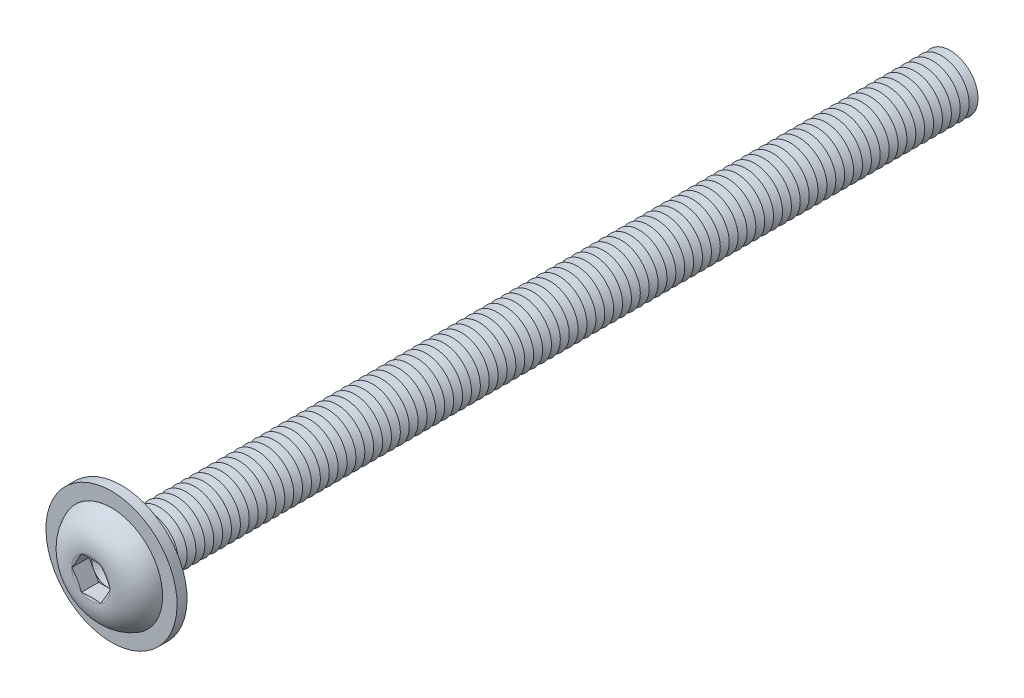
ISO-10303-21;
HEADER;
FILE_DESCRIPTION(('STEP AP214'),'2;1');
FILE_NAME('part.step','',(''),(''),'','','');
FILE_SCHEMA(('AUTOMOTIVE_DESIGN { 1 0 10303 214 1 1 1 1 }'));
ENDSEC;
DATA;
#1=APPLICATION_CONTEXT('core data for automotive mechanical design processes');
#2=APPLICATION_PROTOCOL_DEFINITION('international standard','automotive_design',2000,#1);
#3=PRODUCT_CONTEXT('',#1,'mechanical');
#4=PRODUCT('Part','Part','',(#3));
#5=PRODUCT_RELATED_PRODUCT_CATEGORY('part','',(#4));
#6=PRODUCT_DEFINITION_FORMATION('','',#4);
#7=PRODUCT_DEFINITION_CONTEXT('part definition',#1,'design');
#8=PRODUCT_DEFINITION('design','',#6,#7);
#9=PRODUCT_DEFINITION_SHAPE('','',#8);
#10=(LENGTH_UNIT() NAMED_UNIT(*) SI_UNIT(.MILLI.,.METRE.));
#11=(NAMED_UNIT(*) PLANE_ANGLE_UNIT() SI_UNIT($,.RADIAN.));
#12=(NAMED_UNIT(*) SI_UNIT($,.STERADIAN.) SOLID_ANGLE_UNIT());
#13=UNCERTAINTY_MEASURE_WITH_UNIT(LENGTH_MEASURE(1.E-05),#10,'distance_accuracy_value','');
#14=(GEOMETRIC_REPRESENTATION_CONTEXT(3) GLOBAL_UNCERTAINTY_ASSIGNED_CONTEXT((#13)) GLOBAL_UNIT_ASSIGNED_CONTEXT((#10,
#11,#12)) REPRESENTATION_CONTEXT('',''));
#15=CARTESIAN_POINT('',(0.,0.,0.));
#16=DIRECTION('',(0.,0.,1.));
#17=DIRECTION('',(1.,0.,0.));
#18=AXIS2_PLACEMENT_3D('',#15,#16,#17);
#19=CARTESIAN_POINT('',(0.,0.,-72.2));
#20=DIRECTION('',(0.,0.,1.));
#21=DIRECTION('',(0.,-1.,0.));
#22=AXIS2_PLACEMENT_3D('',#19,#20,#21);
#23=CONICAL_SURFACE('',#22,2.49999999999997,1.0471975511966);
#24=CARTESIAN_POINT('',(0.,0.,-72.6));
#25=DIRECTION('',(0.,0.,1.));
#26=DIRECTION('',(0.,-1.,0.));
#27=AXIS2_PLACEMENT_3D('',#24,#25,#26);
#28=CIRCLE('',#27,1.80717967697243);
#29=CARTESIAN_POINT('',(0.,-1.80717967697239,-72.6));
#30=VERTEX_POINT('',#29);
#31=EDGE_CURVE('E954',#30,#30,#28,.T.);
#32=ORIENTED_EDGE('',*,*,#31,.T.);
#33=EDGE_LOOP('',(#32));
#34=FACE_BOUND('',#33,.T.);
#35=CARTESIAN_POINT('',(0.,0.,-72.2));
#36=DIRECTION('',(0.,0.,1.));
#37=DIRECTION('',(0.,-1.,0.));
#38=AXIS2_PLACEMENT_3D('',#35,#36,#37);
#39=CIRCLE('',#38,2.49999999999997);
#40=CARTESIAN_POINT('',(0.,-2.49999999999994,-72.2));
#41=VERTEX_POINT('',#40);
#42=EDGE_CURVE('E950',#41,#41,#39,.T.);
#43=ORIENTED_EDGE('',*,*,#42,.F.);
#44=EDGE_LOOP('',(#43));
#45=FACE_BOUND('',#44,.T.);
#46=ADVANCED_FACE('F39',(#34,#45),#23,.T.);
#47=CARTESIAN_POINT('',(0.,0.,-72.6));
#48=DIRECTION('',(0.,0.,-1.));
#49=DIRECTION('',(0.,1.,0.));
#50=AXIS2_PLACEMENT_3D('',#47,#48,#49);
#51=CONICAL_SURFACE('',#50,1.80717967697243,1.0471975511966);
#52=CARTESIAN_POINT('',(0.,0.,-73.));
#53=DIRECTION('',(0.,0.,1.));
#54=DIRECTION('',(0.,-1.,0.));
#55=AXIS2_PLACEMENT_3D('',#52,#53,#54);
#56=CIRCLE('',#55,2.49999999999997);
#57=CARTESIAN_POINT('',(0.,-2.49999999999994,-73.));
#58=VERTEX_POINT('',#57);
#59=EDGE_CURVE('E958',#58,#58,#56,.T.);
#60=ORIENTED_EDGE('',*,*,#59,.T.);
#61=EDGE_LOOP('',(#60));
#62=FACE_BOUND('',#61,.T.);
#63=ORIENTED_EDGE('',*,*,#31,.F.);
#64=EDGE_LOOP('',(#63));
#65=FACE_BOUND('',#64,.T.);
#66=ADVANCED_FACE('F1076',(#62,#65),#51,.T.);
#67=CARTESIAN_POINT('',(0.,2.49999999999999,-75.));
#68=DIRECTION('',(0.,0.,-1.));
#69=DIRECTION('',(0.,1.,0.));
#70=AXIS2_PLACEMENT_3D('',#67,#68,#69);
#71=PLANE('',#70);
#72=CARTESIAN_POINT('',(0.,0.,-75.));
#73=DIRECTION('',(0.,0.,1.));
#74=DIRECTION('',(0.,-1.,0.));
#75=AXIS2_PLACEMENT_3D('',#72,#73,#74);
#76=CIRCLE('',#75,1.80717967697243);
#77=CARTESIAN_POINT('',(0.,-1.80717967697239,-75.));
#78=VERTEX_POINT('',#77);
#79=EDGE_CURVE('E977',#78,#78,#76,.T.);
#80=ORIENTED_EDGE('',*,*,#79,.F.);
#81=EDGE_LOOP('',(#80));
#82=FACE_BOUND('',#81,.T.);
#83=ADVANCED_FACE('F1082',(#82),#71,.T.);
#84=CARTESIAN_POINT('',(0.,0.,-74.6));
#85=DIRECTION('',(0.,0.,1.));
#86=DIRECTION('',(0.,-1.,0.));
#87=AXIS2_PLACEMENT_3D('',#84,#85,#86);
#88=CONICAL_SURFACE('',#87,2.49999999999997,1.0471975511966);
#89=ORIENTED_EDGE('',*,*,#79,.T.);
#90=EDGE_LOOP('',(#89));
#91=FACE_BOUND('',#90,.T.);
#92=CARTESIAN_POINT('',(0.,0.,-74.6));
#93=DIRECTION('',(0.,0.,1.));
#94=DIRECTION('',(0.,-1.,0.));
#95=AXIS2_PLACEMENT_3D('',#92,#93,#94);
#96=CIRCLE('',#95,2.49999999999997);
#97=CARTESIAN_POINT('',(0.,-2.49999999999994,-74.6));
#98=VERTEX_POINT('',#97);
#99=EDGE_CURVE('E973',#98,#98,#96,.T.);
#100=ORIENTED_EDGE('',*,*,#99,.F.);
#101=EDGE_LOOP('',(#100));
#102=FACE_BOUND('',#101,.T.);
#103=ADVANCED_FACE('F1101',(#91,#102),#88,.T.);
#104=CARTESIAN_POINT('',(0.,0.,-74.2));
#105=DIRECTION('',(0.,0.,-1.));
#106=DIRECTION('',(0.,1.,0.));
#107=AXIS2_PLACEMENT_3D('',#104,#105,#106);
#108=CONICAL_SURFACE('',#107,1.80717967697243,1.0471975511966);
#109=ORIENTED_EDGE('',*,*,#99,.T.);
#110=EDGE_LOOP('',(#109));
#111=FACE_BOUND('',#110,.T.);
#112=CARTESIAN_POINT('',(0.,0.,-74.2));
#113=DIRECTION('',(0.,0.,1.));
#114=DIRECTION('',(0.,-1.,0.));
#115=AXIS2_PLACEMENT_3D('',#112,#113,#114);
#116=CIRCLE('',#115,1.80717967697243);
#117=CARTESIAN_POINT('',(0.,-1.80717967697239,-74.2));
#118=VERTEX_POINT('',#117);
#119=EDGE_CURVE('E969',#118,#118,#116,.T.);
#120=ORIENTED_EDGE('',*,*,#119,.F.);
#121=EDGE_LOOP('',(#120));
#122=FACE_BOUND('',#121,.T.);
#123=ADVANCED_FACE('F1098',(#111,#122),#108,.T.);
#124=CARTESIAN_POINT('',(0.,0.,-73.8));
#125=DIRECTION('',(0.,0.,1.));
#126=DIRECTION('',(0.,-1.,0.));
#127=AXIS2_PLACEMENT_3D('',#124,#125,#126);
#128=CONICAL_SURFACE('',#127,2.49999999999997,1.0471975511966);
#129=ORIENTED_EDGE('',*,*,#119,.T.);
#130=EDGE_LOOP('',(#129));
#131=FACE_BOUND('',#130,.T.);
#132=CARTESIAN_POINT('',(0.,0.,-73.8));
#133=DIRECTION('',(0.,0.,1.));
#134=DIRECTION('',(0.,-1.,0.));
#135=AXIS2_PLACEMENT_3D('',#132,#133,#134);
#136=CIRCLE('',#135,2.49999999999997);
#137=CARTESIAN_POINT('',(0.,-2.49999999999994,-73.8));
#138=VERTEX_POINT('',#137);
#139=EDGE_CURVE('E966',#138,#138,#136,.T.);
#140=ORIENTED_EDGE('',*,*,#139,.F.);
#141=EDGE_LOOP('',(#140));
#142=FACE_BOUND('',#141,.T.);
#143=ADVANCED_FACE('F1092',(#131,#142),#128,.T.);
#144=CARTESIAN_POINT('',(0.,0.,-73.3999999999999));
#145=DIRECTION('',(0.,0.,-1.));
#146=DIRECTION('',(0.,1.,0.));
#147=AXIS2_PLACEMENT_3D('',#144,#145,#146);
#148=CONICAL_SURFACE('',#147,1.80717967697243,1.0471975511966);
#149=ORIENTED_EDGE('',*,*,#139,.T.);
#150=EDGE_LOOP('',(#149));
#151=FACE_BOUND('',#150,.T.);
#152=CARTESIAN_POINT('',(0.,0.,-73.3999999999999));
#153=DIRECTION('',(0.,0.,1.));
#154=DIRECTION('',(0.,-1.,0.));
#155=AXIS2_PLACEMENT_3D('',#152,#153,#154);
#156=CIRCLE('',#155,1.80717967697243);
#157=CARTESIAN_POINT('',(0.,-1.80717967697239,-73.3999999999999));
#158=VERTEX_POINT('',#157);
#159=EDGE_CURVE('E962',#158,#158,#156,.T.);
#160=ORIENTED_EDGE('',*,*,#159,.F.);
#161=EDGE_LOOP('',(#160));
#162=FACE_BOUND('',#161,.T.);
#163=ADVANCED_FACE('F1088',(#151,#162),#148,.T.);
#164=CARTESIAN_POINT('',(0.,0.,-73.));
#165=DIRECTION('',(0.,0.,1.));
#166=DIRECTION('',(0.,-1.,0.));
#167=AXIS2_PLACEMENT_3D('',#164,#165,#166);
#168=CONICAL_SURFACE('',#167,2.49999999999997,1.0471975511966);
#169=ORIENTED_EDGE('',*,*,#159,.T.);
#170=EDGE_LOOP('',(#169));
#171=FACE_BOUND('',#170,.T.);
#172=ORIENTED_EDGE('',*,*,#59,.F.);
#173=EDGE_LOOP('',(#172));
#174=FACE_BOUND('',#173,.T.);
#175=ADVANCED_FACE('F1091',(#171,#174),#168,.T.);
#176=CARTESIAN_POINT('',(0.,0.,-71.4));
#177=DIRECTION('',(0.,0.,1.));
#178=DIRECTION('',(0.,-1.,0.));
#179=AXIS2_PLACEMENT_3D('',#176,#177,#178);
#180=CONICAL_SURFACE('',#179,2.49999999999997,1.0471975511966);
#181=CARTESIAN_POINT('',(0.,0.,-71.8));
#182=DIRECTION('',(0.,0.,1.));
#183=DIRECTION('',(0.,-1.,0.));
#184=AXIS2_PLACEMENT_3D('',#181,#182,#183);
#185=CIRCLE('',#184,1.80717967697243);
#186=CARTESIAN_POINT('',(0.,-1.80717967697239,-71.8));
#187=VERTEX_POINT('',#186);
#188=EDGE_CURVE('E946',#187,#187,#185,.T.);
#189=ORIENTED_EDGE('',*,*,#188,.T.);
#190=EDGE_LOOP('',(#189));
#191=FACE_BOUND('',#190,.T.);
#192=CARTESIAN_POINT('',(0.,0.,-71.3999999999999));
#193=DIRECTION('',(0.,0.,1.));
#194=DIRECTION('',(0.,-1.,0.));
#195=AXIS2_PLACEMENT_3D('',#192,#193,#194);
#196=CIRCLE('',#195,2.49999999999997);
#197=CARTESIAN_POINT('',(0.,-2.49999999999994,-71.3999999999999));
#198=VERTEX_POINT('',#197);
#199=EDGE_CURVE('E942',#198,#198,#196,.T.);
#200=ORIENTED_EDGE('',*,*,#199,.F.);
#201=EDGE_LOOP('',(#200));
#202=FACE_BOUND('',#201,.T.);
#203=ADVANCED_FACE('F1096',(#191,#202),#180,.T.);
#204=CARTESIAN_POINT('',(0.,0.,-71.8));
#205=DIRECTION('',(0.,0.,-1.));
#206=DIRECTION('',(0.,1.,0.));
#207=AXIS2_PLACEMENT_3D('',#204,#205,#206);
#208=CONICAL_SURFACE('',#207,1.80717967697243,1.0471975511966);
#209=ORIENTED_EDGE('',*,*,#42,.T.);
#210=EDGE_LOOP('',(#209));
#211=FACE_BOUND('',#210,.T.);
#212=ORIENTED_EDGE('',*,*,#188,.F.);
#213=EDGE_LOOP('',(#212));
#214=FACE_BOUND('',#213,.T.);
#215=ADVANCED_FACE('F1147',(#211,#214),#208,.T.);
#216=CARTESIAN_POINT('',(0.,0.,-70.6));
#217=DIRECTION('',(0.,0.,1.));
#218=DIRECTION('',(0.,-1.,0.));
#219=AXIS2_PLACEMENT_3D('',#216,#217,#218);
#220=CONICAL_SURFACE('',#219,2.49999999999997,1.0471975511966);
#221=CARTESIAN_POINT('',(0.,0.,-71.));
#222=DIRECTION('',(0.,0.,1.));
#223=DIRECTION('',(0.,-1.,0.));
#224=AXIS2_PLACEMENT_3D('',#221,#222,#223);
#225=CIRCLE('',#224,1.80717967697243);
#226=CARTESIAN_POINT('',(0.,-1.80717967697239,-71.));
#227=VERTEX_POINT('',#226);
#228=EDGE_CURVE('E938',#227,#227,#225,.T.);
#229=ORIENTED_EDGE('',*,*,#228,.T.);
#230=EDGE_LOOP('',(#229));
#231=FACE_BOUND('',#230,.T.);
#232=CARTESIAN_POINT('',(0.,0.,-70.6));
#233=DIRECTION('',(0.,0.,1.));
#234=DIRECTION('',(0.,-1.,0.));
#235=AXIS2_PLACEMENT_3D('',#232,#233,#234);
#236=CIRCLE('',#235,2.49999999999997);
#237=CARTESIAN_POINT('',(0.,-2.49999999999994,-70.6));
#238=VERTEX_POINT('',#237);
#239=EDGE_CURVE('E934',#238,#238,#236,.T.);
#240=ORIENTED_EDGE('',*,*,#239,.F.);
#241=EDGE_LOOP('',(#240));
#242=FACE_BOUND('',#241,.T.);
#243=ADVANCED_FACE('F1153',(#231,#242),#220,.T.);
#244=CARTESIAN_POINT('',(0.,0.,-71.));
#245=DIRECTION('',(0.,0.,-1.));
#246=DIRECTION('',(0.,1.,0.));
#247=AXIS2_PLACEMENT_3D('',#244,#245,#246);
#248=CONICAL_SURFACE('',#247,1.80717967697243,1.0471975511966);
#249=ORIENTED_EDGE('',*,*,#199,.T.);
#250=EDGE_LOOP('',(#249));
#251=FACE_BOUND('',#250,.T.);
#252=ORIENTED_EDGE('',*,*,#228,.F.);
#253=EDGE_LOOP('',(#252));
#254=FACE_BOUND('',#253,.T.);
#255=ADVANCED_FACE('F1160',(#251,#254),#248,.T.);
#256=CARTESIAN_POINT('',(0.,0.,-69.8));
#257=DIRECTION('',(0.,0.,1.));
#258=DIRECTION('',(0.,-1.,0.));
#259=AXIS2_PLACEMENT_3D('',#256,#257,#258);
#260=CONICAL_SURFACE('',#259,2.49999999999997,1.0471975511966);
#261=CARTESIAN_POINT('',(0.,0.,-70.2));
#262=DIRECTION('',(0.,0.,1.));
#263=DIRECTION('',(0.,-1.,0.));
#264=AXIS2_PLACEMENT_3D('',#261,#262,#263);
#265=CIRCLE('',#264,1.80717967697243);
#266=CARTESIAN_POINT('',(0.,-1.80717967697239,-70.2));
#267=VERTEX_POINT('',#266);
#268=EDGE_CURVE('E930',#267,#267,#265,.T.);
#269=ORIENTED_EDGE('',*,*,#268,.T.);
#270=EDGE_LOOP('',(#269));
#271=FACE_BOUND('',#270,.T.);
#272=CARTESIAN_POINT('',(0.,0.,-69.8));
#273=DIRECTION('',(0.,0.,1.));
#274=DIRECTION('',(0.,-1.,0.));
#275=AXIS2_PLACEMENT_3D('',#272,#273,#274);
#276=CIRCLE('',#275,2.49999999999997);
#277=CARTESIAN_POINT('',(0.,-2.49999999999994,-69.8));
#278=VERTEX_POINT('',#277);
#279=EDGE_CURVE('E926',#278,#278,#276,.T.);
#280=ORIENTED_EDGE('',*,*,#279,.F.);
#281=EDGE_LOOP('',(#280));
#282=FACE_BOUND('',#281,.T.);
#283=ADVANCED_FACE('F1167',(#271,#282),#260,.T.);
#284=CARTESIAN_POINT('',(0.,0.,-70.2));
#285=DIRECTION('',(0.,0.,-1.));
#286=DIRECTION('',(0.,1.,0.));
#287=AXIS2_PLACEMENT_3D('',#284,#285,#286);
#288=CONICAL_SURFACE('',#287,1.80717967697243,1.0471975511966);
#289=ORIENTED_EDGE('',*,*,#239,.T.);
#290=EDGE_LOOP('',(#289));
#291=FACE_BOUND('',#290,.T.);
#292=ORIENTED_EDGE('',*,*,#268,.F.);
#293=EDGE_LOOP('',(#292));
#294=FACE_BOUND('',#293,.T.);
#295=ADVANCED_FACE('F1174',(#291,#294),#288,.T.);
#296=CARTESIAN_POINT('',(0.,0.,-69.));
#297=DIRECTION('',(0.,0.,1.));
#298=DIRECTION('',(0.,-1.,0.));
#299=AXIS2_PLACEMENT_3D('',#296,#297,#298);
#300=CONICAL_SURFACE('',#299,2.49999999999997,1.0471975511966);
#301=CARTESIAN_POINT('',(0.,0.,-69.4));
#302=DIRECTION('',(0.,0.,1.));
#303=DIRECTION('',(0.,-1.,0.));
#304=AXIS2_PLACEMENT_3D('',#301,#302,#303);
#305=CIRCLE('',#304,1.80717967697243);
#306=CARTESIAN_POINT('',(0.,-1.80717967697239,-69.4));
#307=VERTEX_POINT('',#306);
#308=EDGE_CURVE('E922',#307,#307,#305,.T.);
#309=ORIENTED_EDGE('',*,*,#308,.T.);
#310=EDGE_LOOP('',(#309));
#311=FACE_BOUND('',#310,.T.);
#312=CARTESIAN_POINT('',(0.,0.,-68.9999999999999));
#313=DIRECTION('',(0.,0.,1.));
#314=DIRECTION('',(0.,-1.,0.));
#315=AXIS2_PLACEMENT_3D('',#312,#313,#314);
#316=CIRCLE('',#315,2.49999999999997);
#317=CARTESIAN_POINT('',(0.,-2.49999999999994,-68.9999999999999));
#318=VERTEX_POINT('',#317);
#319=EDGE_CURVE('E918',#318,#318,#316,.T.);
#320=ORIENTED_EDGE('',*,*,#319,.F.);
#321=EDGE_LOOP('',(#320));
#322=FACE_BOUND('',#321,.T.);
#323=ADVANCED_FACE('F1181',(#311,#322),#300,.T.);
#324=CARTESIAN_POINT('',(0.,0.,-69.4));
#325=DIRECTION('',(0.,0.,-1.));
#326=DIRECTION('',(0.,1.,0.));
#327=AXIS2_PLACEMENT_3D('',#324,#325,#326);
#328=CONICAL_SURFACE('',#327,1.80717967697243,1.0471975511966);
#329=ORIENTED_EDGE('',*,*,#279,.T.);
#330=EDGE_LOOP('',(#329));
#331=FACE_BOUND('',#330,.T.);
#332=ORIENTED_EDGE('',*,*,#308,.F.);
#333=EDGE_LOOP('',(#332));
#334=FACE_BOUND('',#333,.T.);
#335=ADVANCED_FACE('F1188',(#331,#334),#328,.T.);
#336=CARTESIAN_POINT('',(0.,0.,-68.2));
#337=DIRECTION('',(0.,0.,1.));
#338=DIRECTION('',(0.,-1.,0.));
#339=AXIS2_PLACEMENT_3D('',#336,#337,#338);
#340=CONICAL_SURFACE('',#339,2.49999999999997,1.0471975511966);
#341=CARTESIAN_POINT('',(0.,0.,-68.6));
#342=DIRECTION('',(0.,0.,1.));
#343=DIRECTION('',(0.,-1.,0.));
#344=AXIS2_PLACEMENT_3D('',#341,#342,#343);
#345=CIRCLE('',#344,1.80717967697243);
#346=CARTESIAN_POINT('',(0.,-1.80717967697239,-68.6));
#347=VERTEX_POINT('',#346);
#348=EDGE_CURVE('E914',#347,#347,#345,.T.);
#349=ORIENTED_EDGE('',*,*,#348,.T.);
#350=EDGE_LOOP('',(#349));
#351=FACE_BOUND('',#350,.T.);
#352=CARTESIAN_POINT('',(0.,0.,-68.2));
#353=DIRECTION('',(0.,0.,1.));
#354=DIRECTION('',(0.,-1.,0.));
#355=AXIS2_PLACEMENT_3D('',#352,#353,#354);
#356=CIRCLE('',#355,2.49999999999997);
#357=CARTESIAN_POINT('',(0.,-2.49999999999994,-68.2));
#358=VERTEX_POINT('',#357);
#359=EDGE_CURVE('E910',#358,#358,#356,.T.);
#360=ORIENTED_EDGE('',*,*,#359,.F.);
#361=EDGE_LOOP('',(#360));
#362=FACE_BOUND('',#361,.T.);
#363=ADVANCED_FACE('F1195',(#351,#362),#340,.T.);
#364=CARTESIAN_POINT('',(0.,0.,-68.6));
#365=DIRECTION('',(0.,0.,-1.));
#366=DIRECTION('',(0.,1.,0.));
#367=AXIS2_PLACEMENT_3D('',#364,#365,#366);
#368=CONICAL_SURFACE('',#367,1.80717967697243,1.0471975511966);
#369=ORIENTED_EDGE('',*,*,#319,.T.);
#370=EDGE_LOOP('',(#369));
#371=FACE_BOUND('',#370,.T.);
#372=ORIENTED_EDGE('',*,*,#348,.F.);
#373=EDGE_LOOP('',(#372));
#374=FACE_BOUND('',#373,.T.);
#375=ADVANCED_FACE('F1202',(#371,#374),#368,.T.);
#376=CARTESIAN_POINT('',(0.,0.,-67.4));
#377=DIRECTION('',(0.,0.,1.));
#378=DIRECTION('',(0.,-1.,0.));
#379=AXIS2_PLACEMENT_3D('',#376,#377,#378);
#380=CONICAL_SURFACE('',#379,2.49999999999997,1.0471975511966);
#381=CARTESIAN_POINT('',(0.,0.,-67.8));
#382=DIRECTION('',(0.,0.,1.));
#383=DIRECTION('',(0.,-1.,0.));
#384=AXIS2_PLACEMENT_3D('',#381,#382,#383);
#385=CIRCLE('',#384,1.80717967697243);
#386=CARTESIAN_POINT('',(0.,-1.80717967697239,-67.8));
#387=VERTEX_POINT('',#386);
#388=EDGE_CURVE('E906',#387,#387,#385,.T.);
#389=ORIENTED_EDGE('',*,*,#388,.T.);
#390=EDGE_LOOP('',(#389));
#391=FACE_BOUND('',#390,.T.);
#392=CARTESIAN_POINT('',(0.,0.,-67.4));
#393=DIRECTION('',(0.,0.,1.));
#394=DIRECTION('',(0.,-1.,0.));
#395=AXIS2_PLACEMENT_3D('',#392,#393,#394);
#396=CIRCLE('',#395,2.49999999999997);
#397=CARTESIAN_POINT('',(0.,-2.49999999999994,-67.4));
#398=VERTEX_POINT('',#397);
#399=EDGE_CURVE('E902',#398,#398,#396,.T.);
#400=ORIENTED_EDGE('',*,*,#399,.F.);
#401=EDGE_LOOP('',(#400));
#402=FACE_BOUND('',#401,.T.);
#403=ADVANCED_FACE('F1209',(#391,#402),#380,.T.);
#404=CARTESIAN_POINT('',(0.,0.,-67.8));
#405=DIRECTION('',(0.,0.,-1.));
#406=DIRECTION('',(0.,1.,0.));
#407=AXIS2_PLACEMENT_3D('',#404,#405,#406);
#408=CONICAL_SURFACE('',#407,1.80717967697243,1.0471975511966);
#409=ORIENTED_EDGE('',*,*,#359,.T.);
#410=EDGE_LOOP('',(#409));
#411=FACE_BOUND('',#410,.T.);
#412=ORIENTED_EDGE('',*,*,#388,.F.);
#413=EDGE_LOOP('',(#412));
#414=FACE_BOUND('',#413,.T.);
#415=ADVANCED_FACE('F1216',(#411,#414),#408,.T.);
#416=CARTESIAN_POINT('',(0.,0.,-66.6));
#417=DIRECTION('',(0.,0.,1.));
#418=DIRECTION('',(0.,-1.,0.));
#419=AXIS2_PLACEMENT_3D('',#416,#417,#418);
#420=CONICAL_SURFACE('',#419,2.49999999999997,1.0471975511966);
#421=CARTESIAN_POINT('',(0.,0.,-66.9999999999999));
#422=DIRECTION('',(0.,0.,1.));
#423=DIRECTION('',(0.,-1.,0.));
#424=AXIS2_PLACEMENT_3D('',#421,#422,#423);
#425=CIRCLE('',#424,1.80717967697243);
#426=CARTESIAN_POINT('',(0.,-1.80717967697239,-66.9999999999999));
#427=VERTEX_POINT('',#426);
#428=EDGE_CURVE('E898',#427,#427,#425,.T.);
#429=ORIENTED_EDGE('',*,*,#428,.T.);
#430=EDGE_LOOP('',(#429));
#431=FACE_BOUND('',#430,.T.);
#432=CARTESIAN_POINT('',(0.,0.,-66.6));
#433=DIRECTION('',(0.,0.,1.));
#434=DIRECTION('',(0.,-1.,0.));
#435=AXIS2_PLACEMENT_3D('',#432,#433,#434);
#436=CIRCLE('',#435,2.49999999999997);
#437=CARTESIAN_POINT('',(0.,-2.49999999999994,-66.6));
#438=VERTEX_POINT('',#437);
#439=EDGE_CURVE('E894',#438,#438,#436,.T.);
#440=ORIENTED_EDGE('',*,*,#439,.F.);
#441=EDGE_LOOP('',(#440));
#442=FACE_BOUND('',#441,.T.);
#443=ADVANCED_FACE('F1223',(#431,#442),#420,.T.);
#444=CARTESIAN_POINT('',(0.,0.,-66.9999999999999));
#445=DIRECTION('',(0.,0.,-1.));
#446=DIRECTION('',(0.,1.,0.));
#447=AXIS2_PLACEMENT_3D('',#444,#445,#446);
#448=CONICAL_SURFACE('',#447,1.80717967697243,1.0471975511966);
#449=ORIENTED_EDGE('',*,*,#399,.T.);
#450=EDGE_LOOP('',(#449));
#451=FACE_BOUND('',#450,.T.);
#452=ORIENTED_EDGE('',*,*,#428,.F.);
#453=EDGE_LOOP('',(#452));
#454=FACE_BOUND('',#453,.T.);
#455=ADVANCED_FACE('F1230',(#451,#454),#448,.T.);
#456=CARTESIAN_POINT('',(0.,0.,-65.8));
#457=DIRECTION('',(0.,0.,1.));
#458=DIRECTION('',(0.,-1.,0.));
#459=AXIS2_PLACEMENT_3D('',#456,#457,#458);
#460=CONICAL_SURFACE('',#459,2.49999999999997,1.0471975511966);
#461=CARTESIAN_POINT('',(0.,0.,-66.2));
#462=DIRECTION('',(0.,0.,1.));
#463=DIRECTION('',(0.,-1.,0.));
#464=AXIS2_PLACEMENT_3D('',#461,#462,#463);
#465=CIRCLE('',#464,1.80717967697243);
#466=CARTESIAN_POINT('',(0.,-1.80717967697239,-66.2));
#467=VERTEX_POINT('',#466);
#468=EDGE_CURVE('E890',#467,#467,#465,.T.);
#469=ORIENTED_EDGE('',*,*,#468,.T.);
#470=EDGE_LOOP('',(#469));
#471=FACE_BOUND('',#470,.T.);
#472=CARTESIAN_POINT('',(0.,0.,-65.8));
#473=DIRECTION('',(0.,0.,1.));
#474=DIRECTION('',(0.,-1.,0.));
#475=AXIS2_PLACEMENT_3D('',#472,#473,#474);
#476=CIRCLE('',#475,2.49999999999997);
#477=CARTESIAN_POINT('',(0.,-2.49999999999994,-65.8));
#478=VERTEX_POINT('',#477);
#479=EDGE_CURVE('E886',#478,#478,#476,.T.);
#480=ORIENTED_EDGE('',*,*,#479,.F.);
#481=EDGE_LOOP('',(#480));
#482=FACE_BOUND('',#481,.T.);
#483=ADVANCED_FACE('F1237',(#471,#482),#460,.T.);
#484=CARTESIAN_POINT('',(0.,0.,-66.2));
#485=DIRECTION('',(0.,0.,-1.));
#486=DIRECTION('',(0.,1.,0.));
#487=AXIS2_PLACEMENT_3D('',#484,#485,#486);
#488=CONICAL_SURFACE('',#487,1.80717967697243,1.0471975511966);
#489=ORIENTED_EDGE('',*,*,#439,.T.);
#490=EDGE_LOOP('',(#489));
#491=FACE_BOUND('',#490,.T.);
#492=ORIENTED_EDGE('',*,*,#468,.F.);
#493=EDGE_LOOP('',(#492));
#494=FACE_BOUND('',#493,.T.);
#495=ADVANCED_FACE('F1244',(#491,#494),#488,.T.);
#496=CARTESIAN_POINT('',(0.,0.,-65.));
#497=DIRECTION('',(0.,0.,1.));
#498=DIRECTION('',(0.,-1.,0.));
#499=AXIS2_PLACEMENT_3D('',#496,#497,#498);
#500=CONICAL_SURFACE('',#499,2.49999999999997,1.0471975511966);
#501=CARTESIAN_POINT('',(0.,0.,-65.4));
#502=DIRECTION('',(0.,0.,1.));
#503=DIRECTION('',(0.,-1.,0.));
#504=AXIS2_PLACEMENT_3D('',#501,#502,#503);
#505=CIRCLE('',#504,1.80717967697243);
#506=CARTESIAN_POINT('',(0.,-1.80717967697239,-65.4));
#507=VERTEX_POINT('',#506);
#508=EDGE_CURVE('E882',#507,#507,#505,.T.);
#509=ORIENTED_EDGE('',*,*,#508,.T.);
#510=EDGE_LOOP('',(#509));
#511=FACE_BOUND('',#510,.T.);
#512=CARTESIAN_POINT('',(0.,0.,-64.9999999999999));
#513=DIRECTION('',(0.,0.,1.));
#514=DIRECTION('',(0.,-1.,0.));
#515=AXIS2_PLACEMENT_3D('',#512,#513,#514);
#516=CIRCLE('',#515,2.49999999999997);
#517=CARTESIAN_POINT('',(0.,-2.49999999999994,-64.9999999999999));
#518=VERTEX_POINT('',#517);
#519=EDGE_CURVE('E878',#518,#518,#516,.T.);
#520=ORIENTED_EDGE('',*,*,#519,.F.);
#521=EDGE_LOOP('',(#520));
#522=FACE_BOUND('',#521,.T.);
#523=ADVANCED_FACE('F1251',(#511,#522),#500,.T.);
#524=CARTESIAN_POINT('',(0.,0.,-65.4));
#525=DIRECTION('',(0.,0.,-1.));
#526=DIRECTION('',(0.,1.,0.));
#527=AXIS2_PLACEMENT_3D('',#524,#525,#526);
#528=CONICAL_SURFACE('',#527,1.80717967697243,1.0471975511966);
#529=ORIENTED_EDGE('',*,*,#479,.T.);
#530=EDGE_LOOP('',(#529));
#531=FACE_BOUND('',#530,.T.);
#532=ORIENTED_EDGE('',*,*,#508,.F.);
#533=EDGE_LOOP('',(#532));
#534=FACE_BOUND('',#533,.T.);
#535=ADVANCED_FACE('F1258',(#531,#534),#528,.T.);
#536=CARTESIAN_POINT('',(0.,0.,-64.1999999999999));
#537=DIRECTION('',(0.,0.,1.));
#538=DIRECTION('',(0.,-1.,0.));
#539=AXIS2_PLACEMENT_3D('',#536,#537,#538);
#540=CONICAL_SURFACE('',#539,2.49999999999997,1.0471975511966);
#541=CARTESIAN_POINT('',(0.,0.,-64.6));
#542=DIRECTION('',(0.,0.,1.));
#543=DIRECTION('',(0.,-1.,0.));
#544=AXIS2_PLACEMENT_3D('',#541,#542,#543);
#545=CIRCLE('',#544,1.80717967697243);
#546=CARTESIAN_POINT('',(0.,-1.8071796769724,-64.6));
#547=VERTEX_POINT('',#546);
#548=EDGE_CURVE('E874',#547,#547,#545,.T.);
#549=ORIENTED_EDGE('',*,*,#548,.T.);
#550=EDGE_LOOP('',(#549));
#551=FACE_BOUND('',#550,.T.);
#552=CARTESIAN_POINT('',(0.,0.,-64.1999999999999));
#553=DIRECTION('',(0.,0.,1.));
#554=DIRECTION('',(0.,-1.,0.));
#555=AXIS2_PLACEMENT_3D('',#552,#553,#554);
#556=CIRCLE('',#555,2.49999999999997);
#557=CARTESIAN_POINT('',(0.,-2.49999999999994,-64.1999999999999));
#558=VERTEX_POINT('',#557);
#559=EDGE_CURVE('E870',#558,#558,#556,.T.);
#560=ORIENTED_EDGE('',*,*,#559,.F.);
#561=EDGE_LOOP('',(#560));
#562=FACE_BOUND('',#561,.T.);
#563=ADVANCED_FACE('F1265',(#551,#562),#540,.T.);
#564=CARTESIAN_POINT('',(0.,0.,-64.6));
#565=DIRECTION('',(0.,0.,-1.));
#566=DIRECTION('',(0.,1.,0.));
#567=AXIS2_PLACEMENT_3D('',#564,#565,#566);
#568=CONICAL_SURFACE('',#567,1.80717967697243,1.0471975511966);
#569=ORIENTED_EDGE('',*,*,#519,.T.);
#570=EDGE_LOOP('',(#569));
#571=FACE_BOUND('',#570,.T.);
#572=ORIENTED_EDGE('',*,*,#548,.F.);
#573=EDGE_LOOP('',(#572));
#574=FACE_BOUND('',#573,.T.);
#575=ADVANCED_FACE('F1272',(#571,#574),#568,.T.);
#576=CARTESIAN_POINT('',(0.,0.,-63.4));
#577=DIRECTION('',(0.,0.,1.));
#578=DIRECTION('',(0.,-1.,0.));
#579=AXIS2_PLACEMENT_3D('',#576,#577,#578);
#580=CONICAL_SURFACE('',#579,2.49999999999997,1.0471975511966);
#581=CARTESIAN_POINT('',(0.,0.,-63.8));
#582=DIRECTION('',(0.,0.,1.));
#583=DIRECTION('',(0.,-1.,0.));
#584=AXIS2_PLACEMENT_3D('',#581,#582,#583);
#585=CIRCLE('',#584,1.80717967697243);
#586=CARTESIAN_POINT('',(0.,-1.8071796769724,-63.8));
#587=VERTEX_POINT('',#586);
#588=EDGE_CURVE('E866',#587,#587,#585,.T.);
#589=ORIENTED_EDGE('',*,*,#588,.T.);
#590=EDGE_LOOP('',(#589));
#591=FACE_BOUND('',#590,.T.);
#592=CARTESIAN_POINT('',(0.,0.,-63.4));
#593=DIRECTION('',(0.,0.,1.));
#594=DIRECTION('',(0.,-1.,0.));
#595=AXIS2_PLACEMENT_3D('',#592,#593,#594);
#596=CIRCLE('',#595,2.49999999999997);
#597=CARTESIAN_POINT('',(0.,-2.49999999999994,-63.4));
#598=VERTEX_POINT('',#597);
#599=EDGE_CURVE('E862',#598,#598,#596,.T.);
#600=ORIENTED_EDGE('',*,*,#599,.F.);
#601=EDGE_LOOP('',(#600));
#602=FACE_BOUND('',#601,.T.);
#603=ADVANCED_FACE('F1279',(#591,#602),#580,.T.);
#604=CARTESIAN_POINT('',(0.,0.,-63.8));
#605=DIRECTION('',(0.,0.,-1.));
#606=DIRECTION('',(0.,1.,0.));
#607=AXIS2_PLACEMENT_3D('',#604,#605,#606);
#608=CONICAL_SURFACE('',#607,1.80717967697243,1.0471975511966);
#609=ORIENTED_EDGE('',*,*,#559,.T.);
#610=EDGE_LOOP('',(#609));
#611=FACE_BOUND('',#610,.T.);
#612=ORIENTED_EDGE('',*,*,#588,.F.);
#613=EDGE_LOOP('',(#612));
#614=FACE_BOUND('',#613,.T.);
#615=ADVANCED_FACE('F1286',(#611,#614),#608,.T.);
#616=CARTESIAN_POINT('',(0.,0.,-62.6));
#617=DIRECTION('',(0.,0.,1.));
#618=DIRECTION('',(0.,-1.,0.));
#619=AXIS2_PLACEMENT_3D('',#616,#617,#618);
#620=CONICAL_SURFACE('',#619,2.49999999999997,1.0471975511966);
#621=CARTESIAN_POINT('',(0.,0.,-63.));
#622=DIRECTION('',(0.,0.,1.));
#623=DIRECTION('',(0.,-1.,0.));
#624=AXIS2_PLACEMENT_3D('',#621,#622,#623);
#625=CIRCLE('',#624,1.80717967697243);
#626=CARTESIAN_POINT('',(0.,-1.8071796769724,-63.));
#627=VERTEX_POINT('',#626);
#628=EDGE_CURVE('E858',#627,#627,#625,.T.);
#629=ORIENTED_EDGE('',*,*,#628,.T.);
#630=EDGE_LOOP('',(#629));
#631=FACE_BOUND('',#630,.T.);
#632=CARTESIAN_POINT('',(0.,0.,-62.5999999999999));
#633=DIRECTION('',(0.,0.,1.));
#634=DIRECTION('',(0.,-1.,0.));
#635=AXIS2_PLACEMENT_3D('',#632,#633,#634);
#636=CIRCLE('',#635,2.49999999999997);
#637=CARTESIAN_POINT('',(0.,-2.49999999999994,-62.5999999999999));
#638=VERTEX_POINT('',#637);
#639=EDGE_CURVE('E854',#638,#638,#636,.T.);
#640=ORIENTED_EDGE('',*,*,#639,.F.);
#641=EDGE_LOOP('',(#640));
#642=FACE_BOUND('',#641,.T.);
#643=ADVANCED_FACE('F1293',(#631,#642),#620,.T.);
#644=CARTESIAN_POINT('',(0.,0.,-63.));
#645=DIRECTION('',(0.,0.,-1.));
#646=DIRECTION('',(0.,1.,0.));
#647=AXIS2_PLACEMENT_3D('',#644,#645,#646);
#648=CONICAL_SURFACE('',#647,1.80717967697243,1.0471975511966);
#649=ORIENTED_EDGE('',*,*,#599,.T.);
#650=EDGE_LOOP('',(#649));
#651=FACE_BOUND('',#650,.T.);
#652=ORIENTED_EDGE('',*,*,#628,.F.);
#653=EDGE_LOOP('',(#652));
#654=FACE_BOUND('',#653,.T.);
#655=ADVANCED_FACE('F1300',(#651,#654),#648,.T.);
#656=CARTESIAN_POINT('',(0.,0.,-61.8));
#657=DIRECTION('',(0.,0.,1.));
#658=DIRECTION('',(0.,-1.,0.));
#659=AXIS2_PLACEMENT_3D('',#656,#657,#658);
#660=CONICAL_SURFACE('',#659,2.49999999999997,1.0471975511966);
#661=CARTESIAN_POINT('',(0.,0.,-62.2));
#662=DIRECTION('',(0.,0.,1.));
#663=DIRECTION('',(0.,-1.,0.));
#664=AXIS2_PLACEMENT_3D('',#661,#662,#663);
#665=CIRCLE('',#664,1.80717967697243);
#666=CARTESIAN_POINT('',(0.,-1.8071796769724,-62.2));
#667=VERTEX_POINT('',#666);
#668=EDGE_CURVE('E850',#667,#667,#665,.T.);
#669=ORIENTED_EDGE('',*,*,#668,.T.);
#670=EDGE_LOOP('',(#669));
#671=FACE_BOUND('',#670,.T.);
#672=CARTESIAN_POINT('',(0.,0.,-61.8));
#673=DIRECTION('',(0.,0.,1.));
#674=DIRECTION('',(0.,-1.,0.));
#675=AXIS2_PLACEMENT_3D('',#672,#673,#674);
#676=CIRCLE('',#675,2.49999999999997);
#677=CARTESIAN_POINT('',(0.,-2.49999999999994,-61.8));
#678=VERTEX_POINT('',#677);
#679=EDGE_CURVE('E846',#678,#678,#676,.T.);
#680=ORIENTED_EDGE('',*,*,#679,.F.);
#681=EDGE_LOOP('',(#680));
#682=FACE_BOUND('',#681,.T.);
#683=ADVANCED_FACE('F1307',(#671,#682),#660,.T.);
#684=CARTESIAN_POINT('',(0.,0.,-62.2));
#685=DIRECTION('',(0.,0.,-1.));
#686=DIRECTION('',(0.,1.,0.));
#687=AXIS2_PLACEMENT_3D('',#684,#685,#686);
#688=CONICAL_SURFACE('',#687,1.80717967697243,1.0471975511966);
#689=ORIENTED_EDGE('',*,*,#639,.T.);
#690=EDGE_LOOP('',(#689));
#691=FACE_BOUND('',#690,.T.);
#692=ORIENTED_EDGE('',*,*,#668,.F.);
#693=EDGE_LOOP('',(#692));
#694=FACE_BOUND('',#693,.T.);
#695=ADVANCED_FACE('F1314',(#691,#694),#688,.T.);
#696=CARTESIAN_POINT('',(0.,0.,-61.));
#697=DIRECTION('',(0.,0.,1.));
#698=DIRECTION('',(0.,-1.,0.));
#699=AXIS2_PLACEMENT_3D('',#696,#697,#698);
#700=CONICAL_SURFACE('',#699,2.49999999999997,1.0471975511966);
#701=CARTESIAN_POINT('',(0.,0.,-61.4));
#702=DIRECTION('',(0.,0.,1.));
#703=DIRECTION('',(0.,-1.,0.));
#704=AXIS2_PLACEMENT_3D('',#701,#702,#703);
#705=CIRCLE('',#704,1.80717967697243);
#706=CARTESIAN_POINT('',(0.,-1.8071796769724,-61.4));
#707=VERTEX_POINT('',#706);
#708=EDGE_CURVE('E842',#707,#707,#705,.T.);
#709=ORIENTED_EDGE('',*,*,#708,.T.);
#710=EDGE_LOOP('',(#709));
#711=FACE_BOUND('',#710,.T.);
#712=CARTESIAN_POINT('',(0.,0.,-61.));
#713=DIRECTION('',(0.,0.,1.));
#714=DIRECTION('',(0.,-1.,0.));
#715=AXIS2_PLACEMENT_3D('',#712,#713,#714);
#716=CIRCLE('',#715,2.49999999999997);
#717=CARTESIAN_POINT('',(0.,-2.49999999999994,-61.));
#718=VERTEX_POINT('',#717);
#719=EDGE_CURVE('E838',#718,#718,#716,.T.);
#720=ORIENTED_EDGE('',*,*,#719,.F.);
#721=EDGE_LOOP('',(#720));
#722=FACE_BOUND('',#721,.T.);
#723=ADVANCED_FACE('F1321',(#711,#722),#700,.T.);
#724=CARTESIAN_POINT('',(0.,0.,-61.4));
#725=DIRECTION('',(0.,0.,-1.));
#726=DIRECTION('',(0.,1.,0.));
#727=AXIS2_PLACEMENT_3D('',#724,#725,#726);
#728=CONICAL_SURFACE('',#727,1.80717967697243,1.0471975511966);
#729=ORIENTED_EDGE('',*,*,#679,.T.);
#730=EDGE_LOOP('',(#729));
#731=FACE_BOUND('',#730,.T.);
#732=ORIENTED_EDGE('',*,*,#708,.F.);
#733=EDGE_LOOP('',(#732));
#734=FACE_BOUND('',#733,.T.);
#735=ADVANCED_FACE('F1328',(#731,#734),#728,.T.);
#736=CARTESIAN_POINT('',(0.,0.,-60.2));
#737=DIRECTION('',(0.,0.,1.));
#738=DIRECTION('',(0.,-1.,0.));
#739=AXIS2_PLACEMENT_3D('',#736,#737,#738);
#740=CONICAL_SURFACE('',#739,2.49999999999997,1.0471975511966);
#741=CARTESIAN_POINT('',(0.,0.,-60.6));
#742=DIRECTION('',(0.,0.,1.));
#743=DIRECTION('',(0.,-1.,0.));
#744=AXIS2_PLACEMENT_3D('',#741,#742,#743);
#745=CIRCLE('',#744,1.80717967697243);
#746=CARTESIAN_POINT('',(0.,-1.8071796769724,-60.6));
#747=VERTEX_POINT('',#746);
#748=EDGE_CURVE('E834',#747,#747,#745,.T.);
#749=ORIENTED_EDGE('',*,*,#748,.T.);
#750=EDGE_LOOP('',(#749));
#751=FACE_BOUND('',#750,.T.);
#752=CARTESIAN_POINT('',(0.,0.,-60.2));
#753=DIRECTION('',(0.,0.,1.));
#754=DIRECTION('',(0.,-1.,0.));
#755=AXIS2_PLACEMENT_3D('',#752,#753,#754);
#756=CIRCLE('',#755,2.49999999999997);
#757=CARTESIAN_POINT('',(0.,-2.49999999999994,-60.2));
#758=VERTEX_POINT('',#757);
#759=EDGE_CURVE('E830',#758,#758,#756,.T.);
#760=ORIENTED_EDGE('',*,*,#759,.F.);
#761=EDGE_LOOP('',(#760));
#762=FACE_BOUND('',#761,.T.);
#763=ADVANCED_FACE('F1335',(#751,#762),#740,.T.);
#764=CARTESIAN_POINT('',(0.,0.,-60.6));
#765=DIRECTION('',(0.,0.,-1.));
#766=DIRECTION('',(0.,1.,0.));
#767=AXIS2_PLACEMENT_3D('',#764,#765,#766);
#768=CONICAL_SURFACE('',#767,1.80717967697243,1.0471975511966);
#769=ORIENTED_EDGE('',*,*,#719,.T.);
#770=EDGE_LOOP('',(#769));
#771=FACE_BOUND('',#770,.T.);
#772=ORIENTED_EDGE('',*,*,#748,.F.);
#773=EDGE_LOOP('',(#772));
#774=FACE_BOUND('',#773,.T.);
#775=ADVANCED_FACE('F1342',(#771,#774),#768,.T.);
#776=CARTESIAN_POINT('',(0.,0.,-59.4));
#777=DIRECTION('',(0.,0.,1.));
#778=DIRECTION('',(0.,-1.,0.));
#779=AXIS2_PLACEMENT_3D('',#776,#777,#778);
#780=CONICAL_SURFACE('',#779,2.49999999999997,1.0471975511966);
#781=CARTESIAN_POINT('',(0.,0.,-59.8));
#782=DIRECTION('',(0.,0.,1.));
#783=DIRECTION('',(0.,-1.,0.));
#784=AXIS2_PLACEMENT_3D('',#781,#782,#783);
#785=CIRCLE('',#784,1.80717967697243);
#786=CARTESIAN_POINT('',(0.,-1.8071796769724,-59.8));
#787=VERTEX_POINT('',#786);
#788=EDGE_CURVE('E826',#787,#787,#785,.T.);
#789=ORIENTED_EDGE('',*,*,#788,.T.);
#790=EDGE_LOOP('',(#789));
#791=FACE_BOUND('',#790,.T.);
#792=CARTESIAN_POINT('',(0.,0.,-59.4));
#793=DIRECTION('',(0.,0.,1.));
#794=DIRECTION('',(0.,-1.,0.));
#795=AXIS2_PLACEMENT_3D('',#792,#793,#794);
#796=CIRCLE('',#795,2.49999999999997);
#797=CARTESIAN_POINT('',(0.,-2.49999999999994,-59.4));
#798=VERTEX_POINT('',#797);
#799=EDGE_CURVE('E822',#798,#798,#796,.T.);
#800=ORIENTED_EDGE('',*,*,#799,.F.);
#801=EDGE_LOOP('',(#800));
#802=FACE_BOUND('',#801,.T.);
#803=ADVANCED_FACE('F1349',(#791,#802),#780,.T.);
#804=CARTESIAN_POINT('',(0.,0.,-59.8));
#805=DIRECTION('',(0.,0.,-1.));
#806=DIRECTION('',(0.,1.,0.));
#807=AXIS2_PLACEMENT_3D('',#804,#805,#806);
#808=CONICAL_SURFACE('',#807,1.80717967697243,1.0471975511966);
#809=ORIENTED_EDGE('',*,*,#759,.T.);
#810=EDGE_LOOP('',(#809));
#811=FACE_BOUND('',#810,.T.);
#812=ORIENTED_EDGE('',*,*,#788,.F.);
#813=EDGE_LOOP('',(#812));
#814=FACE_BOUND('',#813,.T.);
#815=ADVANCED_FACE('F1356',(#811,#814),#808,.T.);
#816=CARTESIAN_POINT('',(0.,0.,-58.6));
#817=DIRECTION('',(0.,0.,1.));
#818=DIRECTION('',(0.,-1.,0.));
#819=AXIS2_PLACEMENT_3D('',#816,#817,#818);
#820=CONICAL_SURFACE('',#819,2.49999999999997,1.0471975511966);
#821=CARTESIAN_POINT('',(0.,0.,-59.));
#822=DIRECTION('',(0.,0.,1.));
#823=DIRECTION('',(0.,-1.,0.));
#824=AXIS2_PLACEMENT_3D('',#821,#822,#823);
#825=CIRCLE('',#824,1.80717967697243);
#826=CARTESIAN_POINT('',(0.,-1.8071796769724,-59.));
#827=VERTEX_POINT('',#826);
#828=EDGE_CURVE('E818',#827,#827,#825,.T.);
#829=ORIENTED_EDGE('',*,*,#828,.T.);
#830=EDGE_LOOP('',(#829));
#831=FACE_BOUND('',#830,.T.);
#832=CARTESIAN_POINT('',(0.,0.,-58.6));
#833=DIRECTION('',(0.,0.,1.));
#834=DIRECTION('',(0.,-1.,0.));
#835=AXIS2_PLACEMENT_3D('',#832,#833,#834);
#836=CIRCLE('',#835,2.49999999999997);
#837=CARTESIAN_POINT('',(0.,-2.49999999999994,-58.6));
#838=VERTEX_POINT('',#837);
#839=EDGE_CURVE('E814',#838,#838,#836,.T.);
#840=ORIENTED_EDGE('',*,*,#839,.F.);
#841=EDGE_LOOP('',(#840));
#842=FACE_BOUND('',#841,.T.);
#843=ADVANCED_FACE('F1363',(#831,#842),#820,.T.);
#844=CARTESIAN_POINT('',(0.,0.,-59.));
#845=DIRECTION('',(0.,0.,-1.));
#846=DIRECTION('',(0.,1.,0.));
#847=AXIS2_PLACEMENT_3D('',#844,#845,#846);
#848=CONICAL_SURFACE('',#847,1.80717967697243,1.0471975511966);
#849=ORIENTED_EDGE('',*,*,#799,.T.);
#850=EDGE_LOOP('',(#849));
#851=FACE_BOUND('',#850,.T.);
#852=ORIENTED_EDGE('',*,*,#828,.F.);
#853=EDGE_LOOP('',(#852));
#854=FACE_BOUND('',#853,.T.);
#855=ADVANCED_FACE('F1370',(#851,#854),#848,.T.);
#856=CARTESIAN_POINT('',(0.,0.,-57.8));
#857=DIRECTION('',(0.,0.,1.));
#858=DIRECTION('',(0.,-1.,0.));
#859=AXIS2_PLACEMENT_3D('',#856,#857,#858);
#860=CONICAL_SURFACE('',#859,2.49999999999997,1.0471975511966);
#861=CARTESIAN_POINT('',(0.,0.,-58.2));
#862=DIRECTION('',(0.,0.,1.));
#863=DIRECTION('',(0.,-1.,0.));
#864=AXIS2_PLACEMENT_3D('',#861,#862,#863);
#865=CIRCLE('',#864,1.80717967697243);
#866=CARTESIAN_POINT('',(0.,-1.8071796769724,-58.2));
#867=VERTEX_POINT('',#866);
#868=EDGE_CURVE('E810',#867,#867,#865,.T.);
#869=ORIENTED_EDGE('',*,*,#868,.T.);
#870=EDGE_LOOP('',(#869));
#871=FACE_BOUND('',#870,.T.);
#872=CARTESIAN_POINT('',(0.,0.,-57.7999999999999));
#873=DIRECTION('',(0.,0.,1.));
#874=DIRECTION('',(0.,-1.,0.));
#875=AXIS2_PLACEMENT_3D('',#872,#873,#874);
#876=CIRCLE('',#875,2.49999999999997);
#877=CARTESIAN_POINT('',(0.,-2.49999999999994,-57.7999999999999));
#878=VERTEX_POINT('',#877);
#879=EDGE_CURVE('E806',#878,#878,#876,.T.);
#880=ORIENTED_EDGE('',*,*,#879,.F.);
#881=EDGE_LOOP('',(#880));
#882=FACE_BOUND('',#881,.T.);
#883=ADVANCED_FACE('F1377',(#871,#882),#860,.T.);
#884=CARTESIAN_POINT('',(0.,0.,-58.2));
#885=DIRECTION('',(0.,0.,-1.));
#886=DIRECTION('',(0.,1.,0.));
#887=AXIS2_PLACEMENT_3D('',#884,#885,#886);
#888=CONICAL_SURFACE('',#887,1.80717967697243,1.0471975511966);
#889=ORIENTED_EDGE('',*,*,#839,.T.);
#890=EDGE_LOOP('',(#889));
#891=FACE_BOUND('',#890,.T.);
#892=ORIENTED_EDGE('',*,*,#868,.F.);
#893=EDGE_LOOP('',(#892));
#894=FACE_BOUND('',#893,.T.);
#895=ADVANCED_FACE('F1384',(#891,#894),#888,.T.);
#896=CARTESIAN_POINT('',(0.,0.,-57.));
#897=DIRECTION('',(0.,0.,1.));
#898=DIRECTION('',(0.,-1.,0.));
#899=AXIS2_PLACEMENT_3D('',#896,#897,#898);
#900=CONICAL_SURFACE('',#899,2.49999999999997,1.0471975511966);
#901=CARTESIAN_POINT('',(0.,0.,-57.3999999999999));
#902=DIRECTION('',(0.,0.,1.));
#903=DIRECTION('',(0.,-1.,0.));
#904=AXIS2_PLACEMENT_3D('',#901,#902,#903);
#905=CIRCLE('',#904,1.80717967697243);
#906=CARTESIAN_POINT('',(0.,-1.8071796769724,-57.3999999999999));
#907=VERTEX_POINT('',#906);
#908=EDGE_CURVE('E802',#907,#907,#905,.T.);
#909=ORIENTED_EDGE('',*,*,#908,.T.);
#910=EDGE_LOOP('',(#909));
#911=FACE_BOUND('',#910,.T.);
#912=CARTESIAN_POINT('',(0.,0.,-57.));
#913=DIRECTION('',(0.,0.,1.));
#914=DIRECTION('',(0.,-1.,0.));
#915=AXIS2_PLACEMENT_3D('',#912,#913,#914);
#916=CIRCLE('',#915,2.49999999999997);
#917=CARTESIAN_POINT('',(0.,-2.49999999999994,-57.));
#918=VERTEX_POINT('',#917);
#919=EDGE_CURVE('E798',#918,#918,#916,.T.);
#920=ORIENTED_EDGE('',*,*,#919,.F.);
#921=EDGE_LOOP('',(#920));
#922=FACE_BOUND('',#921,.T.);
#923=ADVANCED_FACE('F1391',(#911,#922),#900,.T.);
#924=CARTESIAN_POINT('',(0.,0.,-57.3999999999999));
#925=DIRECTION('',(0.,0.,-1.));
#926=DIRECTION('',(0.,1.,0.));
#927=AXIS2_PLACEMENT_3D('',#924,#925,#926);
#928=CONICAL_SURFACE('',#927,1.80717967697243,1.0471975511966);
#929=ORIENTED_EDGE('',*,*,#879,.T.);
#930=EDGE_LOOP('',(#929));
#931=FACE_BOUND('',#930,.T.);
#932=ORIENTED_EDGE('',*,*,#908,.F.);
#933=EDGE_LOOP('',(#932));
#934=FACE_BOUND('',#933,.T.);
#935=ADVANCED_FACE('F1398',(#931,#934),#928,.T.);
#936=CARTESIAN_POINT('',(0.,0.,-56.2));
#937=DIRECTION('',(0.,0.,1.));
#938=DIRECTION('',(0.,-1.,0.));
#939=AXIS2_PLACEMENT_3D('',#936,#937,#938);
#940=CONICAL_SURFACE('',#939,2.49999999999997,1.0471975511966);
#941=CARTESIAN_POINT('',(0.,0.,-56.6));
#942=DIRECTION('',(0.,0.,1.));
#943=DIRECTION('',(0.,-1.,0.));
#944=AXIS2_PLACEMENT_3D('',#941,#942,#943);
#945=CIRCLE('',#944,1.80717967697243);
#946=CARTESIAN_POINT('',(0.,-1.8071796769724,-56.6));
#947=VERTEX_POINT('',#946);
#948=EDGE_CURVE('E794',#947,#947,#945,.T.);
#949=ORIENTED_EDGE('',*,*,#948,.T.);
#950=EDGE_LOOP('',(#949));
#951=FACE_BOUND('',#950,.T.);
#952=CARTESIAN_POINT('',(0.,0.,-56.2));
#953=DIRECTION('',(0.,0.,1.));
#954=DIRECTION('',(0.,-1.,0.));
#955=AXIS2_PLACEMENT_3D('',#952,#953,#954);
#956=CIRCLE('',#955,2.49999999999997);
#957=CARTESIAN_POINT('',(0.,-2.49999999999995,-56.2));
#958=VERTEX_POINT('',#957);
#959=EDGE_CURVE('E790',#958,#958,#956,.T.);
#960=ORIENTED_EDGE('',*,*,#959,.F.);
#961=EDGE_LOOP('',(#960));
#962=FACE_BOUND('',#961,.T.);
#963=ADVANCED_FACE('F1405',(#951,#962),#940,.T.);
#964=CARTESIAN_POINT('',(0.,0.,-56.6));
#965=DIRECTION('',(0.,0.,-1.));
#966=DIRECTION('',(0.,1.,0.));
#967=AXIS2_PLACEMENT_3D('',#964,#965,#966);
#968=CONICAL_SURFACE('',#967,1.80717967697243,1.0471975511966);
#969=ORIENTED_EDGE('',*,*,#919,.T.);
#970=EDGE_LOOP('',(#969));
#971=FACE_BOUND('',#970,.T.);
#972=ORIENTED_EDGE('',*,*,#948,.F.);
#973=EDGE_LOOP('',(#972));
#974=FACE_BOUND('',#973,.T.);
#975=ADVANCED_FACE('F1412',(#971,#974),#968,.T.);
#976=CARTESIAN_POINT('',(0.,0.,-55.4));
#977=DIRECTION('',(0.,0.,1.));
#978=DIRECTION('',(0.,-1.,0.));
#979=AXIS2_PLACEMENT_3D('',#976,#977,#978);
#980=CONICAL_SURFACE('',#979,2.49999999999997,1.0471975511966);
#981=CARTESIAN_POINT('',(0.,0.,-55.8));
#982=DIRECTION('',(0.,0.,1.));
#983=DIRECTION('',(0.,-1.,0.));
#984=AXIS2_PLACEMENT_3D('',#981,#982,#983);
#985=CIRCLE('',#984,1.80717967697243);
#986=CARTESIAN_POINT('',(0.,-1.8071796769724,-55.8));
#987=VERTEX_POINT('',#986);
#988=EDGE_CURVE('E786',#987,#987,#985,.T.);
#989=ORIENTED_EDGE('',*,*,#988,.T.);
#990=EDGE_LOOP('',(#989));
#991=FACE_BOUND('',#990,.T.);
#992=CARTESIAN_POINT('',(0.,0.,-55.3999999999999));
#993=DIRECTION('',(0.,0.,1.));
#994=DIRECTION('',(0.,-1.,0.));
#995=AXIS2_PLACEMENT_3D('',#992,#993,#994);
#996=CIRCLE('',#995,2.49999999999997);
#997=CARTESIAN_POINT('',(0.,-2.49999999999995,-55.3999999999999));
#998=VERTEX_POINT('',#997);
#999=EDGE_CURVE('E782',#998,#998,#996,.T.);
#1000=ORIENTED_EDGE('',*,*,#999,.F.);
#1001=EDGE_LOOP('',(#1000));
#1002=FACE_BOUND('',#1001,.T.);
#1003=ADVANCED_FACE('F1419',(#991,#1002),#980,.T.);
#1004=CARTESIAN_POINT('',(0.,0.,-55.8));
#1005=DIRECTION('',(0.,0.,-1.));
#1006=DIRECTION('',(0.,1.,0.));
#1007=AXIS2_PLACEMENT_3D('',#1004,#1005,#1006);
#1008=CONICAL_SURFACE('',#1007,1.80717967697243,1.0471975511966);
#1009=ORIENTED_EDGE('',*,*,#959,.T.);
#1010=EDGE_LOOP('',(#1009));
#1011=FACE_BOUND('',#1010,.T.);
#1012=ORIENTED_EDGE('',*,*,#988,.F.);
#1013=EDGE_LOOP('',(#1012));
#1014=FACE_BOUND('',#1013,.T.);
#1015=ADVANCED_FACE('F1426',(#1011,#1014),#1008,.T.);
#1016=CARTESIAN_POINT('',(0.,0.,-54.6));
#1017=DIRECTION('',(0.,0.,1.));
#1018=DIRECTION('',(0.,-1.,0.));
#1019=AXIS2_PLACEMENT_3D('',#1016,#1017,#1018);
#1020=CONICAL_SURFACE('',#1019,2.49999999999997,1.0471975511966);
#1021=CARTESIAN_POINT('',(0.,0.,-55.));
#1022=DIRECTION('',(0.,0.,1.));
#1023=DIRECTION('',(0.,-1.,0.));
#1024=AXIS2_PLACEMENT_3D('',#1021,#1022,#1023);
#1025=CIRCLE('',#1024,1.80717967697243);
#1026=CARTESIAN_POINT('',(0.,-1.8071796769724,-55.));
#1027=VERTEX_POINT('',#1026);
#1028=EDGE_CURVE('E778',#1027,#1027,#1025,.T.);
#1029=ORIENTED_EDGE('',*,*,#1028,.T.);
#1030=EDGE_LOOP('',(#1029));
#1031=FACE_BOUND('',#1030,.T.);
#1032=CARTESIAN_POINT('',(0.,0.,-54.6));
#1033=DIRECTION('',(0.,0.,1.));
#1034=DIRECTION('',(0.,-1.,0.));
#1035=AXIS2_PLACEMENT_3D('',#1032,#1033,#1034);
#1036=CIRCLE('',#1035,2.49999999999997);
#1037=CARTESIAN_POINT('',(0.,-2.49999999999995,-54.6));
#1038=VERTEX_POINT('',#1037);
#1039=EDGE_CURVE('E774',#1038,#1038,#1036,.T.);
#1040=ORIENTED_EDGE('',*,*,#1039,.F.);
#1041=EDGE_LOOP('',(#1040));
#1042=FACE_BOUND('',#1041,.T.);
#1043=ADVANCED_FACE('F1433',(#1031,#1042),#1020,.T.);
#1044=CARTESIAN_POINT('',(0.,0.,-55.));
#1045=DIRECTION('',(0.,0.,-1.));
#1046=DIRECTION('',(0.,1.,0.));
#1047=AXIS2_PLACEMENT_3D('',#1044,#1045,#1046);
#1048=CONICAL_SURFACE('',#1047,1.80717967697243,1.0471975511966);
#1049=ORIENTED_EDGE('',*,*,#999,.T.);
#1050=EDGE_LOOP('',(#1049));
#1051=FACE_BOUND('',#1050,.T.);
#1052=ORIENTED_EDGE('',*,*,#1028,.F.);
#1053=EDGE_LOOP('',(#1052));
#1054=FACE_BOUND('',#1053,.T.);
#1055=ADVANCED_FACE('F1440',(#1051,#1054),#1048,.T.);
#1056=CARTESIAN_POINT('',(0.,0.,-53.8));
#1057=DIRECTION('',(0.,0.,1.));
#1058=DIRECTION('',(0.,-1.,0.));
#1059=AXIS2_PLACEMENT_3D('',#1056,#1057,#1058);
#1060=CONICAL_SURFACE('',#1059,2.49999999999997,1.0471975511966);
#1061=CARTESIAN_POINT('',(0.,0.,-54.2));
#1062=DIRECTION('',(0.,0.,1.));
#1063=DIRECTION('',(0.,-1.,0.));
#1064=AXIS2_PLACEMENT_3D('',#1061,#1062,#1063);
#1065=CIRCLE('',#1064,1.80717967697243);
#1066=CARTESIAN_POINT('',(0.,-1.8071796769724,-54.2));
#1067=VERTEX_POINT('',#1066);
#1068=EDGE_CURVE('E770',#1067,#1067,#1065,.T.);
#1069=ORIENTED_EDGE('',*,*,#1068,.T.);
#1070=EDGE_LOOP('',(#1069));
#1071=FACE_BOUND('',#1070,.T.);
#1072=CARTESIAN_POINT('',(0.,0.,-53.8));
#1073=DIRECTION('',(0.,0.,1.));
#1074=DIRECTION('',(0.,-1.,0.));
#1075=AXIS2_PLACEMENT_3D('',#1072,#1073,#1074);
#1076=CIRCLE('',#1075,2.49999999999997);
#1077=CARTESIAN_POINT('',(0.,-2.49999999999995,-53.8));
#1078=VERTEX_POINT('',#1077);
#1079=EDGE_CURVE('E766',#1078,#1078,#1076,.T.);
#1080=ORIENTED_EDGE('',*,*,#1079,.F.);
#1081=EDGE_LOOP('',(#1080));
#1082=FACE_BOUND('',#1081,.T.);
#1083=ADVANCED_FACE('F1447',(#1071,#1082),#1060,.T.);
#1084=CARTESIAN_POINT('',(0.,0.,-54.2));
#1085=DIRECTION('',(0.,0.,-1.));
#1086=DIRECTION('',(0.,1.,0.));
#1087=AXIS2_PLACEMENT_3D('',#1084,#1085,#1086);
#1088=CONICAL_SURFACE('',#1087,1.80717967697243,1.0471975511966);
#1089=ORIENTED_EDGE('',*,*,#1039,.T.);
#1090=EDGE_LOOP('',(#1089));
#1091=FACE_BOUND('',#1090,.T.);
#1092=ORIENTED_EDGE('',*,*,#1068,.F.);
#1093=EDGE_LOOP('',(#1092));
#1094=FACE_BOUND('',#1093,.T.);
#1095=ADVANCED_FACE('F1454',(#1091,#1094),#1088,.T.);
#1096=CARTESIAN_POINT('',(0.,0.,-53.));
#1097=DIRECTION('',(0.,0.,1.));
#1098=DIRECTION('',(0.,-1.,0.));
#1099=AXIS2_PLACEMENT_3D('',#1096,#1097,#1098);
#1100=CONICAL_SURFACE('',#1099,2.49999999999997,1.0471975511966);
#1101=CARTESIAN_POINT('',(0.,0.,-53.4));
#1102=DIRECTION('',(0.,0.,1.));
#1103=DIRECTION('',(0.,-1.,0.));
#1104=AXIS2_PLACEMENT_3D('',#1101,#1102,#1103);
#1105=CIRCLE('',#1104,1.80717967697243);
#1106=CARTESIAN_POINT('',(0.,-1.8071796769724,-53.4));
#1107=VERTEX_POINT('',#1106);
#1108=EDGE_CURVE('E762',#1107,#1107,#1105,.T.);
#1109=ORIENTED_EDGE('',*,*,#1108,.T.);
#1110=EDGE_LOOP('',(#1109));
#1111=FACE_BOUND('',#1110,.T.);
#1112=CARTESIAN_POINT('',(0.,0.,-53.));
#1113=DIRECTION('',(0.,0.,1.));
#1114=DIRECTION('',(0.,-1.,0.));
#1115=AXIS2_PLACEMENT_3D('',#1112,#1113,#1114);
#1116=CIRCLE('',#1115,2.49999999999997);
#1117=CARTESIAN_POINT('',(0.,-2.49999999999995,-53.));
#1118=VERTEX_POINT('',#1117);
#1119=EDGE_CURVE('E758',#1118,#1118,#1116,.T.);
#1120=ORIENTED_EDGE('',*,*,#1119,.F.);
#1121=EDGE_LOOP('',(#1120));
#1122=FACE_BOUND('',#1121,.T.);
#1123=ADVANCED_FACE('F1461',(#1111,#1122),#1100,.T.);
#1124=CARTESIAN_POINT('',(0.,0.,-53.4));
#1125=DIRECTION('',(0.,0.,-1.));
#1126=DIRECTION('',(0.,1.,0.));
#1127=AXIS2_PLACEMENT_3D('',#1124,#1125,#1126);
#1128=CONICAL_SURFACE('',#1127,1.80717967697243,1.0471975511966);
#1129=ORIENTED_EDGE('',*,*,#1079,.T.);
#1130=EDGE_LOOP('',(#1129));
#1131=FACE_BOUND('',#1130,.T.);
#1132=ORIENTED_EDGE('',*,*,#1108,.F.);
#1133=EDGE_LOOP('',(#1132));
#1134=FACE_BOUND('',#1133,.T.);
#1135=ADVANCED_FACE('F1468',(#1131,#1134),#1128,.T.);
#1136=CARTESIAN_POINT('',(0.,0.,-52.2));
#1137=DIRECTION('',(0.,0.,1.));
#1138=DIRECTION('',(0.,-1.,0.));
#1139=AXIS2_PLACEMENT_3D('',#1136,#1137,#1138);
#1140=CONICAL_SURFACE('',#1139,2.49999999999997,1.0471975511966);
#1141=CARTESIAN_POINT('',(0.,0.,-52.6));
#1142=DIRECTION('',(0.,0.,1.));
#1143=DIRECTION('',(0.,-1.,0.));
#1144=AXIS2_PLACEMENT_3D('',#1141,#1142,#1143);
#1145=CIRCLE('',#1144,1.80717967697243);
#1146=CARTESIAN_POINT('',(0.,-1.8071796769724,-52.6));
#1147=VERTEX_POINT('',#1146);
#1148=EDGE_CURVE('E754',#1147,#1147,#1145,.T.);
#1149=ORIENTED_EDGE('',*,*,#1148,.T.);
#1150=EDGE_LOOP('',(#1149));
#1151=FACE_BOUND('',#1150,.T.);
#1152=CARTESIAN_POINT('',(0.,0.,-52.2));
#1153=DIRECTION('',(0.,0.,1.));
#1154=DIRECTION('',(0.,-1.,0.));
#1155=AXIS2_PLACEMENT_3D('',#1152,#1153,#1154);
#1156=CIRCLE('',#1155,2.49999999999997);
#1157=CARTESIAN_POINT('',(0.,-2.49999999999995,-52.2));
#1158=VERTEX_POINT('',#1157);
#1159=EDGE_CURVE('E750',#1158,#1158,#1156,.T.);
#1160=ORIENTED_EDGE('',*,*,#1159,.F.);
#1161=EDGE_LOOP('',(#1160));
#1162=FACE_BOUND('',#1161,.T.);
#1163=ADVANCED_FACE('F1475',(#1151,#1162),#1140,.T.);
#1164=CARTESIAN_POINT('',(0.,0.,-52.6));
#1165=DIRECTION('',(0.,0.,-1.));
#1166=DIRECTION('',(0.,1.,0.));
#1167=AXIS2_PLACEMENT_3D('',#1164,#1165,#1166);
#1168=CONICAL_SURFACE('',#1167,1.80717967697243,1.0471975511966);
#1169=ORIENTED_EDGE('',*,*,#1119,.T.);
#1170=EDGE_LOOP('',(#1169));
#1171=FACE_BOUND('',#1170,.T.);
#1172=ORIENTED_EDGE('',*,*,#1148,.F.);
#1173=EDGE_LOOP('',(#1172));
#1174=FACE_BOUND('',#1173,.T.);
#1175=ADVANCED_FACE('F1482',(#1171,#1174),#1168,.T.);
#1176=CARTESIAN_POINT('',(0.,0.,-51.4));
#1177=DIRECTION('',(0.,0.,1.));
#1178=DIRECTION('',(0.,-1.,0.));
#1179=AXIS2_PLACEMENT_3D('',#1176,#1177,#1178);
#1180=CONICAL_SURFACE('',#1179,2.49999999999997,1.0471975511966);
#1181=CARTESIAN_POINT('',(0.,0.,-51.8));
#1182=DIRECTION('',(0.,0.,1.));
#1183=DIRECTION('',(0.,-1.,0.));
#1184=AXIS2_PLACEMENT_3D('',#1181,#1182,#1183);
#1185=CIRCLE('',#1184,1.80717967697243);
#1186=CARTESIAN_POINT('',(0.,-1.8071796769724,-51.8));
#1187=VERTEX_POINT('',#1186);
#1188=EDGE_CURVE('E746',#1187,#1187,#1185,.T.);
#1189=ORIENTED_EDGE('',*,*,#1188,.T.);
#1190=EDGE_LOOP('',(#1189));
#1191=FACE_BOUND('',#1190,.T.);
#1192=CARTESIAN_POINT('',(0.,0.,-51.4));
#1193=DIRECTION('',(0.,0.,1.));
#1194=DIRECTION('',(0.,-1.,0.));
#1195=AXIS2_PLACEMENT_3D('',#1192,#1193,#1194);
#1196=CIRCLE('',#1195,2.49999999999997);
#1197=CARTESIAN_POINT('',(0.,-2.49999999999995,-51.4));
#1198=VERTEX_POINT('',#1197);
#1199=EDGE_CURVE('E742',#1198,#1198,#1196,.T.);
#1200=ORIENTED_EDGE('',*,*,#1199,.F.);
#1201=EDGE_LOOP('',(#1200));
#1202=FACE_BOUND('',#1201,.T.);
#1203=ADVANCED_FACE('F1489',(#1191,#1202),#1180,.T.);
#1204=CARTESIAN_POINT('',(0.,0.,-51.8));
#1205=DIRECTION('',(0.,0.,-1.));
#1206=DIRECTION('',(0.,1.,0.));
#1207=AXIS2_PLACEMENT_3D('',#1204,#1205,#1206);
#1208=CONICAL_SURFACE('',#1207,1.80717967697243,1.0471975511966);
#1209=ORIENTED_EDGE('',*,*,#1159,.T.);
#1210=EDGE_LOOP('',(#1209));
#1211=FACE_BOUND('',#1210,.T.);
#1212=ORIENTED_EDGE('',*,*,#1188,.F.);
#1213=EDGE_LOOP('',(#1212));
#1214=FACE_BOUND('',#1213,.T.);
#1215=ADVANCED_FACE('F1496',(#1211,#1214),#1208,.T.);
#1216=CARTESIAN_POINT('',(0.,0.,-50.6));
#1217=DIRECTION('',(0.,0.,1.));
#1218=DIRECTION('',(0.,-1.,0.));
#1219=AXIS2_PLACEMENT_3D('',#1216,#1217,#1218);
#1220=CONICAL_SURFACE('',#1219,2.49999999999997,1.0471975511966);
#1221=CARTESIAN_POINT('',(0.,0.,-51.));
#1222=DIRECTION('',(0.,0.,1.));
#1223=DIRECTION('',(0.,-1.,0.));
#1224=AXIS2_PLACEMENT_3D('',#1221,#1222,#1223);
#1225=CIRCLE('',#1224,1.80717967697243);
#1226=CARTESIAN_POINT('',(0.,-1.8071796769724,-51.));
#1227=VERTEX_POINT('',#1226);
#1228=EDGE_CURVE('E738',#1227,#1227,#1225,.T.);
#1229=ORIENTED_EDGE('',*,*,#1228,.T.);
#1230=EDGE_LOOP('',(#1229));
#1231=FACE_BOUND('',#1230,.T.);
#1232=CARTESIAN_POINT('',(0.,0.,-50.6));
#1233=DIRECTION('',(0.,0.,1.));
#1234=DIRECTION('',(0.,-1.,0.));
#1235=AXIS2_PLACEMENT_3D('',#1232,#1233,#1234);
#1236=CIRCLE('',#1235,2.49999999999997);
#1237=CARTESIAN_POINT('',(0.,-2.49999999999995,-50.6));
#1238=VERTEX_POINT('',#1237);
#1239=EDGE_CURVE('E734',#1238,#1238,#1236,.T.);
#1240=ORIENTED_EDGE('',*,*,#1239,.F.);
#1241=EDGE_LOOP('',(#1240));
#1242=FACE_BOUND('',#1241,.T.);
#1243=ADVANCED_FACE('F1503',(#1231,#1242),#1220,.T.);
#1244=CARTESIAN_POINT('',(0.,0.,-51.));
#1245=DIRECTION('',(0.,0.,-1.));
#1246=DIRECTION('',(0.,1.,0.));
#1247=AXIS2_PLACEMENT_3D('',#1244,#1245,#1246);
#1248=CONICAL_SURFACE('',#1247,1.80717967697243,1.0471975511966);
#1249=ORIENTED_EDGE('',*,*,#1199,.T.);
#1250=EDGE_LOOP('',(#1249));
#1251=FACE_BOUND('',#1250,.T.);
#1252=ORIENTED_EDGE('',*,*,#1228,.F.);
#1253=EDGE_LOOP('',(#1252));
#1254=FACE_BOUND('',#1253,.T.);
#1255=ADVANCED_FACE('F1510',(#1251,#1254),#1248,.T.);
#1256=CARTESIAN_POINT('',(0.,0.,-49.8));
#1257=DIRECTION('',(0.,0.,1.));
#1258=DIRECTION('',(0.,-1.,0.));
#1259=AXIS2_PLACEMENT_3D('',#1256,#1257,#1258);
#1260=CONICAL_SURFACE('',#1259,2.49999999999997,1.0471975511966);
#1261=CARTESIAN_POINT('',(0.,0.,-50.2));
#1262=DIRECTION('',(0.,0.,1.));
#1263=DIRECTION('',(0.,-1.,0.));
#1264=AXIS2_PLACEMENT_3D('',#1261,#1262,#1263);
#1265=CIRCLE('',#1264,1.80717967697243);
#1266=CARTESIAN_POINT('',(0.,-1.8071796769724,-50.2));
#1267=VERTEX_POINT('',#1266);
#1268=EDGE_CURVE('E730',#1267,#1267,#1265,.T.);
#1269=ORIENTED_EDGE('',*,*,#1268,.T.);
#1270=EDGE_LOOP('',(#1269));
#1271=FACE_BOUND('',#1270,.T.);
#1272=CARTESIAN_POINT('',(0.,0.,-49.8));
#1273=DIRECTION('',(0.,0.,1.));
#1274=DIRECTION('',(0.,-1.,0.));
#1275=AXIS2_PLACEMENT_3D('',#1272,#1273,#1274);
#1276=CIRCLE('',#1275,2.49999999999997);
#1277=CARTESIAN_POINT('',(0.,-2.49999999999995,-49.8));
#1278=VERTEX_POINT('',#1277);
#1279=EDGE_CURVE('E726',#1278,#1278,#1276,.T.);
#1280=ORIENTED_EDGE('',*,*,#1279,.F.);
#1281=EDGE_LOOP('',(#1280));
#1282=FACE_BOUND('',#1281,.T.);
#1283=ADVANCED_FACE('F1517',(#1271,#1282),#1260,.T.);
#1284=CARTESIAN_POINT('',(0.,0.,-50.2));
#1285=DIRECTION('',(0.,0.,-1.));
#1286=DIRECTION('',(0.,1.,0.));
#1287=AXIS2_PLACEMENT_3D('',#1284,#1285,#1286);
#1288=CONICAL_SURFACE('',#1287,1.80717967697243,1.0471975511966);
#1289=ORIENTED_EDGE('',*,*,#1239,.T.);
#1290=EDGE_LOOP('',(#1289));
#1291=FACE_BOUND('',#1290,.T.);
#1292=ORIENTED_EDGE('',*,*,#1268,.F.);
#1293=EDGE_LOOP('',(#1292));
#1294=FACE_BOUND('',#1293,.T.);
#1295=ADVANCED_FACE('F1524',(#1291,#1294),#1288,.T.);
#1296=CARTESIAN_POINT('',(0.,0.,-49.));
#1297=DIRECTION('',(0.,0.,1.));
#1298=DIRECTION('',(0.,-1.,0.));
#1299=AXIS2_PLACEMENT_3D('',#1296,#1297,#1298);
#1300=CONICAL_SURFACE('',#1299,2.49999999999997,1.0471975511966);
#1301=CARTESIAN_POINT('',(0.,0.,-49.4));
#1302=DIRECTION('',(0.,0.,1.));
#1303=DIRECTION('',(0.,-1.,0.));
#1304=AXIS2_PLACEMENT_3D('',#1301,#1302,#1303);
#1305=CIRCLE('',#1304,1.80717967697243);
#1306=CARTESIAN_POINT('',(0.,-1.8071796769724,-49.4));
#1307=VERTEX_POINT('',#1306);
#1308=EDGE_CURVE('E722',#1307,#1307,#1305,.T.);
#1309=ORIENTED_EDGE('',*,*,#1308,.T.);
#1310=EDGE_LOOP('',(#1309));
#1311=FACE_BOUND('',#1310,.T.);
#1312=CARTESIAN_POINT('',(0.,0.,-49.));
#1313=DIRECTION('',(0.,0.,1.));
#1314=DIRECTION('',(0.,-1.,0.));
#1315=AXIS2_PLACEMENT_3D('',#1312,#1313,#1314);
#1316=CIRCLE('',#1315,2.49999999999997);
#1317=CARTESIAN_POINT('',(0.,-2.49999999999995,-49.));
#1318=VERTEX_POINT('',#1317);
#1319=EDGE_CURVE('E718',#1318,#1318,#1316,.T.);
#1320=ORIENTED_EDGE('',*,*,#1319,.F.);
#1321=EDGE_LOOP('',(#1320));
#1322=FACE_BOUND('',#1321,.T.);
#1323=ADVANCED_FACE('F1531',(#1311,#1322),#1300,.T.);
#1324=CARTESIAN_POINT('',(0.,0.,-49.4));
#1325=DIRECTION('',(0.,0.,-1.));
#1326=DIRECTION('',(0.,1.,0.));
#1327=AXIS2_PLACEMENT_3D('',#1324,#1325,#1326);
#1328=CONICAL_SURFACE('',#1327,1.80717967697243,1.0471975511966);
#1329=ORIENTED_EDGE('',*,*,#1279,.T.);
#1330=EDGE_LOOP('',(#1329));
#1331=FACE_BOUND('',#1330,.T.);
#1332=ORIENTED_EDGE('',*,*,#1308,.F.);
#1333=EDGE_LOOP('',(#1332));
#1334=FACE_BOUND('',#1333,.T.);
#1335=ADVANCED_FACE('F1538',(#1331,#1334),#1328,.T.);
#1336=CARTESIAN_POINT('',(0.,0.,-48.2));
#1337=DIRECTION('',(0.,0.,1.));
#1338=DIRECTION('',(0.,-1.,0.));
#1339=AXIS2_PLACEMENT_3D('',#1336,#1337,#1338);
#1340=CONICAL_SURFACE('',#1339,2.49999999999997,1.0471975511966);
#1341=CARTESIAN_POINT('',(0.,0.,-48.6));
#1342=DIRECTION('',(0.,0.,1.));
#1343=DIRECTION('',(0.,-1.,0.));
#1344=AXIS2_PLACEMENT_3D('',#1341,#1342,#1343);
#1345=CIRCLE('',#1344,1.80717967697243);
#1346=CARTESIAN_POINT('',(0.,-1.8071796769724,-48.6));
#1347=VERTEX_POINT('',#1346);
#1348=EDGE_CURVE('E714',#1347,#1347,#1345,.T.);
#1349=ORIENTED_EDGE('',*,*,#1348,.T.);
#1350=EDGE_LOOP('',(#1349));
#1351=FACE_BOUND('',#1350,.T.);
#1352=CARTESIAN_POINT('',(0.,0.,-48.2));
#1353=DIRECTION('',(0.,0.,1.));
#1354=DIRECTION('',(0.,-1.,0.));
#1355=AXIS2_PLACEMENT_3D('',#1352,#1353,#1354);
#1356=CIRCLE('',#1355,2.49999999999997);
#1357=CARTESIAN_POINT('',(0.,-2.49999999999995,-48.2));
#1358=VERTEX_POINT('',#1357);
#1359=EDGE_CURVE('E710',#1358,#1358,#1356,.T.);
#1360=ORIENTED_EDGE('',*,*,#1359,.F.);
#1361=EDGE_LOOP('',(#1360));
#1362=FACE_BOUND('',#1361,.T.);
#1363=ADVANCED_FACE('F1545',(#1351,#1362),#1340,.T.);
#1364=CARTESIAN_POINT('',(0.,0.,-48.6));
#1365=DIRECTION('',(0.,0.,-1.));
#1366=DIRECTION('',(0.,1.,0.));
#1367=AXIS2_PLACEMENT_3D('',#1364,#1365,#1366);
#1368=CONICAL_SURFACE('',#1367,1.80717967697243,1.0471975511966);
#1369=ORIENTED_EDGE('',*,*,#1319,.T.);
#1370=EDGE_LOOP('',(#1369));
#1371=FACE_BOUND('',#1370,.T.);
#1372=ORIENTED_EDGE('',*,*,#1348,.F.);
#1373=EDGE_LOOP('',(#1372));
#1374=FACE_BOUND('',#1373,.T.);
#1375=ADVANCED_FACE('F1552',(#1371,#1374),#1368,.T.);
#1376=CARTESIAN_POINT('',(0.,0.,-47.4));
#1377=DIRECTION('',(0.,0.,1.));
#1378=DIRECTION('',(0.,-1.,0.));
#1379=AXIS2_PLACEMENT_3D('',#1376,#1377,#1378);
#1380=CONICAL_SURFACE('',#1379,2.49999999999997,1.0471975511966);
#1381=CARTESIAN_POINT('',(0.,0.,-47.8));
#1382=DIRECTION('',(0.,0.,1.));
#1383=DIRECTION('',(0.,-1.,0.));
#1384=AXIS2_PLACEMENT_3D('',#1381,#1382,#1383);
#1385=CIRCLE('',#1384,1.80717967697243);
#1386=CARTESIAN_POINT('',(0.,-1.8071796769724,-47.8));
#1387=VERTEX_POINT('',#1386);
#1388=EDGE_CURVE('E706',#1387,#1387,#1385,.T.);
#1389=ORIENTED_EDGE('',*,*,#1388,.T.);
#1390=EDGE_LOOP('',(#1389));
#1391=FACE_BOUND('',#1390,.T.);
#1392=CARTESIAN_POINT('',(0.,0.,-47.4));
#1393=DIRECTION('',(0.,0.,1.));
#1394=DIRECTION('',(0.,-1.,0.));
#1395=AXIS2_PLACEMENT_3D('',#1392,#1393,#1394);
#1396=CIRCLE('',#1395,2.49999999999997);
#1397=CARTESIAN_POINT('',(0.,-2.49999999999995,-47.4));
#1398=VERTEX_POINT('',#1397);
#1399=EDGE_CURVE('E702',#1398,#1398,#1396,.T.);
#1400=ORIENTED_EDGE('',*,*,#1399,.F.);
#1401=EDGE_LOOP('',(#1400));
#1402=FACE_BOUND('',#1401,.T.);
#1403=ADVANCED_FACE('F1559',(#1391,#1402),#1380,.T.);
#1404=CARTESIAN_POINT('',(0.,0.,-47.8));
#1405=DIRECTION('',(0.,0.,-1.));
#1406=DIRECTION('',(0.,1.,0.));
#1407=AXIS2_PLACEMENT_3D('',#1404,#1405,#1406);
#1408=CONICAL_SURFACE('',#1407,1.80717967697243,1.0471975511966);
#1409=ORIENTED_EDGE('',*,*,#1359,.T.);
#1410=EDGE_LOOP('',(#1409));
#1411=FACE_BOUND('',#1410,.T.);
#1412=ORIENTED_EDGE('',*,*,#1388,.F.);
#1413=EDGE_LOOP('',(#1412));
#1414=FACE_BOUND('',#1413,.T.);
#1415=ADVANCED_FACE('F1566',(#1411,#1414),#1408,.T.);
#1416=CARTESIAN_POINT('',(0.,0.,-46.6));
#1417=DIRECTION('',(0.,0.,1.));
#1418=DIRECTION('',(0.,-1.,0.));
#1419=AXIS2_PLACEMENT_3D('',#1416,#1417,#1418);
#1420=CONICAL_SURFACE('',#1419,2.49999999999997,1.0471975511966);
#1421=CARTESIAN_POINT('',(0.,0.,-47.));
#1422=DIRECTION('',(0.,0.,1.));
#1423=DIRECTION('',(0.,-1.,0.));
#1424=AXIS2_PLACEMENT_3D('',#1421,#1422,#1423);
#1425=CIRCLE('',#1424,1.80717967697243);
#1426=CARTESIAN_POINT('',(0.,-1.8071796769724,-47.));
#1427=VERTEX_POINT('',#1426);
#1428=EDGE_CURVE('E698',#1427,#1427,#1425,.T.);
#1429=ORIENTED_EDGE('',*,*,#1428,.T.);
#1430=EDGE_LOOP('',(#1429));
#1431=FACE_BOUND('',#1430,.T.);
#1432=CARTESIAN_POINT('',(0.,0.,-46.5999999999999));
#1433=DIRECTION('',(0.,0.,1.));
#1434=DIRECTION('',(0.,-1.,0.));
#1435=AXIS2_PLACEMENT_3D('',#1432,#1433,#1434);
#1436=CIRCLE('',#1435,2.49999999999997);
#1437=CARTESIAN_POINT('',(0.,-2.49999999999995,-46.5999999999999));
#1438=VERTEX_POINT('',#1437);
#1439=EDGE_CURVE('E694',#1438,#1438,#1436,.T.);
#1440=ORIENTED_EDGE('',*,*,#1439,.F.);
#1441=EDGE_LOOP('',(#1440));
#1442=FACE_BOUND('',#1441,.T.);
#1443=ADVANCED_FACE('F1573',(#1431,#1442),#1420,.T.);
#1444=CARTESIAN_POINT('',(0.,0.,-47.));
#1445=DIRECTION('',(0.,0.,-1.));
#1446=DIRECTION('',(0.,1.,0.));
#1447=AXIS2_PLACEMENT_3D('',#1444,#1445,#1446);
#1448=CONICAL_SURFACE('',#1447,1.80717967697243,1.0471975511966);
#1449=ORIENTED_EDGE('',*,*,#1399,.T.);
#1450=EDGE_LOOP('',(#1449));
#1451=FACE_BOUND('',#1450,.T.);
#1452=ORIENTED_EDGE('',*,*,#1428,.F.);
#1453=EDGE_LOOP('',(#1452));
#1454=FACE_BOUND('',#1453,.T.);
#1455=ADVANCED_FACE('F1580',(#1451,#1454),#1448,.T.);
#1456=CARTESIAN_POINT('',(0.,0.,-45.8));
#1457=DIRECTION('',(0.,0.,1.));
#1458=DIRECTION('',(0.,-1.,0.));
#1459=AXIS2_PLACEMENT_3D('',#1456,#1457,#1458);
#1460=CONICAL_SURFACE('',#1459,2.49999999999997,1.0471975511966);
#1461=CARTESIAN_POINT('',(0.,0.,-46.1999999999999));
#1462=DIRECTION('',(0.,0.,1.));
#1463=DIRECTION('',(0.,-1.,0.));
#1464=AXIS2_PLACEMENT_3D('',#1461,#1462,#1463);
#1465=CIRCLE('',#1464,1.80717967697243);
#1466=CARTESIAN_POINT('',(0.,-1.8071796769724,-46.1999999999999));
#1467=VERTEX_POINT('',#1466);
#1468=EDGE_CURVE('E690',#1467,#1467,#1465,.T.);
#1469=ORIENTED_EDGE('',*,*,#1468,.T.);
#1470=EDGE_LOOP('',(#1469));
#1471=FACE_BOUND('',#1470,.T.);
#1472=CARTESIAN_POINT('',(0.,0.,-45.8));
#1473=DIRECTION('',(0.,0.,1.));
#1474=DIRECTION('',(0.,-1.,0.));
#1475=AXIS2_PLACEMENT_3D('',#1472,#1473,#1474);
#1476=CIRCLE('',#1475,2.49999999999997);
#1477=CARTESIAN_POINT('',(0.,-2.49999999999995,-45.8));
#1478=VERTEX_POINT('',#1477);
#1479=EDGE_CURVE('E686',#1478,#1478,#1476,.T.);
#1480=ORIENTED_EDGE('',*,*,#1479,.F.);
#1481=EDGE_LOOP('',(#1480));
#1482=FACE_BOUND('',#1481,.T.);
#1483=ADVANCED_FACE('F1587',(#1471,#1482),#1460,.T.);
#1484=CARTESIAN_POINT('',(0.,0.,-46.1999999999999));
#1485=DIRECTION('',(0.,0.,-1.));
#1486=DIRECTION('',(0.,1.,0.));
#1487=AXIS2_PLACEMENT_3D('',#1484,#1485,#1486);
#1488=CONICAL_SURFACE('',#1487,1.80717967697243,1.0471975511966);
#1489=ORIENTED_EDGE('',*,*,#1439,.T.);
#1490=EDGE_LOOP('',(#1489));
#1491=FACE_BOUND('',#1490,.T.);
#1492=ORIENTED_EDGE('',*,*,#1468,.F.);
#1493=EDGE_LOOP('',(#1492));
#1494=FACE_BOUND('',#1493,.T.);
#1495=ADVANCED_FACE('F1594',(#1491,#1494),#1488,.T.);
#1496=CARTESIAN_POINT('',(0.,0.,-45.));
#1497=DIRECTION('',(0.,0.,1.));
#1498=DIRECTION('',(0.,-1.,0.));
#1499=AXIS2_PLACEMENT_3D('',#1496,#1497,#1498);
#1500=CONICAL_SURFACE('',#1499,2.49999999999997,1.0471975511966);
#1501=CARTESIAN_POINT('',(0.,0.,-45.4));
#1502=DIRECTION('',(0.,0.,1.));
#1503=DIRECTION('',(0.,-1.,0.));
#1504=AXIS2_PLACEMENT_3D('',#1501,#1502,#1503);
#1505=CIRCLE('',#1504,1.80717967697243);
#1506=CARTESIAN_POINT('',(0.,-1.8071796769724,-45.4));
#1507=VERTEX_POINT('',#1506);
#1508=EDGE_CURVE('E682',#1507,#1507,#1505,.T.);
#1509=ORIENTED_EDGE('',*,*,#1508,.T.);
#1510=EDGE_LOOP('',(#1509));
#1511=FACE_BOUND('',#1510,.T.);
#1512=CARTESIAN_POINT('',(0.,0.,-45.));
#1513=DIRECTION('',(0.,0.,1.));
#1514=DIRECTION('',(0.,-1.,0.));
#1515=AXIS2_PLACEMENT_3D('',#1512,#1513,#1514);
#1516=CIRCLE('',#1515,2.49999999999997);
#1517=CARTESIAN_POINT('',(0.,-2.49999999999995,-45.));
#1518=VERTEX_POINT('',#1517);
#1519=EDGE_CURVE('E678',#1518,#1518,#1516,.T.);
#1520=ORIENTED_EDGE('',*,*,#1519,.F.);
#1521=EDGE_LOOP('',(#1520));
#1522=FACE_BOUND('',#1521,.T.);
#1523=ADVANCED_FACE('F1601',(#1511,#1522),#1500,.T.);
#1524=CARTESIAN_POINT('',(0.,0.,-45.4));
#1525=DIRECTION('',(0.,0.,-1.));
#1526=DIRECTION('',(0.,1.,0.));
#1527=AXIS2_PLACEMENT_3D('',#1524,#1525,#1526);
#1528=CONICAL_SURFACE('',#1527,1.80717967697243,1.0471975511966);
#1529=ORIENTED_EDGE('',*,*,#1479,.T.);
#1530=EDGE_LOOP('',(#1529));
#1531=FACE_BOUND('',#1530,.T.);
#1532=ORIENTED_EDGE('',*,*,#1508,.F.);
#1533=EDGE_LOOP('',(#1532));
#1534=FACE_BOUND('',#1533,.T.);
#1535=ADVANCED_FACE('F1608',(#1531,#1534),#1528,.T.);
#1536=CARTESIAN_POINT('',(0.,0.,-44.2));
#1537=DIRECTION('',(0.,0.,1.));
#1538=DIRECTION('',(0.,-1.,0.));
#1539=AXIS2_PLACEMENT_3D('',#1536,#1537,#1538);
#1540=CONICAL_SURFACE('',#1539,2.49999999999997,1.0471975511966);
#1541=CARTESIAN_POINT('',(0.,0.,-44.6));
#1542=DIRECTION('',(0.,0.,1.));
#1543=DIRECTION('',(0.,-1.,0.));
#1544=AXIS2_PLACEMENT_3D('',#1541,#1542,#1543);
#1545=CIRCLE('',#1544,1.80717967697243);
#1546=CARTESIAN_POINT('',(0.,-1.80717967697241,-44.6));
#1547=VERTEX_POINT('',#1546);
#1548=EDGE_CURVE('E674',#1547,#1547,#1545,.T.);
#1549=ORIENTED_EDGE('',*,*,#1548,.T.);
#1550=EDGE_LOOP('',(#1549));
#1551=FACE_BOUND('',#1550,.T.);
#1552=CARTESIAN_POINT('',(0.,0.,-44.1999999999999));
#1553=DIRECTION('',(0.,0.,1.));
#1554=DIRECTION('',(0.,-1.,0.));
#1555=AXIS2_PLACEMENT_3D('',#1552,#1553,#1554);
#1556=CIRCLE('',#1555,2.49999999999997);
#1557=CARTESIAN_POINT('',(0.,-2.49999999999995,-44.1999999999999));
#1558=VERTEX_POINT('',#1557);
#1559=EDGE_CURVE('E670',#1558,#1558,#1556,.T.);
#1560=ORIENTED_EDGE('',*,*,#1559,.F.);
#1561=EDGE_LOOP('',(#1560));
#1562=FACE_BOUND('',#1561,.T.);
#1563=ADVANCED_FACE('F1615',(#1551,#1562),#1540,.T.);
#1564=CARTESIAN_POINT('',(0.,0.,-44.6));
#1565=DIRECTION('',(0.,0.,-1.));
#1566=DIRECTION('',(0.,1.,0.));
#1567=AXIS2_PLACEMENT_3D('',#1564,#1565,#1566);
#1568=CONICAL_SURFACE('',#1567,1.80717967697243,1.0471975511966);
#1569=ORIENTED_EDGE('',*,*,#1519,.T.);
#1570=EDGE_LOOP('',(#1569));
#1571=FACE_BOUND('',#1570,.T.);
#1572=ORIENTED_EDGE('',*,*,#1548,.F.);
#1573=EDGE_LOOP('',(#1572));
#1574=FACE_BOUND('',#1573,.T.);
#1575=ADVANCED_FACE('F1622',(#1571,#1574),#1568,.T.);
#1576=CARTESIAN_POINT('',(0.,0.,-43.4));
#1577=DIRECTION('',(0.,0.,1.));
#1578=DIRECTION('',(0.,-1.,0.));
#1579=AXIS2_PLACEMENT_3D('',#1576,#1577,#1578);
#1580=CONICAL_SURFACE('',#1579,2.49999999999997,1.0471975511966);
#1581=CARTESIAN_POINT('',(0.,0.,-43.7999999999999));
#1582=DIRECTION('',(0.,0.,1.));
#1583=DIRECTION('',(0.,-1.,0.));
#1584=AXIS2_PLACEMENT_3D('',#1581,#1582,#1583);
#1585=CIRCLE('',#1584,1.80717967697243);
#1586=CARTESIAN_POINT('',(0.,-1.80717967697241,-43.7999999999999));
#1587=VERTEX_POINT('',#1586);
#1588=EDGE_CURVE('E666',#1587,#1587,#1585,.T.);
#1589=ORIENTED_EDGE('',*,*,#1588,.T.);
#1590=EDGE_LOOP('',(#1589));
#1591=FACE_BOUND('',#1590,.T.);
#1592=CARTESIAN_POINT('',(0.,0.,-43.4));
#1593=DIRECTION('',(0.,0.,1.));
#1594=DIRECTION('',(0.,-1.,0.));
#1595=AXIS2_PLACEMENT_3D('',#1592,#1593,#1594);
#1596=CIRCLE('',#1595,2.49999999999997);
#1597=CARTESIAN_POINT('',(0.,-2.49999999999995,-43.4));
#1598=VERTEX_POINT('',#1597);
#1599=EDGE_CURVE('E662',#1598,#1598,#1596,.T.);
#1600=ORIENTED_EDGE('',*,*,#1599,.F.);
#1601=EDGE_LOOP('',(#1600));
#1602=FACE_BOUND('',#1601,.T.);
#1603=ADVANCED_FACE('F1629',(#1591,#1602),#1580,.T.);
#1604=CARTESIAN_POINT('',(0.,0.,-43.7999999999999));
#1605=DIRECTION('',(0.,0.,-1.));
#1606=DIRECTION('',(0.,1.,0.));
#1607=AXIS2_PLACEMENT_3D('',#1604,#1605,#1606);
#1608=CONICAL_SURFACE('',#1607,1.80717967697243,1.0471975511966);
#1609=ORIENTED_EDGE('',*,*,#1559,.T.);
#1610=EDGE_LOOP('',(#1609));
#1611=FACE_BOUND('',#1610,.T.);
#1612=ORIENTED_EDGE('',*,*,#1588,.F.);
#1613=EDGE_LOOP('',(#1612));
#1614=FACE_BOUND('',#1613,.T.);
#1615=ADVANCED_FACE('F1636',(#1611,#1614),#1608,.T.);
#1616=CARTESIAN_POINT('',(0.,0.,-42.6));
#1617=DIRECTION('',(0.,0.,1.));
#1618=DIRECTION('',(0.,-1.,0.));
#1619=AXIS2_PLACEMENT_3D('',#1616,#1617,#1618);
#1620=CONICAL_SURFACE('',#1619,2.49999999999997,1.0471975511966);
#1621=CARTESIAN_POINT('',(0.,0.,-43.));
#1622=DIRECTION('',(0.,0.,1.));
#1623=DIRECTION('',(0.,-1.,0.));
#1624=AXIS2_PLACEMENT_3D('',#1621,#1622,#1623);
#1625=CIRCLE('',#1624,1.80717967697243);
#1626=CARTESIAN_POINT('',(0.,-1.80717967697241,-43.));
#1627=VERTEX_POINT('',#1626);
#1628=EDGE_CURVE('E658',#1627,#1627,#1625,.T.);
#1629=ORIENTED_EDGE('',*,*,#1628,.T.);
#1630=EDGE_LOOP('',(#1629));
#1631=FACE_BOUND('',#1630,.T.);
#1632=CARTESIAN_POINT('',(0.,0.,-42.6));
#1633=DIRECTION('',(0.,0.,1.));
#1634=DIRECTION('',(0.,-1.,0.));
#1635=AXIS2_PLACEMENT_3D('',#1632,#1633,#1634);
#1636=CIRCLE('',#1635,2.49999999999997);
#1637=CARTESIAN_POINT('',(0.,-2.49999999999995,-42.6));
#1638=VERTEX_POINT('',#1637);
#1639=EDGE_CURVE('E654',#1638,#1638,#1636,.T.);
#1640=ORIENTED_EDGE('',*,*,#1639,.F.);
#1641=EDGE_LOOP('',(#1640));
#1642=FACE_BOUND('',#1641,.T.);
#1643=ADVANCED_FACE('F1643',(#1631,#1642),#1620,.T.);
#1644=CARTESIAN_POINT('',(0.,0.,-43.));
#1645=DIRECTION('',(0.,0.,-1.));
#1646=DIRECTION('',(0.,1.,0.));
#1647=AXIS2_PLACEMENT_3D('',#1644,#1645,#1646);
#1648=CONICAL_SURFACE('',#1647,1.80717967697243,1.0471975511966);
#1649=ORIENTED_EDGE('',*,*,#1599,.T.);
#1650=EDGE_LOOP('',(#1649));
#1651=FACE_BOUND('',#1650,.T.);
#1652=ORIENTED_EDGE('',*,*,#1628,.F.);
#1653=EDGE_LOOP('',(#1652));
#1654=FACE_BOUND('',#1653,.T.);
#1655=ADVANCED_FACE('F1650',(#1651,#1654),#1648,.T.);
#1656=CARTESIAN_POINT('',(0.,0.,-41.8));
#1657=DIRECTION('',(0.,0.,1.));
#1658=DIRECTION('',(0.,-1.,0.));
#1659=AXIS2_PLACEMENT_3D('',#1656,#1657,#1658);
#1660=CONICAL_SURFACE('',#1659,2.49999999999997,1.0471975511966);
#1661=CARTESIAN_POINT('',(0.,0.,-42.2));
#1662=DIRECTION('',(0.,0.,1.));
#1663=DIRECTION('',(0.,-1.,0.));
#1664=AXIS2_PLACEMENT_3D('',#1661,#1662,#1663);
#1665=CIRCLE('',#1664,1.80717967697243);
#1666=CARTESIAN_POINT('',(0.,-1.80717967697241,-42.2));
#1667=VERTEX_POINT('',#1666);
#1668=EDGE_CURVE('E650',#1667,#1667,#1665,.T.);
#1669=ORIENTED_EDGE('',*,*,#1668,.T.);
#1670=EDGE_LOOP('',(#1669));
#1671=FACE_BOUND('',#1670,.T.);
#1672=CARTESIAN_POINT('',(0.,0.,-41.7999999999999));
#1673=DIRECTION('',(0.,0.,1.));
#1674=DIRECTION('',(0.,-1.,0.));
#1675=AXIS2_PLACEMENT_3D('',#1672,#1673,#1674);
#1676=CIRCLE('',#1675,2.49999999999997);
#1677=CARTESIAN_POINT('',(0.,-2.49999999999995,-41.7999999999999));
#1678=VERTEX_POINT('',#1677);
#1679=EDGE_CURVE('E646',#1678,#1678,#1676,.T.);
#1680=ORIENTED_EDGE('',*,*,#1679,.F.);
#1681=EDGE_LOOP('',(#1680));
#1682=FACE_BOUND('',#1681,.T.);
#1683=ADVANCED_FACE('F1657',(#1671,#1682),#1660,.T.);
#1684=CARTESIAN_POINT('',(0.,0.,-42.2));
#1685=DIRECTION('',(0.,0.,-1.));
#1686=DIRECTION('',(0.,1.,0.));
#1687=AXIS2_PLACEMENT_3D('',#1684,#1685,#1686);
#1688=CONICAL_SURFACE('',#1687,1.80717967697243,1.0471975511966);
#1689=ORIENTED_EDGE('',*,*,#1639,.T.);
#1690=EDGE_LOOP('',(#1689));
#1691=FACE_BOUND('',#1690,.T.);
#1692=ORIENTED_EDGE('',*,*,#1668,.F.);
#1693=EDGE_LOOP('',(#1692));
#1694=FACE_BOUND('',#1693,.T.);
#1695=ADVANCED_FACE('F1664',(#1691,#1694),#1688,.T.);
#1696=CARTESIAN_POINT('',(0.,0.,-41.));
#1697=DIRECTION('',(0.,0.,1.));
#1698=DIRECTION('',(0.,-1.,0.));
#1699=AXIS2_PLACEMENT_3D('',#1696,#1697,#1698);
#1700=CONICAL_SURFACE('',#1699,2.49999999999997,1.0471975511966);
#1701=CARTESIAN_POINT('',(0.,0.,-41.3999999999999));
#1702=DIRECTION('',(0.,0.,1.));
#1703=DIRECTION('',(0.,-1.,0.));
#1704=AXIS2_PLACEMENT_3D('',#1701,#1702,#1703);
#1705=CIRCLE('',#1704,1.80717967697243);
#1706=CARTESIAN_POINT('',(0.,-1.80717967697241,-41.3999999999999));
#1707=VERTEX_POINT('',#1706);
#1708=EDGE_CURVE('E642',#1707,#1707,#1705,.T.);
#1709=ORIENTED_EDGE('',*,*,#1708,.T.);
#1710=EDGE_LOOP('',(#1709));
#1711=FACE_BOUND('',#1710,.T.);
#1712=CARTESIAN_POINT('',(0.,0.,-41.));
#1713=DIRECTION('',(0.,0.,1.));
#1714=DIRECTION('',(0.,-1.,0.));
#1715=AXIS2_PLACEMENT_3D('',#1712,#1713,#1714);
#1716=CIRCLE('',#1715,2.49999999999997);
#1717=CARTESIAN_POINT('',(0.,-2.49999999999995,-41.));
#1718=VERTEX_POINT('',#1717);
#1719=EDGE_CURVE('E638',#1718,#1718,#1716,.T.);
#1720=ORIENTED_EDGE('',*,*,#1719,.F.);
#1721=EDGE_LOOP('',(#1720));
#1722=FACE_BOUND('',#1721,.T.);
#1723=ADVANCED_FACE('F1671',(#1711,#1722),#1700,.T.);
#1724=CARTESIAN_POINT('',(0.,0.,-41.3999999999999));
#1725=DIRECTION('',(0.,0.,-1.));
#1726=DIRECTION('',(0.,1.,0.));
#1727=AXIS2_PLACEMENT_3D('',#1724,#1725,#1726);
#1728=CONICAL_SURFACE('',#1727,1.80717967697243,1.0471975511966);
#1729=ORIENTED_EDGE('',*,*,#1679,.T.);
#1730=EDGE_LOOP('',(#1729));
#1731=FACE_BOUND('',#1730,.T.);
#1732=ORIENTED_EDGE('',*,*,#1708,.F.);
#1733=EDGE_LOOP('',(#1732));
#1734=FACE_BOUND('',#1733,.T.);
#1735=ADVANCED_FACE('F1678',(#1731,#1734),#1728,.T.);
#1736=CARTESIAN_POINT('',(0.,0.,-40.2));
#1737=DIRECTION('',(0.,0.,1.));
#1738=DIRECTION('',(0.,-1.,0.));
#1739=AXIS2_PLACEMENT_3D('',#1736,#1737,#1738);
#1740=CONICAL_SURFACE('',#1739,2.49999999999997,1.0471975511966);
#1741=CARTESIAN_POINT('',(0.,0.,-40.6));
#1742=DIRECTION('',(0.,0.,1.));
#1743=DIRECTION('',(0.,-1.,0.));
#1744=AXIS2_PLACEMENT_3D('',#1741,#1742,#1743);
#1745=CIRCLE('',#1744,1.80717967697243);
#1746=CARTESIAN_POINT('',(0.,-1.80717967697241,-40.6));
#1747=VERTEX_POINT('',#1746);
#1748=EDGE_CURVE('E634',#1747,#1747,#1745,.T.);
#1749=ORIENTED_EDGE('',*,*,#1748,.T.);
#1750=EDGE_LOOP('',(#1749));
#1751=FACE_BOUND('',#1750,.T.);
#1752=CARTESIAN_POINT('',(0.,0.,-40.2));
#1753=DIRECTION('',(0.,0.,1.));
#1754=DIRECTION('',(0.,-1.,0.));
#1755=AXIS2_PLACEMENT_3D('',#1752,#1753,#1754);
#1756=CIRCLE('',#1755,2.49999999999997);
#1757=CARTESIAN_POINT('',(0.,-2.49999999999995,-40.2));
#1758=VERTEX_POINT('',#1757);
#1759=EDGE_CURVE('E630',#1758,#1758,#1756,.T.);
#1760=ORIENTED_EDGE('',*,*,#1759,.F.);
#1761=EDGE_LOOP('',(#1760));
#1762=FACE_BOUND('',#1761,.T.);
#1763=ADVANCED_FACE('F1685',(#1751,#1762),#1740,.T.);
#1764=CARTESIAN_POINT('',(0.,0.,-40.6));
#1765=DIRECTION('',(0.,0.,-1.));
#1766=DIRECTION('',(0.,1.,0.));
#1767=AXIS2_PLACEMENT_3D('',#1764,#1765,#1766);
#1768=CONICAL_SURFACE('',#1767,1.80717967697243,1.0471975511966);
#1769=ORIENTED_EDGE('',*,*,#1719,.T.);
#1770=EDGE_LOOP('',(#1769));
#1771=FACE_BOUND('',#1770,.T.);
#1772=ORIENTED_EDGE('',*,*,#1748,.F.);
#1773=EDGE_LOOP('',(#1772));
#1774=FACE_BOUND('',#1773,.T.);
#1775=ADVANCED_FACE('F1692',(#1771,#1774),#1768,.T.);
#1776=CARTESIAN_POINT('',(0.,0.,-39.4));
#1777=DIRECTION('',(0.,0.,1.));
#1778=DIRECTION('',(0.,-1.,0.));
#1779=AXIS2_PLACEMENT_3D('',#1776,#1777,#1778);
#1780=CONICAL_SURFACE('',#1779,2.49999999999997,1.0471975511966);
#1781=CARTESIAN_POINT('',(0.,0.,-39.8));
#1782=DIRECTION('',(0.,0.,1.));
#1783=DIRECTION('',(0.,-1.,0.));
#1784=AXIS2_PLACEMENT_3D('',#1781,#1782,#1783);
#1785=CIRCLE('',#1784,1.80717967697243);
#1786=CARTESIAN_POINT('',(0.,-1.80717967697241,-39.8));
#1787=VERTEX_POINT('',#1786);
#1788=EDGE_CURVE('E626',#1787,#1787,#1785,.T.);
#1789=ORIENTED_EDGE('',*,*,#1788,.T.);
#1790=EDGE_LOOP('',(#1789));
#1791=FACE_BOUND('',#1790,.T.);
#1792=CARTESIAN_POINT('',(0.,0.,-39.3999999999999));
#1793=DIRECTION('',(0.,0.,1.));
#1794=DIRECTION('',(0.,-1.,0.));
#1795=AXIS2_PLACEMENT_3D('',#1792,#1793,#1794);
#1796=CIRCLE('',#1795,2.49999999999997);
#1797=CARTESIAN_POINT('',(0.,-2.49999999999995,-39.3999999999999));
#1798=VERTEX_POINT('',#1797);
#1799=EDGE_CURVE('E622',#1798,#1798,#1796,.T.);
#1800=ORIENTED_EDGE('',*,*,#1799,.F.);
#1801=EDGE_LOOP('',(#1800));
#1802=FACE_BOUND('',#1801,.T.);
#1803=ADVANCED_FACE('F1699',(#1791,#1802),#1780,.T.);
#1804=CARTESIAN_POINT('',(0.,0.,-39.8));
#1805=DIRECTION('',(0.,0.,-1.));
#1806=DIRECTION('',(0.,1.,0.));
#1807=AXIS2_PLACEMENT_3D('',#1804,#1805,#1806);
#1808=CONICAL_SURFACE('',#1807,1.80717967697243,1.0471975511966);
#1809=ORIENTED_EDGE('',*,*,#1759,.T.);
#1810=EDGE_LOOP('',(#1809));
#1811=FACE_BOUND('',#1810,.T.);
#1812=ORIENTED_EDGE('',*,*,#1788,.F.);
#1813=EDGE_LOOP('',(#1812));
#1814=FACE_BOUND('',#1813,.T.);
#1815=ADVANCED_FACE('F1706',(#1811,#1814),#1808,.T.);
#1816=CARTESIAN_POINT('',(0.,0.,-38.6));
#1817=DIRECTION('',(0.,0.,1.));
#1818=DIRECTION('',(0.,-1.,0.));
#1819=AXIS2_PLACEMENT_3D('',#1816,#1817,#1818);
#1820=CONICAL_SURFACE('',#1819,2.49999999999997,1.0471975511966);
#1821=CARTESIAN_POINT('',(0.,0.,-39.));
#1822=DIRECTION('',(0.,0.,1.));
#1823=DIRECTION('',(0.,-1.,0.));
#1824=AXIS2_PLACEMENT_3D('',#1821,#1822,#1823);
#1825=CIRCLE('',#1824,1.80717967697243);
#1826=CARTESIAN_POINT('',(0.,-1.80717967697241,-39.));
#1827=VERTEX_POINT('',#1826);
#1828=EDGE_CURVE('E618',#1827,#1827,#1825,.T.);
#1829=ORIENTED_EDGE('',*,*,#1828,.T.);
#1830=EDGE_LOOP('',(#1829));
#1831=FACE_BOUND('',#1830,.T.);
#1832=CARTESIAN_POINT('',(0.,0.,-38.6));
#1833=DIRECTION('',(0.,0.,1.));
#1834=DIRECTION('',(0.,-1.,0.));
#1835=AXIS2_PLACEMENT_3D('',#1832,#1833,#1834);
#1836=CIRCLE('',#1835,2.49999999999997);
#1837=CARTESIAN_POINT('',(0.,-2.49999999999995,-38.6));
#1838=VERTEX_POINT('',#1837);
#1839=EDGE_CURVE('E614',#1838,#1838,#1836,.T.);
#1840=ORIENTED_EDGE('',*,*,#1839,.F.);
#1841=EDGE_LOOP('',(#1840));
#1842=FACE_BOUND('',#1841,.T.);
#1843=ADVANCED_FACE('F1713',(#1831,#1842),#1820,.T.);
#1844=CARTESIAN_POINT('',(0.,0.,-39.));
#1845=DIRECTION('',(0.,0.,-1.));
#1846=DIRECTION('',(0.,1.,0.));
#1847=AXIS2_PLACEMENT_3D('',#1844,#1845,#1846);
#1848=CONICAL_SURFACE('',#1847,1.80717967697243,1.0471975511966);
#1849=ORIENTED_EDGE('',*,*,#1799,.T.);
#1850=EDGE_LOOP('',(#1849));
#1851=FACE_BOUND('',#1850,.T.);
#1852=ORIENTED_EDGE('',*,*,#1828,.F.);
#1853=EDGE_LOOP('',(#1852));
#1854=FACE_BOUND('',#1853,.T.);
#1855=ADVANCED_FACE('F1720',(#1851,#1854),#1848,.T.);
#1856=CARTESIAN_POINT('',(0.,0.,-37.8));
#1857=DIRECTION('',(0.,0.,1.));
#1858=DIRECTION('',(0.,-1.,0.));
#1859=AXIS2_PLACEMENT_3D('',#1856,#1857,#1858);
#1860=CONICAL_SURFACE('',#1859,2.49999999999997,1.0471975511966);
#1861=CARTESIAN_POINT('',(0.,0.,-38.2));
#1862=DIRECTION('',(0.,0.,1.));
#1863=DIRECTION('',(0.,-1.,0.));
#1864=AXIS2_PLACEMENT_3D('',#1861,#1862,#1863);
#1865=CIRCLE('',#1864,1.80717967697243);
#1866=CARTESIAN_POINT('',(0.,-1.80717967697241,-38.2));
#1867=VERTEX_POINT('',#1866);
#1868=EDGE_CURVE('E610',#1867,#1867,#1865,.T.);
#1869=ORIENTED_EDGE('',*,*,#1868,.T.);
#1870=EDGE_LOOP('',(#1869));
#1871=FACE_BOUND('',#1870,.T.);
#1872=CARTESIAN_POINT('',(0.,0.,-37.8));
#1873=DIRECTION('',(0.,0.,1.));
#1874=DIRECTION('',(0.,-1.,0.));
#1875=AXIS2_PLACEMENT_3D('',#1872,#1873,#1874);
#1876=CIRCLE('',#1875,2.49999999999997);
#1877=CARTESIAN_POINT('',(0.,-2.49999999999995,-37.8));
#1878=VERTEX_POINT('',#1877);
#1879=EDGE_CURVE('E606',#1878,#1878,#1876,.T.);
#1880=ORIENTED_EDGE('',*,*,#1879,.F.);
#1881=EDGE_LOOP('',(#1880));
#1882=FACE_BOUND('',#1881,.T.);
#1883=ADVANCED_FACE('F1727',(#1871,#1882),#1860,.T.);
#1884=CARTESIAN_POINT('',(0.,0.,-38.2));
#1885=DIRECTION('',(0.,0.,-1.));
#1886=DIRECTION('',(0.,1.,0.));
#1887=AXIS2_PLACEMENT_3D('',#1884,#1885,#1886);
#1888=CONICAL_SURFACE('',#1887,1.80717967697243,1.0471975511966);
#1889=ORIENTED_EDGE('',*,*,#1839,.T.);
#1890=EDGE_LOOP('',(#1889));
#1891=FACE_BOUND('',#1890,.T.);
#1892=ORIENTED_EDGE('',*,*,#1868,.F.);
#1893=EDGE_LOOP('',(#1892));
#1894=FACE_BOUND('',#1893,.T.);
#1895=ADVANCED_FACE('F1734',(#1891,#1894),#1888,.T.);
#1896=CARTESIAN_POINT('',(0.,0.,-37.));
#1897=DIRECTION('',(0.,0.,1.));
#1898=DIRECTION('',(0.,-1.,0.));
#1899=AXIS2_PLACEMENT_3D('',#1896,#1897,#1898);
#1900=CONICAL_SURFACE('',#1899,2.49999999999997,1.0471975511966);
#1901=CARTESIAN_POINT('',(0.,0.,-37.4));
#1902=DIRECTION('',(0.,0.,1.));
#1903=DIRECTION('',(0.,-1.,0.));
#1904=AXIS2_PLACEMENT_3D('',#1901,#1902,#1903);
#1905=CIRCLE('',#1904,1.80717967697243);
#1906=CARTESIAN_POINT('',(0.,-1.80717967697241,-37.4));
#1907=VERTEX_POINT('',#1906);
#1908=EDGE_CURVE('E602',#1907,#1907,#1905,.T.);
#1909=ORIENTED_EDGE('',*,*,#1908,.T.);
#1910=EDGE_LOOP('',(#1909));
#1911=FACE_BOUND('',#1910,.T.);
#1912=CARTESIAN_POINT('',(0.,0.,-37.));
#1913=DIRECTION('',(0.,0.,1.));
#1914=DIRECTION('',(0.,-1.,0.));
#1915=AXIS2_PLACEMENT_3D('',#1912,#1913,#1914);
#1916=CIRCLE('',#1915,2.49999999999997);
#1917=CARTESIAN_POINT('',(0.,-2.49999999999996,-37.));
#1918=VERTEX_POINT('',#1917);
#1919=EDGE_CURVE('E598',#1918,#1918,#1916,.T.);
#1920=ORIENTED_EDGE('',*,*,#1919,.F.);
#1921=EDGE_LOOP('',(#1920));
#1922=FACE_BOUND('',#1921,.T.);
#1923=ADVANCED_FACE('F1741',(#1911,#1922),#1900,.T.);
#1924=CARTESIAN_POINT('',(0.,0.,-37.4));
#1925=DIRECTION('',(0.,0.,-1.));
#1926=DIRECTION('',(0.,1.,0.));
#1927=AXIS2_PLACEMENT_3D('',#1924,#1925,#1926);
#1928=CONICAL_SURFACE('',#1927,1.80717967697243,1.0471975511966);
#1929=ORIENTED_EDGE('',*,*,#1879,.T.);
#1930=EDGE_LOOP('',(#1929));
#1931=FACE_BOUND('',#1930,.T.);
#1932=ORIENTED_EDGE('',*,*,#1908,.F.);
#1933=EDGE_LOOP('',(#1932));
#1934=FACE_BOUND('',#1933,.T.);
#1935=ADVANCED_FACE('F1748',(#1931,#1934),#1928,.T.);
#1936=CARTESIAN_POINT('',(0.,0.,-36.2));
#1937=DIRECTION('',(0.,0.,1.));
#1938=DIRECTION('',(0.,-1.,0.));
#1939=AXIS2_PLACEMENT_3D('',#1936,#1937,#1938);
#1940=CONICAL_SURFACE('',#1939,2.49999999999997,1.0471975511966);
#1941=CARTESIAN_POINT('',(0.,0.,-36.6));
#1942=DIRECTION('',(0.,0.,1.));
#1943=DIRECTION('',(0.,-1.,0.));
#1944=AXIS2_PLACEMENT_3D('',#1941,#1942,#1943);
#1945=CIRCLE('',#1944,1.80717967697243);
#1946=CARTESIAN_POINT('',(0.,-1.80717967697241,-36.6));
#1947=VERTEX_POINT('',#1946);
#1948=EDGE_CURVE('E594',#1947,#1947,#1945,.T.);
#1949=ORIENTED_EDGE('',*,*,#1948,.T.);
#1950=EDGE_LOOP('',(#1949));
#1951=FACE_BOUND('',#1950,.T.);
#1952=CARTESIAN_POINT('',(0.,0.,-36.2));
#1953=DIRECTION('',(0.,0.,1.));
#1954=DIRECTION('',(0.,-1.,0.));
#1955=AXIS2_PLACEMENT_3D('',#1952,#1953,#1954);
#1956=CIRCLE('',#1955,2.49999999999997);
#1957=CARTESIAN_POINT('',(0.,-2.49999999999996,-36.2));
#1958=VERTEX_POINT('',#1957);
#1959=EDGE_CURVE('E590',#1958,#1958,#1956,.T.);
#1960=ORIENTED_EDGE('',*,*,#1959,.F.);
#1961=EDGE_LOOP('',(#1960));
#1962=FACE_BOUND('',#1961,.T.);
#1963=ADVANCED_FACE('F1755',(#1951,#1962),#1940,.T.);
#1964=CARTESIAN_POINT('',(0.,0.,-36.6));
#1965=DIRECTION('',(0.,0.,-1.));
#1966=DIRECTION('',(0.,1.,0.));
#1967=AXIS2_PLACEMENT_3D('',#1964,#1965,#1966);
#1968=CONICAL_SURFACE('',#1967,1.80717967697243,1.0471975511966);
#1969=ORIENTED_EDGE('',*,*,#1919,.T.);
#1970=EDGE_LOOP('',(#1969));
#1971=FACE_BOUND('',#1970,.T.);
#1972=ORIENTED_EDGE('',*,*,#1948,.F.);
#1973=EDGE_LOOP('',(#1972));
#1974=FACE_BOUND('',#1973,.T.);
#1975=ADVANCED_FACE('F1762',(#1971,#1974),#1968,.T.);
#1976=CARTESIAN_POINT('',(0.,0.,-35.4));
#1977=DIRECTION('',(0.,0.,1.));
#1978=DIRECTION('',(0.,-1.,0.));
#1979=AXIS2_PLACEMENT_3D('',#1976,#1977,#1978);
#1980=CONICAL_SURFACE('',#1979,2.49999999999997,1.0471975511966);
#1981=CARTESIAN_POINT('',(0.,0.,-35.8));
#1982=DIRECTION('',(0.,0.,1.));
#1983=DIRECTION('',(0.,-1.,0.));
#1984=AXIS2_PLACEMENT_3D('',#1981,#1982,#1983);
#1985=CIRCLE('',#1984,1.80717967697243);
#1986=CARTESIAN_POINT('',(0.,-1.80717967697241,-35.8));
#1987=VERTEX_POINT('',#1986);
#1988=EDGE_CURVE('E586',#1987,#1987,#1985,.T.);
#1989=ORIENTED_EDGE('',*,*,#1988,.T.);
#1990=EDGE_LOOP('',(#1989));
#1991=FACE_BOUND('',#1990,.T.);
#1992=CARTESIAN_POINT('',(0.,0.,-35.3999999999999));
#1993=DIRECTION('',(0.,0.,1.));
#1994=DIRECTION('',(0.,-1.,0.));
#1995=AXIS2_PLACEMENT_3D('',#1992,#1993,#1994);
#1996=CIRCLE('',#1995,2.49999999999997);
#1997=CARTESIAN_POINT('',(0.,-2.49999999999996,-35.3999999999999));
#1998=VERTEX_POINT('',#1997);
#1999=EDGE_CURVE('E582',#1998,#1998,#1996,.T.);
#2000=ORIENTED_EDGE('',*,*,#1999,.F.);
#2001=EDGE_LOOP('',(#2000));
#2002=FACE_BOUND('',#2001,.T.);
#2003=ADVANCED_FACE('F1769',(#1991,#2002),#1980,.T.);
#2004=CARTESIAN_POINT('',(0.,0.,-35.8));
#2005=DIRECTION('',(0.,0.,-1.));
#2006=DIRECTION('',(0.,1.,0.));
#2007=AXIS2_PLACEMENT_3D('',#2004,#2005,#2006);
#2008=CONICAL_SURFACE('',#2007,1.80717967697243,1.0471975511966);
#2009=ORIENTED_EDGE('',*,*,#1959,.T.);
#2010=EDGE_LOOP('',(#2009));
#2011=FACE_BOUND('',#2010,.T.);
#2012=ORIENTED_EDGE('',*,*,#1988,.F.);
#2013=EDGE_LOOP('',(#2012));
#2014=FACE_BOUND('',#2013,.T.);
#2015=ADVANCED_FACE('F1776',(#2011,#2014),#2008,.T.);
#2016=CARTESIAN_POINT('',(0.,0.,-34.6));
#2017=DIRECTION('',(0.,0.,1.));
#2018=DIRECTION('',(0.,-1.,0.));
#2019=AXIS2_PLACEMENT_3D('',#2016,#2017,#2018);
#2020=CONICAL_SURFACE('',#2019,2.49999999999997,1.0471975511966);
#2021=CARTESIAN_POINT('',(0.,0.,-35.));
#2022=DIRECTION('',(0.,0.,1.));
#2023=DIRECTION('',(0.,-1.,0.));
#2024=AXIS2_PLACEMENT_3D('',#2021,#2022,#2023);
#2025=CIRCLE('',#2024,1.80717967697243);
#2026=CARTESIAN_POINT('',(0.,-1.80717967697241,-35.));
#2027=VERTEX_POINT('',#2026);
#2028=EDGE_CURVE('E578',#2027,#2027,#2025,.T.);
#2029=ORIENTED_EDGE('',*,*,#2028,.T.);
#2030=EDGE_LOOP('',(#2029));
#2031=FACE_BOUND('',#2030,.T.);
#2032=CARTESIAN_POINT('',(0.,0.,-34.6));
#2033=DIRECTION('',(0.,0.,1.));
#2034=DIRECTION('',(0.,-1.,0.));
#2035=AXIS2_PLACEMENT_3D('',#2032,#2033,#2034);
#2036=CIRCLE('',#2035,2.49999999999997);
#2037=CARTESIAN_POINT('',(0.,-2.49999999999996,-34.6));
#2038=VERTEX_POINT('',#2037);
#2039=EDGE_CURVE('E574',#2038,#2038,#2036,.T.);
#2040=ORIENTED_EDGE('',*,*,#2039,.F.);
#2041=EDGE_LOOP('',(#2040));
#2042=FACE_BOUND('',#2041,.T.);
#2043=ADVANCED_FACE('F1783',(#2031,#2042),#2020,.T.);
#2044=CARTESIAN_POINT('',(0.,0.,-35.));
#2045=DIRECTION('',(0.,0.,-1.));
#2046=DIRECTION('',(0.,1.,0.));
#2047=AXIS2_PLACEMENT_3D('',#2044,#2045,#2046);
#2048=CONICAL_SURFACE('',#2047,1.80717967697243,1.0471975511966);
#2049=ORIENTED_EDGE('',*,*,#1999,.T.);
#2050=EDGE_LOOP('',(#2049));
#2051=FACE_BOUND('',#2050,.T.);
#2052=ORIENTED_EDGE('',*,*,#2028,.F.);
#2053=EDGE_LOOP('',(#2052));
#2054=FACE_BOUND('',#2053,.T.);
#2055=ADVANCED_FACE('F1790',(#2051,#2054),#2048,.T.);
#2056=CARTESIAN_POINT('',(0.,0.,-33.8));
#2057=DIRECTION('',(0.,0.,1.));
#2058=DIRECTION('',(0.,-1.,0.));
#2059=AXIS2_PLACEMENT_3D('',#2056,#2057,#2058);
#2060=CONICAL_SURFACE('',#2059,2.49999999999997,1.0471975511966);
#2061=CARTESIAN_POINT('',(0.,0.,-34.2));
#2062=DIRECTION('',(0.,0.,1.));
#2063=DIRECTION('',(0.,-1.,0.));
#2064=AXIS2_PLACEMENT_3D('',#2061,#2062,#2063);
#2065=CIRCLE('',#2064,1.80717967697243);
#2066=CARTESIAN_POINT('',(0.,-1.80717967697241,-34.2));
#2067=VERTEX_POINT('',#2066);
#2068=EDGE_CURVE('E570',#2067,#2067,#2065,.T.);
#2069=ORIENTED_EDGE('',*,*,#2068,.T.);
#2070=EDGE_LOOP('',(#2069));
#2071=FACE_BOUND('',#2070,.T.);
#2072=CARTESIAN_POINT('',(0.,0.,-33.7999999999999));
#2073=DIRECTION('',(0.,0.,1.));
#2074=DIRECTION('',(0.,-1.,0.));
#2075=AXIS2_PLACEMENT_3D('',#2072,#2073,#2074);
#2076=CIRCLE('',#2075,2.49999999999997);
#2077=CARTESIAN_POINT('',(0.,-2.49999999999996,-33.7999999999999));
#2078=VERTEX_POINT('',#2077);
#2079=EDGE_CURVE('E566',#2078,#2078,#2076,.T.);
#2080=ORIENTED_EDGE('',*,*,#2079,.F.);
#2081=EDGE_LOOP('',(#2080));
#2082=FACE_BOUND('',#2081,.T.);
#2083=ADVANCED_FACE('F1797',(#2071,#2082),#2060,.T.);
#2084=CARTESIAN_POINT('',(0.,0.,-34.2));
#2085=DIRECTION('',(0.,0.,-1.));
#2086=DIRECTION('',(0.,1.,0.));
#2087=AXIS2_PLACEMENT_3D('',#2084,#2085,#2086);
#2088=CONICAL_SURFACE('',#2087,1.80717967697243,1.0471975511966);
#2089=ORIENTED_EDGE('',*,*,#2039,.T.);
#2090=EDGE_LOOP('',(#2089));
#2091=FACE_BOUND('',#2090,.T.);
#2092=ORIENTED_EDGE('',*,*,#2068,.F.);
#2093=EDGE_LOOP('',(#2092));
#2094=FACE_BOUND('',#2093,.T.);
#2095=ADVANCED_FACE('F1804',(#2091,#2094),#2088,.T.);
#2096=CARTESIAN_POINT('',(0.,0.,-33.));
#2097=DIRECTION('',(0.,0.,1.));
#2098=DIRECTION('',(0.,-1.,0.));
#2099=AXIS2_PLACEMENT_3D('',#2096,#2097,#2098);
#2100=CONICAL_SURFACE('',#2099,2.49999999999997,1.0471975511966);
#2101=CARTESIAN_POINT('',(0.,0.,-33.3999999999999));
#2102=DIRECTION('',(0.,0.,1.));
#2103=DIRECTION('',(0.,-1.,0.));
#2104=AXIS2_PLACEMENT_3D('',#2101,#2102,#2103);
#2105=CIRCLE('',#2104,1.80717967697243);
#2106=CARTESIAN_POINT('',(0.,-1.80717967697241,-33.3999999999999));
#2107=VERTEX_POINT('',#2106);
#2108=EDGE_CURVE('E562',#2107,#2107,#2105,.T.);
#2109=ORIENTED_EDGE('',*,*,#2108,.T.);
#2110=EDGE_LOOP('',(#2109));
#2111=FACE_BOUND('',#2110,.T.);
#2112=CARTESIAN_POINT('',(0.,0.,-33.));
#2113=DIRECTION('',(0.,0.,1.));
#2114=DIRECTION('',(0.,-1.,0.));
#2115=AXIS2_PLACEMENT_3D('',#2112,#2113,#2114);
#2116=CIRCLE('',#2115,2.49999999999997);
#2117=CARTESIAN_POINT('',(0.,-2.49999999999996,-33.));
#2118=VERTEX_POINT('',#2117);
#2119=EDGE_CURVE('E558',#2118,#2118,#2116,.T.);
#2120=ORIENTED_EDGE('',*,*,#2119,.F.);
#2121=EDGE_LOOP('',(#2120));
#2122=FACE_BOUND('',#2121,.T.);
#2123=ADVANCED_FACE('F1811',(#2111,#2122),#2100,.T.);
#2124=CARTESIAN_POINT('',(0.,0.,-33.3999999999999));
#2125=DIRECTION('',(0.,0.,-1.));
#2126=DIRECTION('',(0.,1.,0.));
#2127=AXIS2_PLACEMENT_3D('',#2124,#2125,#2126);
#2128=CONICAL_SURFACE('',#2127,1.80717967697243,1.0471975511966);
#2129=ORIENTED_EDGE('',*,*,#2079,.T.);
#2130=EDGE_LOOP('',(#2129));
#2131=FACE_BOUND('',#2130,.T.);
#2132=ORIENTED_EDGE('',*,*,#2108,.F.);
#2133=EDGE_LOOP('',(#2132));
#2134=FACE_BOUND('',#2133,.T.);
#2135=ADVANCED_FACE('F1818',(#2131,#2134),#2128,.T.);
#2136=CARTESIAN_POINT('',(0.,0.,-32.2));
#2137=DIRECTION('',(0.,0.,1.));
#2138=DIRECTION('',(0.,-1.,0.));
#2139=AXIS2_PLACEMENT_3D('',#2136,#2137,#2138);
#2140=CONICAL_SURFACE('',#2139,2.49999999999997,1.0471975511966);
#2141=CARTESIAN_POINT('',(0.,0.,-32.6));
#2142=DIRECTION('',(0.,0.,1.));
#2143=DIRECTION('',(0.,-1.,0.));
#2144=AXIS2_PLACEMENT_3D('',#2141,#2142,#2143);
#2145=CIRCLE('',#2144,1.80717967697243);
#2146=CARTESIAN_POINT('',(0.,-1.80717967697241,-32.6));
#2147=VERTEX_POINT('',#2146);
#2148=EDGE_CURVE('E554',#2147,#2147,#2145,.T.);
#2149=ORIENTED_EDGE('',*,*,#2148,.T.);
#2150=EDGE_LOOP('',(#2149));
#2151=FACE_BOUND('',#2150,.T.);
#2152=CARTESIAN_POINT('',(0.,0.,-32.2));
#2153=DIRECTION('',(0.,0.,1.));
#2154=DIRECTION('',(0.,-1.,0.));
#2155=AXIS2_PLACEMENT_3D('',#2152,#2153,#2154);
#2156=CIRCLE('',#2155,2.49999999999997);
#2157=CARTESIAN_POINT('',(0.,-2.49999999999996,-32.2));
#2158=VERTEX_POINT('',#2157);
#2159=EDGE_CURVE('E550',#2158,#2158,#2156,.T.);
#2160=ORIENTED_EDGE('',*,*,#2159,.F.);
#2161=EDGE_LOOP('',(#2160));
#2162=FACE_BOUND('',#2161,.T.);
#2163=ADVANCED_FACE('F1825',(#2151,#2162),#2140,.T.);
#2164=CARTESIAN_POINT('',(0.,0.,-32.6));
#2165=DIRECTION('',(0.,0.,-1.));
#2166=DIRECTION('',(0.,1.,0.));
#2167=AXIS2_PLACEMENT_3D('',#2164,#2165,#2166);
#2168=CONICAL_SURFACE('',#2167,1.80717967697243,1.0471975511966);
#2169=ORIENTED_EDGE('',*,*,#2119,.T.);
#2170=EDGE_LOOP('',(#2169));
#2171=FACE_BOUND('',#2170,.T.);
#2172=ORIENTED_EDGE('',*,*,#2148,.F.);
#2173=EDGE_LOOP('',(#2172));
#2174=FACE_BOUND('',#2173,.T.);
#2175=ADVANCED_FACE('F1832',(#2171,#2174),#2168,.T.);
#2176=CARTESIAN_POINT('',(0.,0.,-31.4));
#2177=DIRECTION('',(0.,0.,1.));
#2178=DIRECTION('',(0.,-1.,0.));
#2179=AXIS2_PLACEMENT_3D('',#2176,#2177,#2178);
#2180=CONICAL_SURFACE('',#2179,2.49999999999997,1.0471975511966);
#2181=CARTESIAN_POINT('',(0.,0.,-31.8));
#2182=DIRECTION('',(0.,0.,1.));
#2183=DIRECTION('',(0.,-1.,0.));
#2184=AXIS2_PLACEMENT_3D('',#2181,#2182,#2183);
#2185=CIRCLE('',#2184,1.80717967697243);
#2186=CARTESIAN_POINT('',(0.,-1.80717967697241,-31.8));
#2187=VERTEX_POINT('',#2186);
#2188=EDGE_CURVE('E546',#2187,#2187,#2185,.T.);
#2189=ORIENTED_EDGE('',*,*,#2188,.T.);
#2190=EDGE_LOOP('',(#2189));
#2191=FACE_BOUND('',#2190,.T.);
#2192=CARTESIAN_POINT('',(0.,0.,-31.3999999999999));
#2193=DIRECTION('',(0.,0.,1.));
#2194=DIRECTION('',(0.,-1.,0.));
#2195=AXIS2_PLACEMENT_3D('',#2192,#2193,#2194);
#2196=CIRCLE('',#2195,2.49999999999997);
#2197=CARTESIAN_POINT('',(0.,-2.49999999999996,-31.3999999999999));
#2198=VERTEX_POINT('',#2197);
#2199=EDGE_CURVE('E542',#2198,#2198,#2196,.T.);
#2200=ORIENTED_EDGE('',*,*,#2199,.F.);
#2201=EDGE_LOOP('',(#2200));
#2202=FACE_BOUND('',#2201,.T.);
#2203=ADVANCED_FACE('F1839',(#2191,#2202),#2180,.T.);
#2204=CARTESIAN_POINT('',(0.,0.,-31.8));
#2205=DIRECTION('',(0.,0.,-1.));
#2206=DIRECTION('',(0.,1.,0.));
#2207=AXIS2_PLACEMENT_3D('',#2204,#2205,#2206);
#2208=CONICAL_SURFACE('',#2207,1.80717967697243,1.0471975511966);
#2209=ORIENTED_EDGE('',*,*,#2159,.T.);
#2210=EDGE_LOOP('',(#2209));
#2211=FACE_BOUND('',#2210,.T.);
#2212=ORIENTED_EDGE('',*,*,#2188,.F.);
#2213=EDGE_LOOP('',(#2212));
#2214=FACE_BOUND('',#2213,.T.);
#2215=ADVANCED_FACE('F1846',(#2211,#2214),#2208,.T.);
#2216=CARTESIAN_POINT('',(0.,0.,-30.6));
#2217=DIRECTION('',(0.,0.,1.));
#2218=DIRECTION('',(0.,-1.,0.));
#2219=AXIS2_PLACEMENT_3D('',#2216,#2217,#2218);
#2220=CONICAL_SURFACE('',#2219,2.49999999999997,1.0471975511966);
#2221=CARTESIAN_POINT('',(0.,0.,-31.));
#2222=DIRECTION('',(0.,0.,1.));
#2223=DIRECTION('',(0.,-1.,0.));
#2224=AXIS2_PLACEMENT_3D('',#2221,#2222,#2223);
#2225=CIRCLE('',#2224,1.80717967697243);
#2226=CARTESIAN_POINT('',(0.,-1.80717967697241,-31.));
#2227=VERTEX_POINT('',#2226);
#2228=EDGE_CURVE('E538',#2227,#2227,#2225,.T.);
#2229=ORIENTED_EDGE('',*,*,#2228,.T.);
#2230=EDGE_LOOP('',(#2229));
#2231=FACE_BOUND('',#2230,.T.);
#2232=CARTESIAN_POINT('',(0.,0.,-30.6));
#2233=DIRECTION('',(0.,0.,1.));
#2234=DIRECTION('',(0.,-1.,0.));
#2235=AXIS2_PLACEMENT_3D('',#2232,#2233,#2234);
#2236=CIRCLE('',#2235,2.49999999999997);
#2237=CARTESIAN_POINT('',(0.,-2.49999999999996,-30.6));
#2238=VERTEX_POINT('',#2237);
#2239=EDGE_CURVE('E534',#2238,#2238,#2236,.T.);
#2240=ORIENTED_EDGE('',*,*,#2239,.F.);
#2241=EDGE_LOOP('',(#2240));
#2242=FACE_BOUND('',#2241,.T.);
#2243=ADVANCED_FACE('F1853',(#2231,#2242),#2220,.T.);
#2244=CARTESIAN_POINT('',(0.,0.,-31.));
#2245=DIRECTION('',(0.,0.,-1.));
#2246=DIRECTION('',(0.,1.,0.));
#2247=AXIS2_PLACEMENT_3D('',#2244,#2245,#2246);
#2248=CONICAL_SURFACE('',#2247,1.80717967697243,1.0471975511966);
#2249=ORIENTED_EDGE('',*,*,#2199,.T.);
#2250=EDGE_LOOP('',(#2249));
#2251=FACE_BOUND('',#2250,.T.);
#2252=ORIENTED_EDGE('',*,*,#2228,.F.);
#2253=EDGE_LOOP('',(#2252));
#2254=FACE_BOUND('',#2253,.T.);
#2255=ADVANCED_FACE('F1860',(#2251,#2254),#2248,.T.);
#2256=CARTESIAN_POINT('',(0.,0.,-29.8));
#2257=DIRECTION('',(0.,0.,1.));
#2258=DIRECTION('',(0.,-1.,0.));
#2259=AXIS2_PLACEMENT_3D('',#2256,#2257,#2258);
#2260=CONICAL_SURFACE('',#2259,2.49999999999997,1.0471975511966);
#2261=CARTESIAN_POINT('',(0.,0.,-30.2));
#2262=DIRECTION('',(0.,0.,1.));
#2263=DIRECTION('',(0.,-1.,0.));
#2264=AXIS2_PLACEMENT_3D('',#2261,#2262,#2263);
#2265=CIRCLE('',#2264,1.80717967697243);
#2266=CARTESIAN_POINT('',(0.,-1.80717967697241,-30.2));
#2267=VERTEX_POINT('',#2266);
#2268=EDGE_CURVE('E530',#2267,#2267,#2265,.T.);
#2269=ORIENTED_EDGE('',*,*,#2268,.T.);
#2270=EDGE_LOOP('',(#2269));
#2271=FACE_BOUND('',#2270,.T.);
#2272=CARTESIAN_POINT('',(0.,0.,-29.8));
#2273=DIRECTION('',(0.,0.,1.));
#2274=DIRECTION('',(0.,-1.,0.));
#2275=AXIS2_PLACEMENT_3D('',#2272,#2273,#2274);
#2276=CIRCLE('',#2275,2.49999999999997);
#2277=CARTESIAN_POINT('',(0.,-2.49999999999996,-29.8));
#2278=VERTEX_POINT('',#2277);
#2279=EDGE_CURVE('E526',#2278,#2278,#2276,.T.);
#2280=ORIENTED_EDGE('',*,*,#2279,.F.);
#2281=EDGE_LOOP('',(#2280));
#2282=FACE_BOUND('',#2281,.T.);
#2283=ADVANCED_FACE('F1867',(#2271,#2282),#2260,.T.);
#2284=CARTESIAN_POINT('',(0.,0.,-30.2));
#2285=DIRECTION('',(0.,0.,-1.));
#2286=DIRECTION('',(0.,1.,0.));
#2287=AXIS2_PLACEMENT_3D('',#2284,#2285,#2286);
#2288=CONICAL_SURFACE('',#2287,1.80717967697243,1.0471975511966);
#2289=ORIENTED_EDGE('',*,*,#2239,.T.);
#2290=EDGE_LOOP('',(#2289));
#2291=FACE_BOUND('',#2290,.T.);
#2292=ORIENTED_EDGE('',*,*,#2268,.F.);
#2293=EDGE_LOOP('',(#2292));
#2294=FACE_BOUND('',#2293,.T.);
#2295=ADVANCED_FACE('F1874',(#2291,#2294),#2288,.T.);
#2296=CARTESIAN_POINT('',(0.,0.,-29.));
#2297=DIRECTION('',(0.,0.,1.));
#2298=DIRECTION('',(0.,-1.,0.));
#2299=AXIS2_PLACEMENT_3D('',#2296,#2297,#2298);
#2300=CONICAL_SURFACE('',#2299,2.49999999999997,1.0471975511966);
#2301=CARTESIAN_POINT('',(0.,0.,-29.4));
#2302=DIRECTION('',(0.,0.,1.));
#2303=DIRECTION('',(0.,-1.,0.));
#2304=AXIS2_PLACEMENT_3D('',#2301,#2302,#2303);
#2305=CIRCLE('',#2304,1.80717967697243);
#2306=CARTESIAN_POINT('',(0.,-1.80717967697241,-29.4));
#2307=VERTEX_POINT('',#2306);
#2308=EDGE_CURVE('E522',#2307,#2307,#2305,.T.);
#2309=ORIENTED_EDGE('',*,*,#2308,.T.);
#2310=EDGE_LOOP('',(#2309));
#2311=FACE_BOUND('',#2310,.T.);
#2312=CARTESIAN_POINT('',(0.,0.,-29.));
#2313=DIRECTION('',(0.,0.,1.));
#2314=DIRECTION('',(0.,-1.,0.));
#2315=AXIS2_PLACEMENT_3D('',#2312,#2313,#2314);
#2316=CIRCLE('',#2315,2.49999999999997);
#2317=CARTESIAN_POINT('',(0.,-2.49999999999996,-29.));
#2318=VERTEX_POINT('',#2317);
#2319=EDGE_CURVE('E518',#2318,#2318,#2316,.T.);
#2320=ORIENTED_EDGE('',*,*,#2319,.F.);
#2321=EDGE_LOOP('',(#2320));
#2322=FACE_BOUND('',#2321,.T.);
#2323=ADVANCED_FACE('F1881',(#2311,#2322),#2300,.T.);
#2324=CARTESIAN_POINT('',(0.,0.,-29.4));
#2325=DIRECTION('',(0.,0.,-1.));
#2326=DIRECTION('',(0.,1.,0.));
#2327=AXIS2_PLACEMENT_3D('',#2324,#2325,#2326);
#2328=CONICAL_SURFACE('',#2327,1.80717967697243,1.0471975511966);
#2329=ORIENTED_EDGE('',*,*,#2279,.T.);
#2330=EDGE_LOOP('',(#2329));
#2331=FACE_BOUND('',#2330,.T.);
#2332=ORIENTED_EDGE('',*,*,#2308,.F.);
#2333=EDGE_LOOP('',(#2332));
#2334=FACE_BOUND('',#2333,.T.);
#2335=ADVANCED_FACE('F1888',(#2331,#2334),#2328,.T.);
#2336=CARTESIAN_POINT('',(0.,0.,-28.2));
#2337=DIRECTION('',(0.,0.,1.));
#2338=DIRECTION('',(0.,-1.,0.));
#2339=AXIS2_PLACEMENT_3D('',#2336,#2337,#2338);
#2340=CONICAL_SURFACE('',#2339,2.49999999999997,1.0471975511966);
#2341=CARTESIAN_POINT('',(0.,0.,-28.6));
#2342=DIRECTION('',(0.,0.,1.));
#2343=DIRECTION('',(0.,-1.,0.));
#2344=AXIS2_PLACEMENT_3D('',#2341,#2342,#2343);
#2345=CIRCLE('',#2344,1.80717967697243);
#2346=CARTESIAN_POINT('',(0.,-1.80717967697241,-28.6));
#2347=VERTEX_POINT('',#2346);
#2348=EDGE_CURVE('E514',#2347,#2347,#2345,.T.);
#2349=ORIENTED_EDGE('',*,*,#2348,.T.);
#2350=EDGE_LOOP('',(#2349));
#2351=FACE_BOUND('',#2350,.T.);
#2352=CARTESIAN_POINT('',(0.,0.,-28.2));
#2353=DIRECTION('',(0.,0.,1.));
#2354=DIRECTION('',(0.,-1.,0.));
#2355=AXIS2_PLACEMENT_3D('',#2352,#2353,#2354);
#2356=CIRCLE('',#2355,2.49999999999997);
#2357=CARTESIAN_POINT('',(0.,-2.49999999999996,-28.2));
#2358=VERTEX_POINT('',#2357);
#2359=EDGE_CURVE('E510',#2358,#2358,#2356,.T.);
#2360=ORIENTED_EDGE('',*,*,#2359,.F.);
#2361=EDGE_LOOP('',(#2360));
#2362=FACE_BOUND('',#2361,.T.);
#2363=ADVANCED_FACE('F1895',(#2351,#2362),#2340,.T.);
#2364=CARTESIAN_POINT('',(0.,0.,-28.6));
#2365=DIRECTION('',(0.,0.,-1.));
#2366=DIRECTION('',(0.,1.,0.));
#2367=AXIS2_PLACEMENT_3D('',#2364,#2365,#2366);
#2368=CONICAL_SURFACE('',#2367,1.80717967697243,1.0471975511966);
#2369=ORIENTED_EDGE('',*,*,#2319,.T.);
#2370=EDGE_LOOP('',(#2369));
#2371=FACE_BOUND('',#2370,.T.);
#2372=ORIENTED_EDGE('',*,*,#2348,.F.);
#2373=EDGE_LOOP('',(#2372));
#2374=FACE_BOUND('',#2373,.T.);
#2375=ADVANCED_FACE('F1902',(#2371,#2374),#2368,.T.);
#2376=CARTESIAN_POINT('',(0.,0.,-27.4));
#2377=DIRECTION('',(0.,0.,1.));
#2378=DIRECTION('',(0.,-1.,0.));
#2379=AXIS2_PLACEMENT_3D('',#2376,#2377,#2378);
#2380=CONICAL_SURFACE('',#2379,2.49999999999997,1.0471975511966);
#2381=CARTESIAN_POINT('',(0.,0.,-27.8));
#2382=DIRECTION('',(0.,0.,1.));
#2383=DIRECTION('',(0.,-1.,0.));
#2384=AXIS2_PLACEMENT_3D('',#2381,#2382,#2383);
#2385=CIRCLE('',#2384,1.80717967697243);
#2386=CARTESIAN_POINT('',(0.,-1.80717967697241,-27.8));
#2387=VERTEX_POINT('',#2386);
#2388=EDGE_CURVE('E506',#2387,#2387,#2385,.T.);
#2389=ORIENTED_EDGE('',*,*,#2388,.T.);
#2390=EDGE_LOOP('',(#2389));
#2391=FACE_BOUND('',#2390,.T.);
#2392=CARTESIAN_POINT('',(0.,0.,-27.4));
#2393=DIRECTION('',(0.,0.,1.));
#2394=DIRECTION('',(0.,-1.,0.));
#2395=AXIS2_PLACEMENT_3D('',#2392,#2393,#2394);
#2396=CIRCLE('',#2395,2.49999999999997);
#2397=CARTESIAN_POINT('',(0.,-2.49999999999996,-27.4));
#2398=VERTEX_POINT('',#2397);
#2399=EDGE_CURVE('E502',#2398,#2398,#2396,.T.);
#2400=ORIENTED_EDGE('',*,*,#2399,.F.);
#2401=EDGE_LOOP('',(#2400));
#2402=FACE_BOUND('',#2401,.T.);
#2403=ADVANCED_FACE('F1909',(#2391,#2402),#2380,.T.);
#2404=CARTESIAN_POINT('',(0.,0.,-27.8));
#2405=DIRECTION('',(0.,0.,-1.));
#2406=DIRECTION('',(0.,1.,0.));
#2407=AXIS2_PLACEMENT_3D('',#2404,#2405,#2406);
#2408=CONICAL_SURFACE('',#2407,1.80717967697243,1.0471975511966);
#2409=ORIENTED_EDGE('',*,*,#2359,.T.);
#2410=EDGE_LOOP('',(#2409));
#2411=FACE_BOUND('',#2410,.T.);
#2412=ORIENTED_EDGE('',*,*,#2388,.F.);
#2413=EDGE_LOOP('',(#2412));
#2414=FACE_BOUND('',#2413,.T.);
#2415=ADVANCED_FACE('F1916',(#2411,#2414),#2408,.T.);
#2416=CARTESIAN_POINT('',(0.,0.,-26.6));
#2417=DIRECTION('',(0.,0.,1.));
#2418=DIRECTION('',(0.,-1.,0.));
#2419=AXIS2_PLACEMENT_3D('',#2416,#2417,#2418);
#2420=CONICAL_SURFACE('',#2419,2.49999999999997,1.0471975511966);
#2421=CARTESIAN_POINT('',(0.,0.,-27.));
#2422=DIRECTION('',(0.,0.,1.));
#2423=DIRECTION('',(0.,-1.,0.));
#2424=AXIS2_PLACEMENT_3D('',#2421,#2422,#2423);
#2425=CIRCLE('',#2424,1.80717967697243);
#2426=CARTESIAN_POINT('',(0.,-1.80717967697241,-27.));
#2427=VERTEX_POINT('',#2426);
#2428=EDGE_CURVE('E498',#2427,#2427,#2425,.T.);
#2429=ORIENTED_EDGE('',*,*,#2428,.T.);
#2430=EDGE_LOOP('',(#2429));
#2431=FACE_BOUND('',#2430,.T.);
#2432=CARTESIAN_POINT('',(0.,0.,-26.6));
#2433=DIRECTION('',(0.,0.,1.));
#2434=DIRECTION('',(0.,-1.,0.));
#2435=AXIS2_PLACEMENT_3D('',#2432,#2433,#2434);
#2436=CIRCLE('',#2435,2.49999999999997);
#2437=CARTESIAN_POINT('',(0.,-2.49999999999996,-26.6));
#2438=VERTEX_POINT('',#2437);
#2439=EDGE_CURVE('E494',#2438,#2438,#2436,.T.);
#2440=ORIENTED_EDGE('',*,*,#2439,.F.);
#2441=EDGE_LOOP('',(#2440));
#2442=FACE_BOUND('',#2441,.T.);
#2443=ADVANCED_FACE('F1923',(#2431,#2442),#2420,.T.);
#2444=CARTESIAN_POINT('',(0.,0.,-27.));
#2445=DIRECTION('',(0.,0.,-1.));
#2446=DIRECTION('',(0.,1.,0.));
#2447=AXIS2_PLACEMENT_3D('',#2444,#2445,#2446);
#2448=CONICAL_SURFACE('',#2447,1.80717967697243,1.0471975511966);
#2449=ORIENTED_EDGE('',*,*,#2399,.T.);
#2450=EDGE_LOOP('',(#2449));
#2451=FACE_BOUND('',#2450,.T.);
#2452=ORIENTED_EDGE('',*,*,#2428,.F.);
#2453=EDGE_LOOP('',(#2452));
#2454=FACE_BOUND('',#2453,.T.);
#2455=ADVANCED_FACE('F1930',(#2451,#2454),#2448,.T.);
#2456=CARTESIAN_POINT('',(0.,0.,-25.8));
#2457=DIRECTION('',(0.,0.,1.));
#2458=DIRECTION('',(0.,-1.,0.));
#2459=AXIS2_PLACEMENT_3D('',#2456,#2457,#2458);
#2460=CONICAL_SURFACE('',#2459,2.49999999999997,1.0471975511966);
#2461=CARTESIAN_POINT('',(0.,0.,-26.2));
#2462=DIRECTION('',(0.,0.,1.));
#2463=DIRECTION('',(0.,-1.,0.));
#2464=AXIS2_PLACEMENT_3D('',#2461,#2462,#2463);
#2465=CIRCLE('',#2464,1.80717967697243);
#2466=CARTESIAN_POINT('',(0.,-1.80717967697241,-26.2));
#2467=VERTEX_POINT('',#2466);
#2468=EDGE_CURVE('E490',#2467,#2467,#2465,.T.);
#2469=ORIENTED_EDGE('',*,*,#2468,.T.);
#2470=EDGE_LOOP('',(#2469));
#2471=FACE_BOUND('',#2470,.T.);
#2472=CARTESIAN_POINT('',(0.,0.,-25.7999999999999));
#2473=DIRECTION('',(0.,0.,1.));
#2474=DIRECTION('',(0.,-1.,0.));
#2475=AXIS2_PLACEMENT_3D('',#2472,#2473,#2474);
#2476=CIRCLE('',#2475,2.49999999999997);
#2477=CARTESIAN_POINT('',(0.,-2.49999999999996,-25.7999999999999));
#2478=VERTEX_POINT('',#2477);
#2479=EDGE_CURVE('E486',#2478,#2478,#2476,.T.);
#2480=ORIENTED_EDGE('',*,*,#2479,.F.);
#2481=EDGE_LOOP('',(#2480));
#2482=FACE_BOUND('',#2481,.T.);
#2483=ADVANCED_FACE('F1937',(#2471,#2482),#2460,.T.);
#2484=CARTESIAN_POINT('',(0.,0.,-26.2));
#2485=DIRECTION('',(0.,0.,-1.));
#2486=DIRECTION('',(0.,1.,0.));
#2487=AXIS2_PLACEMENT_3D('',#2484,#2485,#2486);
#2488=CONICAL_SURFACE('',#2487,1.80717967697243,1.0471975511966);
#2489=ORIENTED_EDGE('',*,*,#2439,.T.);
#2490=EDGE_LOOP('',(#2489));
#2491=FACE_BOUND('',#2490,.T.);
#2492=ORIENTED_EDGE('',*,*,#2468,.F.);
#2493=EDGE_LOOP('',(#2492));
#2494=FACE_BOUND('',#2493,.T.);
#2495=ADVANCED_FACE('F1944',(#2491,#2494),#2488,.T.);
#2496=CARTESIAN_POINT('',(0.,0.,-25.));
#2497=DIRECTION('',(0.,0.,1.));
#2498=DIRECTION('',(0.,-1.,0.));
#2499=AXIS2_PLACEMENT_3D('',#2496,#2497,#2498);
#2500=CONICAL_SURFACE('',#2499,2.49999999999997,1.0471975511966);
#2501=CARTESIAN_POINT('',(0.,0.,-25.3999999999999));
#2502=DIRECTION('',(0.,0.,1.));
#2503=DIRECTION('',(0.,-1.,0.));
#2504=AXIS2_PLACEMENT_3D('',#2501,#2502,#2503);
#2505=CIRCLE('',#2504,1.80717967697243);
#2506=CARTESIAN_POINT('',(0.,-1.80717967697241,-25.3999999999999));
#2507=VERTEX_POINT('',#2506);
#2508=EDGE_CURVE('E482',#2507,#2507,#2505,.T.);
#2509=ORIENTED_EDGE('',*,*,#2508,.T.);
#2510=EDGE_LOOP('',(#2509));
#2511=FACE_BOUND('',#2510,.T.);
#2512=CARTESIAN_POINT('',(0.,0.,-25.));
#2513=DIRECTION('',(0.,0.,1.));
#2514=DIRECTION('',(0.,-1.,0.));
#2515=AXIS2_PLACEMENT_3D('',#2512,#2513,#2514);
#2516=CIRCLE('',#2515,2.49999999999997);
#2517=CARTESIAN_POINT('',(0.,-2.49999999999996,-25.));
#2518=VERTEX_POINT('',#2517);
#2519=EDGE_CURVE('E478',#2518,#2518,#2516,.T.);
#2520=ORIENTED_EDGE('',*,*,#2519,.F.);
#2521=EDGE_LOOP('',(#2520));
#2522=FACE_BOUND('',#2521,.T.);
#2523=ADVANCED_FACE('F1951',(#2511,#2522),#2500,.T.);
#2524=CARTESIAN_POINT('',(0.,0.,-25.3999999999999));
#2525=DIRECTION('',(0.,0.,-1.));
#2526=DIRECTION('',(0.,1.,0.));
#2527=AXIS2_PLACEMENT_3D('',#2524,#2525,#2526);
#2528=CONICAL_SURFACE('',#2527,1.80717967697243,1.0471975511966);
#2529=ORIENTED_EDGE('',*,*,#2479,.T.);
#2530=EDGE_LOOP('',(#2529));
#2531=FACE_BOUND('',#2530,.T.);
#2532=ORIENTED_EDGE('',*,*,#2508,.F.);
#2533=EDGE_LOOP('',(#2532));
#2534=FACE_BOUND('',#2533,.T.);
#2535=ADVANCED_FACE('F1958',(#2531,#2534),#2528,.T.);
#2536=CARTESIAN_POINT('',(0.,0.,-24.2));
#2537=DIRECTION('',(0.,0.,1.));
#2538=DIRECTION('',(0.,-1.,0.));
#2539=AXIS2_PLACEMENT_3D('',#2536,#2537,#2538);
#2540=CONICAL_SURFACE('',#2539,2.49999999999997,1.0471975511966);
#2541=CARTESIAN_POINT('',(0.,0.,-24.6));
#2542=DIRECTION('',(0.,0.,1.));
#2543=DIRECTION('',(0.,-1.,0.));
#2544=AXIS2_PLACEMENT_3D('',#2541,#2542,#2543);
#2545=CIRCLE('',#2544,1.80717967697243);
#2546=CARTESIAN_POINT('',(0.,-1.80717967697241,-24.6));
#2547=VERTEX_POINT('',#2546);
#2548=EDGE_CURVE('E474',#2547,#2547,#2545,.T.);
#2549=ORIENTED_EDGE('',*,*,#2548,.T.);
#2550=EDGE_LOOP('',(#2549));
#2551=FACE_BOUND('',#2550,.T.);
#2552=CARTESIAN_POINT('',(0.,0.,-24.1999999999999));
#2553=DIRECTION('',(0.,0.,1.));
#2554=DIRECTION('',(0.,-1.,0.));
#2555=AXIS2_PLACEMENT_3D('',#2552,#2553,#2554);
#2556=CIRCLE('',#2555,2.49999999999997);
#2557=CARTESIAN_POINT('',(0.,-2.49999999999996,-24.1999999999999));
#2558=VERTEX_POINT('',#2557);
#2559=EDGE_CURVE('E470',#2558,#2558,#2556,.T.);
#2560=ORIENTED_EDGE('',*,*,#2559,.F.);
#2561=EDGE_LOOP('',(#2560));
#2562=FACE_BOUND('',#2561,.T.);
#2563=ADVANCED_FACE('F1965',(#2551,#2562),#2540,.T.);
#2564=CARTESIAN_POINT('',(0.,0.,-24.6));
#2565=DIRECTION('',(0.,0.,-1.));
#2566=DIRECTION('',(0.,1.,0.));
#2567=AXIS2_PLACEMENT_3D('',#2564,#2565,#2566);
#2568=CONICAL_SURFACE('',#2567,1.80717967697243,1.0471975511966);
#2569=ORIENTED_EDGE('',*,*,#2519,.T.);
#2570=EDGE_LOOP('',(#2569));
#2571=FACE_BOUND('',#2570,.T.);
#2572=ORIENTED_EDGE('',*,*,#2548,.F.);
#2573=EDGE_LOOP('',(#2572));
#2574=FACE_BOUND('',#2573,.T.);
#2575=ADVANCED_FACE('F1972',(#2571,#2574),#2568,.T.);
#2576=CARTESIAN_POINT('',(0.,0.,-23.4));
#2577=DIRECTION('',(0.,0.,1.));
#2578=DIRECTION('',(0.,-1.,0.));
#2579=AXIS2_PLACEMENT_3D('',#2576,#2577,#2578);
#2580=CONICAL_SURFACE('',#2579,2.49999999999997,1.0471975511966);
#2581=CARTESIAN_POINT('',(0.,0.,-23.8));
#2582=DIRECTION('',(0.,0.,1.));
#2583=DIRECTION('',(0.,-1.,0.));
#2584=AXIS2_PLACEMENT_3D('',#2581,#2582,#2583);
#2585=CIRCLE('',#2584,1.80717967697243);
#2586=CARTESIAN_POINT('',(0.,-1.80717967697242,-23.8));
#2587=VERTEX_POINT('',#2586);
#2588=EDGE_CURVE('E466',#2587,#2587,#2585,.T.);
#2589=ORIENTED_EDGE('',*,*,#2588,.T.);
#2590=EDGE_LOOP('',(#2589));
#2591=FACE_BOUND('',#2590,.T.);
#2592=CARTESIAN_POINT('',(0.,0.,-23.3999999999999));
#2593=DIRECTION('',(0.,0.,1.));
#2594=DIRECTION('',(0.,-1.,0.));
#2595=AXIS2_PLACEMENT_3D('',#2592,#2593,#2594);
#2596=CIRCLE('',#2595,2.49999999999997);
#2597=CARTESIAN_POINT('',(0.,-2.49999999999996,-23.3999999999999));
#2598=VERTEX_POINT('',#2597);
#2599=EDGE_CURVE('E462',#2598,#2598,#2596,.T.);
#2600=ORIENTED_EDGE('',*,*,#2599,.F.);
#2601=EDGE_LOOP('',(#2600));
#2602=FACE_BOUND('',#2601,.T.);
#2603=ADVANCED_FACE('F1979',(#2591,#2602),#2580,.T.);
#2604=CARTESIAN_POINT('',(0.,0.,-23.8));
#2605=DIRECTION('',(0.,0.,-1.));
#2606=DIRECTION('',(0.,1.,0.));
#2607=AXIS2_PLACEMENT_3D('',#2604,#2605,#2606);
#2608=CONICAL_SURFACE('',#2607,1.80717967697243,1.0471975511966);
#2609=ORIENTED_EDGE('',*,*,#2559,.T.);
#2610=EDGE_LOOP('',(#2609));
#2611=FACE_BOUND('',#2610,.T.);
#2612=ORIENTED_EDGE('',*,*,#2588,.F.);
#2613=EDGE_LOOP('',(#2612));
#2614=FACE_BOUND('',#2613,.T.);
#2615=ADVANCED_FACE('F1986',(#2611,#2614),#2608,.T.);
#2616=CARTESIAN_POINT('',(0.,0.,-22.6));
#2617=DIRECTION('',(0.,0.,1.));
#2618=DIRECTION('',(0.,-1.,0.));
#2619=AXIS2_PLACEMENT_3D('',#2616,#2617,#2618);
#2620=CONICAL_SURFACE('',#2619,2.49999999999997,1.0471975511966);
#2621=CARTESIAN_POINT('',(0.,0.,-23.));
#2622=DIRECTION('',(0.,0.,1.));
#2623=DIRECTION('',(0.,-1.,0.));
#2624=AXIS2_PLACEMENT_3D('',#2621,#2622,#2623);
#2625=CIRCLE('',#2624,1.80717967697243);
#2626=CARTESIAN_POINT('',(0.,-1.80717967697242,-23.));
#2627=VERTEX_POINT('',#2626);
#2628=EDGE_CURVE('E458',#2627,#2627,#2625,.T.);
#2629=ORIENTED_EDGE('',*,*,#2628,.T.);
#2630=EDGE_LOOP('',(#2629));
#2631=FACE_BOUND('',#2630,.T.);
#2632=CARTESIAN_POINT('',(0.,0.,-22.6));
#2633=DIRECTION('',(0.,0.,1.));
#2634=DIRECTION('',(0.,-1.,0.));
#2635=AXIS2_PLACEMENT_3D('',#2632,#2633,#2634);
#2636=CIRCLE('',#2635,2.49999999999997);
#2637=CARTESIAN_POINT('',(0.,-2.49999999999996,-22.6));
#2638=VERTEX_POINT('',#2637);
#2639=EDGE_CURVE('E454',#2638,#2638,#2636,.T.);
#2640=ORIENTED_EDGE('',*,*,#2639,.F.);
#2641=EDGE_LOOP('',(#2640));
#2642=FACE_BOUND('',#2641,.T.);
#2643=ADVANCED_FACE('F1993',(#2631,#2642),#2620,.T.);
#2644=CARTESIAN_POINT('',(0.,0.,-23.));
#2645=DIRECTION('',(0.,0.,-1.));
#2646=DIRECTION('',(0.,1.,0.));
#2647=AXIS2_PLACEMENT_3D('',#2644,#2645,#2646);
#2648=CONICAL_SURFACE('',#2647,1.80717967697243,1.0471975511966);
#2649=ORIENTED_EDGE('',*,*,#2599,.T.);
#2650=EDGE_LOOP('',(#2649));
#2651=FACE_BOUND('',#2650,.T.);
#2652=ORIENTED_EDGE('',*,*,#2628,.F.);
#2653=EDGE_LOOP('',(#2652));
#2654=FACE_BOUND('',#2653,.T.);
#2655=ADVANCED_FACE('F2000',(#2651,#2654),#2648,.T.);
#2656=CARTESIAN_POINT('',(0.,0.,-21.8));
#2657=DIRECTION('',(0.,0.,1.));
#2658=DIRECTION('',(0.,-1.,0.));
#2659=AXIS2_PLACEMENT_3D('',#2656,#2657,#2658);
#2660=CONICAL_SURFACE('',#2659,2.49999999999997,1.0471975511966);
#2661=CARTESIAN_POINT('',(0.,0.,-22.2));
#2662=DIRECTION('',(0.,0.,1.));
#2663=DIRECTION('',(0.,-1.,0.));
#2664=AXIS2_PLACEMENT_3D('',#2661,#2662,#2663);
#2665=CIRCLE('',#2664,1.80717967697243);
#2666=CARTESIAN_POINT('',(0.,-1.80717967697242,-22.2));
#2667=VERTEX_POINT('',#2666);
#2668=EDGE_CURVE('E450',#2667,#2667,#2665,.T.);
#2669=ORIENTED_EDGE('',*,*,#2668,.T.);
#2670=EDGE_LOOP('',(#2669));
#2671=FACE_BOUND('',#2670,.T.);
#2672=CARTESIAN_POINT('',(0.,0.,-21.8));
#2673=DIRECTION('',(0.,0.,1.));
#2674=DIRECTION('',(0.,-1.,0.));
#2675=AXIS2_PLACEMENT_3D('',#2672,#2673,#2674);
#2676=CIRCLE('',#2675,2.49999999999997);
#2677=CARTESIAN_POINT('',(0.,-2.49999999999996,-21.8));
#2678=VERTEX_POINT('',#2677);
#2679=EDGE_CURVE('E446',#2678,#2678,#2676,.T.);
#2680=ORIENTED_EDGE('',*,*,#2679,.F.);
#2681=EDGE_LOOP('',(#2680));
#2682=FACE_BOUND('',#2681,.T.);
#2683=ADVANCED_FACE('F2007',(#2671,#2682),#2660,.T.);
#2684=CARTESIAN_POINT('',(0.,0.,-22.2));
#2685=DIRECTION('',(0.,0.,-1.));
#2686=DIRECTION('',(0.,1.,0.));
#2687=AXIS2_PLACEMENT_3D('',#2684,#2685,#2686);
#2688=CONICAL_SURFACE('',#2687,1.80717967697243,1.0471975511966);
#2689=ORIENTED_EDGE('',*,*,#2639,.T.);
#2690=EDGE_LOOP('',(#2689));
#2691=FACE_BOUND('',#2690,.T.);
#2692=ORIENTED_EDGE('',*,*,#2668,.F.);
#2693=EDGE_LOOP('',(#2692));
#2694=FACE_BOUND('',#2693,.T.);
#2695=ADVANCED_FACE('F2014',(#2691,#2694),#2688,.T.);
#2696=CARTESIAN_POINT('',(0.,0.,-21.));
#2697=DIRECTION('',(0.,0.,1.));
#2698=DIRECTION('',(0.,-1.,0.));
#2699=AXIS2_PLACEMENT_3D('',#2696,#2697,#2698);
#2700=CONICAL_SURFACE('',#2699,2.49999999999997,1.0471975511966);
#2701=CARTESIAN_POINT('',(0.,0.,-21.4));
#2702=DIRECTION('',(0.,0.,1.));
#2703=DIRECTION('',(0.,-1.,0.));
#2704=AXIS2_PLACEMENT_3D('',#2701,#2702,#2703);
#2705=CIRCLE('',#2704,1.80717967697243);
#2706=CARTESIAN_POINT('',(0.,-1.80717967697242,-21.4));
#2707=VERTEX_POINT('',#2706);
#2708=EDGE_CURVE('E442',#2707,#2707,#2705,.T.);
#2709=ORIENTED_EDGE('',*,*,#2708,.T.);
#2710=EDGE_LOOP('',(#2709));
#2711=FACE_BOUND('',#2710,.T.);
#2712=CARTESIAN_POINT('',(0.,0.,-21.));
#2713=DIRECTION('',(0.,0.,1.));
#2714=DIRECTION('',(0.,-1.,0.));
#2715=AXIS2_PLACEMENT_3D('',#2712,#2713,#2714);
#2716=CIRCLE('',#2715,2.49999999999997);
#2717=CARTESIAN_POINT('',(0.,-2.49999999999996,-21.));
#2718=VERTEX_POINT('',#2717);
#2719=EDGE_CURVE('E438',#2718,#2718,#2716,.T.);
#2720=ORIENTED_EDGE('',*,*,#2719,.F.);
#2721=EDGE_LOOP('',(#2720));
#2722=FACE_BOUND('',#2721,.T.);
#2723=ADVANCED_FACE('F2021',(#2711,#2722),#2700,.T.);
#2724=CARTESIAN_POINT('',(0.,0.,-21.4));
#2725=DIRECTION('',(0.,0.,-1.));
#2726=DIRECTION('',(0.,1.,0.));
#2727=AXIS2_PLACEMENT_3D('',#2724,#2725,#2726);
#2728=CONICAL_SURFACE('',#2727,1.80717967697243,1.0471975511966);
#2729=ORIENTED_EDGE('',*,*,#2679,.T.);
#2730=EDGE_LOOP('',(#2729));
#2731=FACE_BOUND('',#2730,.T.);
#2732=ORIENTED_EDGE('',*,*,#2708,.F.);
#2733=EDGE_LOOP('',(#2732));
#2734=FACE_BOUND('',#2733,.T.);
#2735=ADVANCED_FACE('F2028',(#2731,#2734),#2728,.T.);
#2736=CARTESIAN_POINT('',(0.,0.,-20.2));
#2737=DIRECTION('',(0.,0.,1.));
#2738=DIRECTION('',(0.,-1.,0.));
#2739=AXIS2_PLACEMENT_3D('',#2736,#2737,#2738);
#2740=CONICAL_SURFACE('',#2739,2.49999999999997,1.0471975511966);
#2741=CARTESIAN_POINT('',(0.,0.,-20.6));
#2742=DIRECTION('',(0.,0.,1.));
#2743=DIRECTION('',(0.,-1.,0.));
#2744=AXIS2_PLACEMENT_3D('',#2741,#2742,#2743);
#2745=CIRCLE('',#2744,1.80717967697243);
#2746=CARTESIAN_POINT('',(0.,-1.80717967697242,-20.6));
#2747=VERTEX_POINT('',#2746);
#2748=EDGE_CURVE('E434',#2747,#2747,#2745,.T.);
#2749=ORIENTED_EDGE('',*,*,#2748,.T.);
#2750=EDGE_LOOP('',(#2749));
#2751=FACE_BOUND('',#2750,.T.);
#2752=CARTESIAN_POINT('',(0.,0.,-20.1999999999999));
#2753=DIRECTION('',(0.,0.,1.));
#2754=DIRECTION('',(0.,-1.,0.));
#2755=AXIS2_PLACEMENT_3D('',#2752,#2753,#2754);
#2756=CIRCLE('',#2755,2.49999999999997);
#2757=CARTESIAN_POINT('',(0.,-2.49999999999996,-20.1999999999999));
#2758=VERTEX_POINT('',#2757);
#2759=EDGE_CURVE('E430',#2758,#2758,#2756,.T.);
#2760=ORIENTED_EDGE('',*,*,#2759,.F.);
#2761=EDGE_LOOP('',(#2760));
#2762=FACE_BOUND('',#2761,.T.);
#2763=ADVANCED_FACE('F2035',(#2751,#2762),#2740,.T.);
#2764=CARTESIAN_POINT('',(0.,0.,-20.6));
#2765=DIRECTION('',(0.,0.,-1.));
#2766=DIRECTION('',(0.,1.,0.));
#2767=AXIS2_PLACEMENT_3D('',#2764,#2765,#2766);
#2768=CONICAL_SURFACE('',#2767,1.80717967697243,1.0471975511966);
#2769=ORIENTED_EDGE('',*,*,#2719,.T.);
#2770=EDGE_LOOP('',(#2769));
#2771=FACE_BOUND('',#2770,.T.);
#2772=ORIENTED_EDGE('',*,*,#2748,.F.);
#2773=EDGE_LOOP('',(#2772));
#2774=FACE_BOUND('',#2773,.T.);
#2775=ADVANCED_FACE('F2042',(#2771,#2774),#2768,.T.);
#2776=CARTESIAN_POINT('',(0.,0.,-19.4));
#2777=DIRECTION('',(0.,0.,1.));
#2778=DIRECTION('',(0.,-1.,0.));
#2779=AXIS2_PLACEMENT_3D('',#2776,#2777,#2778);
#2780=CONICAL_SURFACE('',#2779,2.49999999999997,1.0471975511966);
#2781=CARTESIAN_POINT('',(0.,0.,-19.8));
#2782=DIRECTION('',(0.,0.,1.));
#2783=DIRECTION('',(0.,-1.,0.));
#2784=AXIS2_PLACEMENT_3D('',#2781,#2782,#2783);
#2785=CIRCLE('',#2784,1.80717967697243);
#2786=CARTESIAN_POINT('',(0.,-1.80717967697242,-19.8));
#2787=VERTEX_POINT('',#2786);
#2788=EDGE_CURVE('E426',#2787,#2787,#2785,.T.);
#2789=ORIENTED_EDGE('',*,*,#2788,.T.);
#2790=EDGE_LOOP('',(#2789));
#2791=FACE_BOUND('',#2790,.T.);
#2792=CARTESIAN_POINT('',(0.,0.,-19.4));
#2793=DIRECTION('',(0.,0.,1.));
#2794=DIRECTION('',(0.,-1.,0.));
#2795=AXIS2_PLACEMENT_3D('',#2792,#2793,#2794);
#2796=CIRCLE('',#2795,2.49999999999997);
#2797=CARTESIAN_POINT('',(0.,-2.49999999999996,-19.4));
#2798=VERTEX_POINT('',#2797);
#2799=EDGE_CURVE('E422',#2798,#2798,#2796,.T.);
#2800=ORIENTED_EDGE('',*,*,#2799,.F.);
#2801=EDGE_LOOP('',(#2800));
#2802=FACE_BOUND('',#2801,.T.);
#2803=ADVANCED_FACE('F2049',(#2791,#2802),#2780,.T.);
#2804=CARTESIAN_POINT('',(0.,0.,-19.8));
#2805=DIRECTION('',(0.,0.,-1.));
#2806=DIRECTION('',(0.,1.,0.));
#2807=AXIS2_PLACEMENT_3D('',#2804,#2805,#2806);
#2808=CONICAL_SURFACE('',#2807,1.80717967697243,1.0471975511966);
#2809=ORIENTED_EDGE('',*,*,#2759,.T.);
#2810=EDGE_LOOP('',(#2809));
#2811=FACE_BOUND('',#2810,.T.);
#2812=ORIENTED_EDGE('',*,*,#2788,.F.);
#2813=EDGE_LOOP('',(#2812));
#2814=FACE_BOUND('',#2813,.T.);
#2815=ADVANCED_FACE('F2056',(#2811,#2814),#2808,.T.);
#2816=CARTESIAN_POINT('',(0.,0.,-18.6));
#2817=DIRECTION('',(0.,0.,1.));
#2818=DIRECTION('',(0.,-1.,0.));
#2819=AXIS2_PLACEMENT_3D('',#2816,#2817,#2818);
#2820=CONICAL_SURFACE('',#2819,2.49999999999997,1.0471975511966);
#2821=CARTESIAN_POINT('',(0.,0.,-19.));
#2822=DIRECTION('',(0.,0.,1.));
#2823=DIRECTION('',(0.,-1.,0.));
#2824=AXIS2_PLACEMENT_3D('',#2821,#2822,#2823);
#2825=CIRCLE('',#2824,1.80717967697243);
#2826=CARTESIAN_POINT('',(0.,-1.80717967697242,-19.));
#2827=VERTEX_POINT('',#2826);
#2828=EDGE_CURVE('E418',#2827,#2827,#2825,.T.);
#2829=ORIENTED_EDGE('',*,*,#2828,.T.);
#2830=EDGE_LOOP('',(#2829));
#2831=FACE_BOUND('',#2830,.T.);
#2832=CARTESIAN_POINT('',(0.,0.,-18.6));
#2833=DIRECTION('',(0.,0.,1.));
#2834=DIRECTION('',(0.,-1.,0.));
#2835=AXIS2_PLACEMENT_3D('',#2832,#2833,#2834);
#2836=CIRCLE('',#2835,2.49999999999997);
#2837=CARTESIAN_POINT('',(0.,-2.49999999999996,-18.6));
#2838=VERTEX_POINT('',#2837);
#2839=EDGE_CURVE('E414',#2838,#2838,#2836,.T.);
#2840=ORIENTED_EDGE('',*,*,#2839,.F.);
#2841=EDGE_LOOP('',(#2840));
#2842=FACE_BOUND('',#2841,.T.);
#2843=ADVANCED_FACE('F2063',(#2831,#2842),#2820,.T.);
#2844=CARTESIAN_POINT('',(0.,0.,-19.));
#2845=DIRECTION('',(0.,0.,-1.));
#2846=DIRECTION('',(0.,1.,0.));
#2847=AXIS2_PLACEMENT_3D('',#2844,#2845,#2846);
#2848=CONICAL_SURFACE('',#2847,1.80717967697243,1.0471975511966);
#2849=ORIENTED_EDGE('',*,*,#2799,.T.);
#2850=EDGE_LOOP('',(#2849));
#2851=FACE_BOUND('',#2850,.T.);
#2852=ORIENTED_EDGE('',*,*,#2828,.F.);
#2853=EDGE_LOOP('',(#2852));
#2854=FACE_BOUND('',#2853,.T.);
#2855=ADVANCED_FACE('F2070',(#2851,#2854),#2848,.T.);
#2856=CARTESIAN_POINT('',(0.,0.,-17.8));
#2857=DIRECTION('',(0.,0.,1.));
#2858=DIRECTION('',(0.,-1.,0.));
#2859=AXIS2_PLACEMENT_3D('',#2856,#2857,#2858);
#2860=CONICAL_SURFACE('',#2859,2.49999999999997,1.0471975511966);
#2861=CARTESIAN_POINT('',(0.,0.,-18.2));
#2862=DIRECTION('',(0.,0.,1.));
#2863=DIRECTION('',(0.,-1.,0.));
#2864=AXIS2_PLACEMENT_3D('',#2861,#2862,#2863);
#2865=CIRCLE('',#2864,1.80717967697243);
#2866=CARTESIAN_POINT('',(0.,-1.80717967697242,-18.2));
#2867=VERTEX_POINT('',#2866);
#2868=EDGE_CURVE('E410',#2867,#2867,#2865,.T.);
#2869=ORIENTED_EDGE('',*,*,#2868,.T.);
#2870=EDGE_LOOP('',(#2869));
#2871=FACE_BOUND('',#2870,.T.);
#2872=CARTESIAN_POINT('',(0.,0.,-17.7999999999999));
#2873=DIRECTION('',(0.,0.,1.));
#2874=DIRECTION('',(0.,-1.,0.));
#2875=AXIS2_PLACEMENT_3D('',#2872,#2873,#2874);
#2876=CIRCLE('',#2875,2.49999999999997);
#2877=CARTESIAN_POINT('',(0.,-2.49999999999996,-17.7999999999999));
#2878=VERTEX_POINT('',#2877);
#2879=EDGE_CURVE('E406',#2878,#2878,#2876,.T.);
#2880=ORIENTED_EDGE('',*,*,#2879,.F.);
#2881=EDGE_LOOP('',(#2880));
#2882=FACE_BOUND('',#2881,.T.);
#2883=ADVANCED_FACE('F2077',(#2871,#2882),#2860,.T.);
#2884=CARTESIAN_POINT('',(0.,0.,-18.2));
#2885=DIRECTION('',(0.,0.,-1.));
#2886=DIRECTION('',(0.,1.,0.));
#2887=AXIS2_PLACEMENT_3D('',#2884,#2885,#2886);
#2888=CONICAL_SURFACE('',#2887,1.80717967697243,1.0471975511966);
#2889=ORIENTED_EDGE('',*,*,#2839,.T.);
#2890=EDGE_LOOP('',(#2889));
#2891=FACE_BOUND('',#2890,.T.);
#2892=ORIENTED_EDGE('',*,*,#2868,.F.);
#2893=EDGE_LOOP('',(#2892));
#2894=FACE_BOUND('',#2893,.T.);
#2895=ADVANCED_FACE('F2084',(#2891,#2894),#2888,.T.);
#2896=CARTESIAN_POINT('',(0.,0.,-17.));
#2897=DIRECTION('',(0.,0.,1.));
#2898=DIRECTION('',(0.,-1.,0.));
#2899=AXIS2_PLACEMENT_3D('',#2896,#2897,#2898);
#2900=CONICAL_SURFACE('',#2899,2.49999999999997,1.0471975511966);
#2901=CARTESIAN_POINT('',(0.,0.,-17.3999999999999));
#2902=DIRECTION('',(0.,0.,1.));
#2903=DIRECTION('',(0.,-1.,0.));
#2904=AXIS2_PLACEMENT_3D('',#2901,#2902,#2903);
#2905=CIRCLE('',#2904,1.80717967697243);
#2906=CARTESIAN_POINT('',(0.,-1.80717967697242,-17.3999999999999));
#2907=VERTEX_POINT('',#2906);
#2908=EDGE_CURVE('E402',#2907,#2907,#2905,.T.);
#2909=ORIENTED_EDGE('',*,*,#2908,.T.);
#2910=EDGE_LOOP('',(#2909));
#2911=FACE_BOUND('',#2910,.T.);
#2912=CARTESIAN_POINT('',(0.,0.,-17.));
#2913=DIRECTION('',(0.,0.,1.));
#2914=DIRECTION('',(0.,-1.,0.));
#2915=AXIS2_PLACEMENT_3D('',#2912,#2913,#2914);
#2916=CIRCLE('',#2915,2.49999999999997);
#2917=CARTESIAN_POINT('',(0.,-2.49999999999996,-17.));
#2918=VERTEX_POINT('',#2917);
#2919=EDGE_CURVE('E398',#2918,#2918,#2916,.T.);
#2920=ORIENTED_EDGE('',*,*,#2919,.F.);
#2921=EDGE_LOOP('',(#2920));
#2922=FACE_BOUND('',#2921,.T.);
#2923=ADVANCED_FACE('F2091',(#2911,#2922),#2900,.T.);
#2924=CARTESIAN_POINT('',(0.,0.,-17.3999999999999));
#2925=DIRECTION('',(0.,0.,-1.));
#2926=DIRECTION('',(0.,1.,0.));
#2927=AXIS2_PLACEMENT_3D('',#2924,#2925,#2926);
#2928=CONICAL_SURFACE('',#2927,1.80717967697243,1.0471975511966);
#2929=ORIENTED_EDGE('',*,*,#2879,.T.);
#2930=EDGE_LOOP('',(#2929));
#2931=FACE_BOUND('',#2930,.T.);
#2932=ORIENTED_EDGE('',*,*,#2908,.F.);
#2933=EDGE_LOOP('',(#2932));
#2934=FACE_BOUND('',#2933,.T.);
#2935=ADVANCED_FACE('F2098',(#2931,#2934),#2928,.T.);
#2936=CARTESIAN_POINT('',(0.,0.,-16.2));
#2937=DIRECTION('',(0.,0.,1.));
#2938=DIRECTION('',(0.,-1.,0.));
#2939=AXIS2_PLACEMENT_3D('',#2936,#2937,#2938);
#2940=CONICAL_SURFACE('',#2939,2.49999999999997,1.0471975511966);
#2941=CARTESIAN_POINT('',(0.,0.,-16.6));
#2942=DIRECTION('',(0.,0.,1.));
#2943=DIRECTION('',(0.,-1.,0.));
#2944=AXIS2_PLACEMENT_3D('',#2941,#2942,#2943);
#2945=CIRCLE('',#2944,1.80717967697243);
#2946=CARTESIAN_POINT('',(0.,-1.80717967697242,-16.6));
#2947=VERTEX_POINT('',#2946);
#2948=EDGE_CURVE('E394',#2947,#2947,#2945,.T.);
#2949=ORIENTED_EDGE('',*,*,#2948,.T.);
#2950=EDGE_LOOP('',(#2949));
#2951=FACE_BOUND('',#2950,.T.);
#2952=CARTESIAN_POINT('',(0.,0.,-16.1999999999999));
#2953=DIRECTION('',(0.,0.,1.));
#2954=DIRECTION('',(0.,-1.,0.));
#2955=AXIS2_PLACEMENT_3D('',#2952,#2953,#2954);
#2956=CIRCLE('',#2955,2.49999999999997);
#2957=CARTESIAN_POINT('',(0.,-2.49999999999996,-16.1999999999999));
#2958=VERTEX_POINT('',#2957);
#2959=EDGE_CURVE('E390',#2958,#2958,#2956,.T.);
#2960=ORIENTED_EDGE('',*,*,#2959,.F.);
#2961=EDGE_LOOP('',(#2960));
#2962=FACE_BOUND('',#2961,.T.);
#2963=ADVANCED_FACE('F2105',(#2951,#2962),#2940,.T.);
#2964=CARTESIAN_POINT('',(0.,0.,-16.6));
#2965=DIRECTION('',(0.,0.,-1.));
#2966=DIRECTION('',(0.,1.,0.));
#2967=AXIS2_PLACEMENT_3D('',#2964,#2965,#2966);
#2968=CONICAL_SURFACE('',#2967,1.80717967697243,1.0471975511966);
#2969=ORIENTED_EDGE('',*,*,#2919,.T.);
#2970=EDGE_LOOP('',(#2969));
#2971=FACE_BOUND('',#2970,.T.);
#2972=ORIENTED_EDGE('',*,*,#2948,.F.);
#2973=EDGE_LOOP('',(#2972));
#2974=FACE_BOUND('',#2973,.T.);
#2975=ADVANCED_FACE('F2112',(#2971,#2974),#2968,.T.);
#2976=CARTESIAN_POINT('',(0.,0.,-15.4));
#2977=DIRECTION('',(0.,0.,1.));
#2978=DIRECTION('',(0.,-1.,0.));
#2979=AXIS2_PLACEMENT_3D('',#2976,#2977,#2978);
#2980=CONICAL_SURFACE('',#2979,2.49999999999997,1.0471975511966);
#2981=CARTESIAN_POINT('',(0.,0.,-15.8));
#2982=DIRECTION('',(0.,0.,1.));
#2983=DIRECTION('',(0.,-1.,0.));
#2984=AXIS2_PLACEMENT_3D('',#2981,#2982,#2983);
#2985=CIRCLE('',#2984,1.80717967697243);
#2986=CARTESIAN_POINT('',(0.,-1.80717967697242,-15.8));
#2987=VERTEX_POINT('',#2986);
#2988=EDGE_CURVE('E386',#2987,#2987,#2985,.T.);
#2989=ORIENTED_EDGE('',*,*,#2988,.T.);
#2990=EDGE_LOOP('',(#2989));
#2991=FACE_BOUND('',#2990,.T.);
#2992=CARTESIAN_POINT('',(0.,0.,-15.3999999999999));
#2993=DIRECTION('',(0.,0.,1.));
#2994=DIRECTION('',(0.,-1.,0.));
#2995=AXIS2_PLACEMENT_3D('',#2992,#2993,#2994);
#2996=CIRCLE('',#2995,2.49999999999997);
#2997=CARTESIAN_POINT('',(0.,-2.49999999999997,-15.4));
#2998=VERTEX_POINT('',#2997);
#2999=EDGE_CURVE('E382',#2998,#2998,#2996,.T.);
#3000=ORIENTED_EDGE('',*,*,#2999,.F.);
#3001=EDGE_LOOP('',(#3000));
#3002=FACE_BOUND('',#3001,.T.);
#3003=ADVANCED_FACE('F2119',(#2991,#3002),#2980,.T.);
#3004=CARTESIAN_POINT('',(0.,0.,-15.8));
#3005=DIRECTION('',(0.,0.,-1.));
#3006=DIRECTION('',(0.,1.,0.));
#3007=AXIS2_PLACEMENT_3D('',#3004,#3005,#3006);
#3008=CONICAL_SURFACE('',#3007,1.80717967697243,1.0471975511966);
#3009=ORIENTED_EDGE('',*,*,#2959,.T.);
#3010=EDGE_LOOP('',(#3009));
#3011=FACE_BOUND('',#3010,.T.);
#3012=ORIENTED_EDGE('',*,*,#2988,.F.);
#3013=EDGE_LOOP('',(#3012));
#3014=FACE_BOUND('',#3013,.T.);
#3015=ADVANCED_FACE('F2126',(#3011,#3014),#3008,.T.);
#3016=CARTESIAN_POINT('',(0.,0.,-14.6));
#3017=DIRECTION('',(0.,0.,1.));
#3018=DIRECTION('',(0.,-1.,0.));
#3019=AXIS2_PLACEMENT_3D('',#3016,#3017,#3018);
#3020=CONICAL_SURFACE('',#3019,2.49999999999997,1.0471975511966);
#3021=CARTESIAN_POINT('',(0.,0.,-15.));
#3022=DIRECTION('',(0.,0.,1.));
#3023=DIRECTION('',(0.,-1.,0.));
#3024=AXIS2_PLACEMENT_3D('',#3021,#3022,#3023);
#3025=CIRCLE('',#3024,1.80717967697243);
#3026=CARTESIAN_POINT('',(0.,-1.80717967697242,-15.));
#3027=VERTEX_POINT('',#3026);
#3028=EDGE_CURVE('E378',#3027,#3027,#3025,.T.);
#3029=ORIENTED_EDGE('',*,*,#3028,.T.);
#3030=EDGE_LOOP('',(#3029));
#3031=FACE_BOUND('',#3030,.T.);
#3032=CARTESIAN_POINT('',(0.,0.,-14.6));
#3033=DIRECTION('',(0.,0.,1.));
#3034=DIRECTION('',(0.,-1.,0.));
#3035=AXIS2_PLACEMENT_3D('',#3032,#3033,#3034);
#3036=CIRCLE('',#3035,2.49999999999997);
#3037=CARTESIAN_POINT('',(0.,-2.49999999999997,-14.6));
#3038=VERTEX_POINT('',#3037);
#3039=EDGE_CURVE('E374',#3038,#3038,#3036,.T.);
#3040=ORIENTED_EDGE('',*,*,#3039,.F.);
#3041=EDGE_LOOP('',(#3040));
#3042=FACE_BOUND('',#3041,.T.);
#3043=ADVANCED_FACE('F2133',(#3031,#3042),#3020,.T.);
#3044=CARTESIAN_POINT('',(0.,0.,-15.));
#3045=DIRECTION('',(0.,0.,-1.));
#3046=DIRECTION('',(0.,1.,0.));
#3047=AXIS2_PLACEMENT_3D('',#3044,#3045,#3046);
#3048=CONICAL_SURFACE('',#3047,1.80717967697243,1.0471975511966);
#3049=ORIENTED_EDGE('',*,*,#2999,.T.);
#3050=EDGE_LOOP('',(#3049));
#3051=FACE_BOUND('',#3050,.T.);
#3052=ORIENTED_EDGE('',*,*,#3028,.F.);
#3053=EDGE_LOOP('',(#3052));
#3054=FACE_BOUND('',#3053,.T.);
#3055=ADVANCED_FACE('F2140',(#3051,#3054),#3048,.T.);
#3056=CARTESIAN_POINT('',(0.,0.,-13.8));
#3057=DIRECTION('',(0.,0.,1.));
#3058=DIRECTION('',(0.,-1.,0.));
#3059=AXIS2_PLACEMENT_3D('',#3056,#3057,#3058);
#3060=CONICAL_SURFACE('',#3059,2.49999999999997,1.0471975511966);
#3061=CARTESIAN_POINT('',(0.,0.,-14.2));
#3062=DIRECTION('',(0.,0.,1.));
#3063=DIRECTION('',(0.,-1.,0.));
#3064=AXIS2_PLACEMENT_3D('',#3061,#3062,#3063);
#3065=CIRCLE('',#3064,1.80717967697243);
#3066=CARTESIAN_POINT('',(0.,-1.80717967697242,-14.2));
#3067=VERTEX_POINT('',#3066);
#3068=EDGE_CURVE('E370',#3067,#3067,#3065,.T.);
#3069=ORIENTED_EDGE('',*,*,#3068,.T.);
#3070=EDGE_LOOP('',(#3069));
#3071=FACE_BOUND('',#3070,.T.);
#3072=CARTESIAN_POINT('',(0.,0.,-13.8));
#3073=DIRECTION('',(0.,0.,1.));
#3074=DIRECTION('',(0.,-1.,0.));
#3075=AXIS2_PLACEMENT_3D('',#3072,#3073,#3074);
#3076=CIRCLE('',#3075,2.49999999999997);
#3077=CARTESIAN_POINT('',(0.,-2.49999999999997,-13.8));
#3078=VERTEX_POINT('',#3077);
#3079=EDGE_CURVE('E366',#3078,#3078,#3076,.T.);
#3080=ORIENTED_EDGE('',*,*,#3079,.F.);
#3081=EDGE_LOOP('',(#3080));
#3082=FACE_BOUND('',#3081,.T.);
#3083=ADVANCED_FACE('F2147',(#3071,#3082),#3060,.T.);
#3084=CARTESIAN_POINT('',(0.,0.,-14.2));
#3085=DIRECTION('',(0.,0.,-1.));
#3086=DIRECTION('',(0.,1.,0.));
#3087=AXIS2_PLACEMENT_3D('',#3084,#3085,#3086);
#3088=CONICAL_SURFACE('',#3087,1.80717967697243,1.0471975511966);
#3089=ORIENTED_EDGE('',*,*,#3039,.T.);
#3090=EDGE_LOOP('',(#3089));
#3091=FACE_BOUND('',#3090,.T.);
#3092=ORIENTED_EDGE('',*,*,#3068,.F.);
#3093=EDGE_LOOP('',(#3092));
#3094=FACE_BOUND('',#3093,.T.);
#3095=ADVANCED_FACE('F2154',(#3091,#3094),#3088,.T.);
#3096=CARTESIAN_POINT('',(0.,0.,-13.));
#3097=DIRECTION('',(0.,0.,1.));
#3098=DIRECTION('',(0.,-1.,0.));
#3099=AXIS2_PLACEMENT_3D('',#3096,#3097,#3098);
#3100=CONICAL_SURFACE('',#3099,2.49999999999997,1.0471975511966);
#3101=CARTESIAN_POINT('',(0.,0.,-13.4));
#3102=DIRECTION('',(0.,0.,1.));
#3103=DIRECTION('',(0.,-1.,0.));
#3104=AXIS2_PLACEMENT_3D('',#3101,#3102,#3103);
#3105=CIRCLE('',#3104,1.80717967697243);
#3106=CARTESIAN_POINT('',(0.,-1.80717967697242,-13.4));
#3107=VERTEX_POINT('',#3106);
#3108=EDGE_CURVE('E362',#3107,#3107,#3105,.T.);
#3109=ORIENTED_EDGE('',*,*,#3108,.T.);
#3110=EDGE_LOOP('',(#3109));
#3111=FACE_BOUND('',#3110,.T.);
#3112=CARTESIAN_POINT('',(0.,0.,-12.9999999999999));
#3113=DIRECTION('',(0.,0.,1.));
#3114=DIRECTION('',(0.,-1.,0.));
#3115=AXIS2_PLACEMENT_3D('',#3112,#3113,#3114);
#3116=CIRCLE('',#3115,2.49999999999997);
#3117=CARTESIAN_POINT('',(0.,-2.49999999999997,-13.));
#3118=VERTEX_POINT('',#3117);
#3119=EDGE_CURVE('E358',#3118,#3118,#3116,.T.);
#3120=ORIENTED_EDGE('',*,*,#3119,.F.);
#3121=EDGE_LOOP('',(#3120));
#3122=FACE_BOUND('',#3121,.T.);
#3123=ADVANCED_FACE('F2161',(#3111,#3122),#3100,.T.);
#3124=CARTESIAN_POINT('',(0.,0.,-13.4));
#3125=DIRECTION('',(0.,0.,-1.));
#3126=DIRECTION('',(0.,1.,0.));
#3127=AXIS2_PLACEMENT_3D('',#3124,#3125,#3126);
#3128=CONICAL_SURFACE('',#3127,1.80717967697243,1.0471975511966);
#3129=ORIENTED_EDGE('',*,*,#3079,.T.);
#3130=EDGE_LOOP('',(#3129));
#3131=FACE_BOUND('',#3130,.T.);
#3132=ORIENTED_EDGE('',*,*,#3108,.F.);
#3133=EDGE_LOOP('',(#3132));
#3134=FACE_BOUND('',#3133,.T.);
#3135=ADVANCED_FACE('F2168',(#3131,#3134),#3128,.T.);
#3136=CARTESIAN_POINT('',(0.,0.,-12.2));
#3137=DIRECTION('',(0.,0.,1.));
#3138=DIRECTION('',(0.,-1.,0.));
#3139=AXIS2_PLACEMENT_3D('',#3136,#3137,#3138);
#3140=CONICAL_SURFACE('',#3139,2.49999999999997,1.0471975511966);
#3141=CARTESIAN_POINT('',(0.,0.,-12.6));
#3142=DIRECTION('',(0.,0.,1.));
#3143=DIRECTION('',(0.,-1.,0.));
#3144=AXIS2_PLACEMENT_3D('',#3141,#3142,#3143);
#3145=CIRCLE('',#3144,1.80717967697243);
#3146=CARTESIAN_POINT('',(0.,-1.80717967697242,-12.6));
#3147=VERTEX_POINT('',#3146);
#3148=EDGE_CURVE('E354',#3147,#3147,#3145,.T.);
#3149=ORIENTED_EDGE('',*,*,#3148,.T.);
#3150=EDGE_LOOP('',(#3149));
#3151=FACE_BOUND('',#3150,.T.);
#3152=CARTESIAN_POINT('',(0.,0.,-12.1999999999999));
#3153=DIRECTION('',(0.,0.,1.));
#3154=DIRECTION('',(0.,-1.,0.));
#3155=AXIS2_PLACEMENT_3D('',#3152,#3153,#3154);
#3156=CIRCLE('',#3155,2.49999999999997);
#3157=CARTESIAN_POINT('',(0.,-2.49999999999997,-12.1999999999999));
#3158=VERTEX_POINT('',#3157);
#3159=EDGE_CURVE('E350',#3158,#3158,#3156,.T.);
#3160=ORIENTED_EDGE('',*,*,#3159,.F.);
#3161=EDGE_LOOP('',(#3160));
#3162=FACE_BOUND('',#3161,.T.);
#3163=ADVANCED_FACE('F2175',(#3151,#3162),#3140,.T.);
#3164=CARTESIAN_POINT('',(0.,0.,-12.6));
#3165=DIRECTION('',(0.,0.,-1.));
#3166=DIRECTION('',(0.,1.,0.));
#3167=AXIS2_PLACEMENT_3D('',#3164,#3165,#3166);
#3168=CONICAL_SURFACE('',#3167,1.80717967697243,1.0471975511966);
#3169=ORIENTED_EDGE('',*,*,#3119,.T.);
#3170=EDGE_LOOP('',(#3169));
#3171=FACE_BOUND('',#3170,.T.);
#3172=ORIENTED_EDGE('',*,*,#3148,.F.);
#3173=EDGE_LOOP('',(#3172));
#3174=FACE_BOUND('',#3173,.T.);
#3175=ADVANCED_FACE('F2182',(#3171,#3174),#3168,.T.);
#3176=CARTESIAN_POINT('',(0.,0.,-11.4));
#3177=DIRECTION('',(0.,0.,1.));
#3178=DIRECTION('',(0.,-1.,0.));
#3179=AXIS2_PLACEMENT_3D('',#3176,#3177,#3178);
#3180=CONICAL_SURFACE('',#3179,2.49999999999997,1.0471975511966);
#3181=CARTESIAN_POINT('',(0.,0.,-11.7999999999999));
#3182=DIRECTION('',(0.,0.,1.));
#3183=DIRECTION('',(0.,-1.,0.));
#3184=AXIS2_PLACEMENT_3D('',#3181,#3182,#3183);
#3185=CIRCLE('',#3184,1.80717967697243);
#3186=CARTESIAN_POINT('',(0.,-1.80717967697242,-11.8));
#3187=VERTEX_POINT('',#3186);
#3188=EDGE_CURVE('E346',#3187,#3187,#3185,.T.);
#3189=ORIENTED_EDGE('',*,*,#3188,.T.);
#3190=EDGE_LOOP('',(#3189));
#3191=FACE_BOUND('',#3190,.T.);
#3192=CARTESIAN_POINT('',(0.,0.,-11.4));
#3193=DIRECTION('',(0.,0.,1.));
#3194=DIRECTION('',(0.,-1.,0.));
#3195=AXIS2_PLACEMENT_3D('',#3192,#3193,#3194);
#3196=CIRCLE('',#3195,2.49999999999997);
#3197=CARTESIAN_POINT('',(0.,-2.49999999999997,-11.4));
#3198=VERTEX_POINT('',#3197);
#3199=EDGE_CURVE('E342',#3198,#3198,#3196,.T.);
#3200=ORIENTED_EDGE('',*,*,#3199,.F.);
#3201=EDGE_LOOP('',(#3200));
#3202=FACE_BOUND('',#3201,.T.);
#3203=ADVANCED_FACE('F2189',(#3191,#3202),#3180,.T.);
#3204=CARTESIAN_POINT('',(0.,0.,-11.7999999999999));
#3205=DIRECTION('',(0.,0.,-1.));
#3206=DIRECTION('',(0.,1.,0.));
#3207=AXIS2_PLACEMENT_3D('',#3204,#3205,#3206);
#3208=CONICAL_SURFACE('',#3207,1.80717967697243,1.0471975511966);
#3209=ORIENTED_EDGE('',*,*,#3159,.T.);
#3210=EDGE_LOOP('',(#3209));
#3211=FACE_BOUND('',#3210,.T.);
#3212=ORIENTED_EDGE('',*,*,#3188,.F.);
#3213=EDGE_LOOP('',(#3212));
#3214=FACE_BOUND('',#3213,.T.);
#3215=ADVANCED_FACE('F2196',(#3211,#3214),#3208,.T.);
#3216=CARTESIAN_POINT('',(0.,0.,-10.6));
#3217=DIRECTION('',(0.,0.,1.));
#3218=DIRECTION('',(0.,-1.,0.));
#3219=AXIS2_PLACEMENT_3D('',#3216,#3217,#3218);
#3220=CONICAL_SURFACE('',#3219,2.49999999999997,1.0471975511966);
#3221=CARTESIAN_POINT('',(0.,0.,-11.));
#3222=DIRECTION('',(0.,0.,1.));
#3223=DIRECTION('',(0.,-1.,0.));
#3224=AXIS2_PLACEMENT_3D('',#3221,#3222,#3223);
#3225=CIRCLE('',#3224,1.80717967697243);
#3226=CARTESIAN_POINT('',(0.,-1.80717967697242,-11.));
#3227=VERTEX_POINT('',#3226);
#3228=EDGE_CURVE('E338',#3227,#3227,#3225,.T.);
#3229=ORIENTED_EDGE('',*,*,#3228,.T.);
#3230=EDGE_LOOP('',(#3229));
#3231=FACE_BOUND('',#3230,.T.);
#3232=CARTESIAN_POINT('',(0.,0.,-10.6));
#3233=DIRECTION('',(0.,0.,1.));
#3234=DIRECTION('',(0.,-1.,0.));
#3235=AXIS2_PLACEMENT_3D('',#3232,#3233,#3234);
#3236=CIRCLE('',#3235,2.49999999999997);
#3237=CARTESIAN_POINT('',(0.,-2.49999999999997,-10.6));
#3238=VERTEX_POINT('',#3237);
#3239=EDGE_CURVE('E334',#3238,#3238,#3236,.T.);
#3240=ORIENTED_EDGE('',*,*,#3239,.F.);
#3241=EDGE_LOOP('',(#3240));
#3242=FACE_BOUND('',#3241,.T.);
#3243=ADVANCED_FACE('F2203',(#3231,#3242),#3220,.T.);
#3244=CARTESIAN_POINT('',(0.,0.,-11.));
#3245=DIRECTION('',(0.,0.,-1.));
#3246=DIRECTION('',(0.,1.,0.));
#3247=AXIS2_PLACEMENT_3D('',#3244,#3245,#3246);
#3248=CONICAL_SURFACE('',#3247,1.80717967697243,1.0471975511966);
#3249=ORIENTED_EDGE('',*,*,#3199,.T.);
#3250=EDGE_LOOP('',(#3249));
#3251=FACE_BOUND('',#3250,.T.);
#3252=ORIENTED_EDGE('',*,*,#3228,.F.);
#3253=EDGE_LOOP('',(#3252));
#3254=FACE_BOUND('',#3253,.T.);
#3255=ADVANCED_FACE('F2210',(#3251,#3254),#3248,.T.);
#3256=CARTESIAN_POINT('',(0.,0.,-9.79999999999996));
#3257=DIRECTION('',(0.,0.,1.));
#3258=DIRECTION('',(0.,-1.,0.));
#3259=AXIS2_PLACEMENT_3D('',#3256,#3257,#3258);
#3260=CONICAL_SURFACE('',#3259,2.49999999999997,1.0471975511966);
#3261=CARTESIAN_POINT('',(0.,0.,-10.2));
#3262=DIRECTION('',(0.,0.,1.));
#3263=DIRECTION('',(0.,-1.,0.));
#3264=AXIS2_PLACEMENT_3D('',#3261,#3262,#3263);
#3265=CIRCLE('',#3264,1.80717967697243);
#3266=CARTESIAN_POINT('',(0.,-1.80717967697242,-10.2));
#3267=VERTEX_POINT('',#3266);
#3268=EDGE_CURVE('E330',#3267,#3267,#3265,.T.);
#3269=ORIENTED_EDGE('',*,*,#3268,.T.);
#3270=EDGE_LOOP('',(#3269));
#3271=FACE_BOUND('',#3270,.T.);
#3272=CARTESIAN_POINT('',(0.,0.,-9.79999999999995));
#3273=DIRECTION('',(0.,0.,1.));
#3274=DIRECTION('',(0.,-1.,0.));
#3275=AXIS2_PLACEMENT_3D('',#3272,#3273,#3274);
#3276=CIRCLE('',#3275,2.49999999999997);
#3277=CARTESIAN_POINT('',(0.,-2.49999999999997,-9.79999999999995));
#3278=VERTEX_POINT('',#3277);
#3279=EDGE_CURVE('E326',#3278,#3278,#3276,.T.);
#3280=ORIENTED_EDGE('',*,*,#3279,.F.);
#3281=EDGE_LOOP('',(#3280));
#3282=FACE_BOUND('',#3281,.T.);
#3283=ADVANCED_FACE('F2217',(#3271,#3282),#3260,.T.);
#3284=CARTESIAN_POINT('',(0.,0.,-10.2));
#3285=DIRECTION('',(0.,0.,-1.));
#3286=DIRECTION('',(0.,1.,0.));
#3287=AXIS2_PLACEMENT_3D('',#3284,#3285,#3286);
#3288=CONICAL_SURFACE('',#3287,1.80717967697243,1.0471975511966);
#3289=ORIENTED_EDGE('',*,*,#3239,.T.);
#3290=EDGE_LOOP('',(#3289));
#3291=FACE_BOUND('',#3290,.T.);
#3292=ORIENTED_EDGE('',*,*,#3268,.F.);
#3293=EDGE_LOOP('',(#3292));
#3294=FACE_BOUND('',#3293,.T.);
#3295=ADVANCED_FACE('F2224',(#3291,#3294),#3288,.T.);
#3296=CARTESIAN_POINT('',(0.,0.,-8.99999999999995));
#3297=DIRECTION('',(0.,0.,1.));
#3298=DIRECTION('',(0.,-1.,0.));
#3299=AXIS2_PLACEMENT_3D('',#3296,#3297,#3298);
#3300=CONICAL_SURFACE('',#3299,2.49999999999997,1.0471975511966);
#3301=CARTESIAN_POINT('',(0.,0.,-9.39999999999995));
#3302=DIRECTION('',(0.,0.,1.));
#3303=DIRECTION('',(0.,-1.,0.));
#3304=AXIS2_PLACEMENT_3D('',#3301,#3302,#3303);
#3305=CIRCLE('',#3304,1.80717967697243);
#3306=CARTESIAN_POINT('',(0.,-1.80717967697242,-9.39999999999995));
#3307=VERTEX_POINT('',#3306);
#3308=EDGE_CURVE('E322',#3307,#3307,#3305,.T.);
#3309=ORIENTED_EDGE('',*,*,#3308,.T.);
#3310=EDGE_LOOP('',(#3309));
#3311=FACE_BOUND('',#3310,.T.);
#3312=CARTESIAN_POINT('',(0.,0.,-8.99999999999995));
#3313=DIRECTION('',(0.,0.,1.));
#3314=DIRECTION('',(0.,-1.,0.));
#3315=AXIS2_PLACEMENT_3D('',#3312,#3313,#3314);
#3316=CIRCLE('',#3315,2.49999999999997);
#3317=CARTESIAN_POINT('',(0.,-2.49999999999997,-8.99999999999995));
#3318=VERTEX_POINT('',#3317);
#3319=EDGE_CURVE('E318',#3318,#3318,#3316,.T.);
#3320=ORIENTED_EDGE('',*,*,#3319,.F.);
#3321=EDGE_LOOP('',(#3320));
#3322=FACE_BOUND('',#3321,.T.);
#3323=ADVANCED_FACE('F2231',(#3311,#3322),#3300,.T.);
#3324=CARTESIAN_POINT('',(0.,0.,-9.39999999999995));
#3325=DIRECTION('',(0.,0.,-1.));
#3326=DIRECTION('',(0.,1.,0.));
#3327=AXIS2_PLACEMENT_3D('',#3324,#3325,#3326);
#3328=CONICAL_SURFACE('',#3327,1.80717967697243,1.0471975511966);
#3329=ORIENTED_EDGE('',*,*,#3279,.T.);
#3330=EDGE_LOOP('',(#3329));
#3331=FACE_BOUND('',#3330,.T.);
#3332=ORIENTED_EDGE('',*,*,#3308,.F.);
#3333=EDGE_LOOP('',(#3332));
#3334=FACE_BOUND('',#3333,.T.);
#3335=ADVANCED_FACE('F2238',(#3331,#3334),#3328,.T.);
#3336=CARTESIAN_POINT('',(0.,0.,-8.19999999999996));
#3337=DIRECTION('',(0.,0.,1.));
#3338=DIRECTION('',(0.,-1.,0.));
#3339=AXIS2_PLACEMENT_3D('',#3336,#3337,#3338);
#3340=CONICAL_SURFACE('',#3339,2.49999999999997,1.0471975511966);
#3341=CARTESIAN_POINT('',(0.,0.,-8.59999999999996));
#3342=DIRECTION('',(0.,0.,1.));
#3343=DIRECTION('',(0.,-1.,0.));
#3344=AXIS2_PLACEMENT_3D('',#3341,#3342,#3343);
#3345=CIRCLE('',#3344,1.80717967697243);
#3346=CARTESIAN_POINT('',(0.,-1.80717967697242,-8.59999999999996));
#3347=VERTEX_POINT('',#3346);
#3348=EDGE_CURVE('E314',#3347,#3347,#3345,.T.);
#3349=ORIENTED_EDGE('',*,*,#3348,.T.);
#3350=EDGE_LOOP('',(#3349));
#3351=FACE_BOUND('',#3350,.T.);
#3352=CARTESIAN_POINT('',(0.,0.,-8.19999999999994));
#3353=DIRECTION('',(0.,0.,1.));
#3354=DIRECTION('',(0.,-1.,0.));
#3355=AXIS2_PLACEMENT_3D('',#3352,#3353,#3354);
#3356=CIRCLE('',#3355,2.49999999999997);
#3357=CARTESIAN_POINT('',(0.,-2.49999999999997,-8.19999999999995));
#3358=VERTEX_POINT('',#3357);
#3359=EDGE_CURVE('E310',#3358,#3358,#3356,.T.);
#3360=ORIENTED_EDGE('',*,*,#3359,.F.);
#3361=EDGE_LOOP('',(#3360));
#3362=FACE_BOUND('',#3361,.T.);
#3363=ADVANCED_FACE('F2245',(#3351,#3362),#3340,.T.);
#3364=CARTESIAN_POINT('',(0.,0.,-8.59999999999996));
#3365=DIRECTION('',(0.,0.,-1.));
#3366=DIRECTION('',(0.,1.,0.));
#3367=AXIS2_PLACEMENT_3D('',#3364,#3365,#3366);
#3368=CONICAL_SURFACE('',#3367,1.80717967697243,1.0471975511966);
#3369=ORIENTED_EDGE('',*,*,#3319,.T.);
#3370=EDGE_LOOP('',(#3369));
#3371=FACE_BOUND('',#3370,.T.);
#3372=ORIENTED_EDGE('',*,*,#3348,.F.);
#3373=EDGE_LOOP('',(#3372));
#3374=FACE_BOUND('',#3373,.T.);
#3375=ADVANCED_FACE('F2252',(#3371,#3374),#3368,.T.);
#3376=CARTESIAN_POINT('',(0.,0.,-7.39999999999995));
#3377=DIRECTION('',(0.,0.,1.));
#3378=DIRECTION('',(0.,-1.,0.));
#3379=AXIS2_PLACEMENT_3D('',#3376,#3377,#3378);
#3380=CONICAL_SURFACE('',#3379,2.49999999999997,1.0471975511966);
#3381=CARTESIAN_POINT('',(0.,0.,-7.79999999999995));
#3382=DIRECTION('',(0.,0.,1.));
#3383=DIRECTION('',(0.,-1.,0.));
#3384=AXIS2_PLACEMENT_3D('',#3381,#3382,#3383);
#3385=CIRCLE('',#3384,1.80717967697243);
#3386=CARTESIAN_POINT('',(0.,-1.80717967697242,-7.79999999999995));
#3387=VERTEX_POINT('',#3386);
#3388=EDGE_CURVE('E306',#3387,#3387,#3385,.T.);
#3389=ORIENTED_EDGE('',*,*,#3388,.T.);
#3390=EDGE_LOOP('',(#3389));
#3391=FACE_BOUND('',#3390,.T.);
#3392=CARTESIAN_POINT('',(0.,0.,-7.39999999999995));
#3393=DIRECTION('',(0.,0.,1.));
#3394=DIRECTION('',(0.,-1.,0.));
#3395=AXIS2_PLACEMENT_3D('',#3392,#3393,#3394);
#3396=CIRCLE('',#3395,2.49999999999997);
#3397=CARTESIAN_POINT('',(0.,-2.49999999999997,-7.39999999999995));
#3398=VERTEX_POINT('',#3397);
#3399=EDGE_CURVE('E302',#3398,#3398,#3396,.T.);
#3400=ORIENTED_EDGE('',*,*,#3399,.F.);
#3401=EDGE_LOOP('',(#3400));
#3402=FACE_BOUND('',#3401,.T.);
#3403=ADVANCED_FACE('F2259',(#3391,#3402),#3380,.T.);
#3404=CARTESIAN_POINT('',(0.,0.,-7.79999999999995));
#3405=DIRECTION('',(0.,0.,-1.));
#3406=DIRECTION('',(0.,1.,0.));
#3407=AXIS2_PLACEMENT_3D('',#3404,#3405,#3406);
#3408=CONICAL_SURFACE('',#3407,1.80717967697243,1.0471975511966);
#3409=ORIENTED_EDGE('',*,*,#3359,.T.);
#3410=EDGE_LOOP('',(#3409));
#3411=FACE_BOUND('',#3410,.T.);
#3412=ORIENTED_EDGE('',*,*,#3388,.F.);
#3413=EDGE_LOOP('',(#3412));
#3414=FACE_BOUND('',#3413,.T.);
#3415=ADVANCED_FACE('F2266',(#3411,#3414),#3408,.T.);
#3416=CARTESIAN_POINT('',(0.,0.,-6.59999999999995));
#3417=DIRECTION('',(0.,0.,1.));
#3418=DIRECTION('',(0.,-1.,0.));
#3419=AXIS2_PLACEMENT_3D('',#3416,#3417,#3418);
#3420=CONICAL_SURFACE('',#3419,2.49999999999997,1.0471975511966);
#3421=CARTESIAN_POINT('',(0.,0.,-6.99999999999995));
#3422=DIRECTION('',(0.,0.,1.));
#3423=DIRECTION('',(0.,-1.,0.));
#3424=AXIS2_PLACEMENT_3D('',#3421,#3422,#3423);
#3425=CIRCLE('',#3424,1.80717967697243);
#3426=CARTESIAN_POINT('',(0.,-1.80717967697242,-6.99999999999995));
#3427=VERTEX_POINT('',#3426);
#3428=EDGE_CURVE('E298',#3427,#3427,#3425,.T.);
#3429=ORIENTED_EDGE('',*,*,#3428,.T.);
#3430=EDGE_LOOP('',(#3429));
#3431=FACE_BOUND('',#3430,.T.);
#3432=CARTESIAN_POINT('',(0.,0.,-6.59999999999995));
#3433=DIRECTION('',(0.,0.,1.));
#3434=DIRECTION('',(0.,-1.,0.));
#3435=AXIS2_PLACEMENT_3D('',#3432,#3433,#3434);
#3436=CIRCLE('',#3435,2.49999999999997);
#3437=CARTESIAN_POINT('',(0.,-2.49999999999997,-6.59999999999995));
#3438=VERTEX_POINT('',#3437);
#3439=EDGE_CURVE('E294',#3438,#3438,#3436,.T.);
#3440=ORIENTED_EDGE('',*,*,#3439,.F.);
#3441=EDGE_LOOP('',(#3440));
#3442=FACE_BOUND('',#3441,.T.);
#3443=ADVANCED_FACE('F2273',(#3431,#3442),#3420,.T.);
#3444=CARTESIAN_POINT('',(0.,0.,-6.99999999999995));
#3445=DIRECTION('',(0.,0.,-1.));
#3446=DIRECTION('',(0.,1.,0.));
#3447=AXIS2_PLACEMENT_3D('',#3444,#3445,#3446);
#3448=CONICAL_SURFACE('',#3447,1.80717967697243,1.0471975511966);
#3449=ORIENTED_EDGE('',*,*,#3399,.T.);
#3450=EDGE_LOOP('',(#3449));
#3451=FACE_BOUND('',#3450,.T.);
#3452=ORIENTED_EDGE('',*,*,#3428,.F.);
#3453=EDGE_LOOP('',(#3452));
#3454=FACE_BOUND('',#3453,.T.);
#3455=ADVANCED_FACE('F2280',(#3451,#3454),#3448,.T.);
#3456=CARTESIAN_POINT('',(0.,0.,-5.79999999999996));
#3457=DIRECTION('',(0.,0.,1.));
#3458=DIRECTION('',(0.,-1.,0.));
#3459=AXIS2_PLACEMENT_3D('',#3456,#3457,#3458);
#3460=CONICAL_SURFACE('',#3459,2.49999999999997,1.0471975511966);
#3461=CARTESIAN_POINT('',(0.,0.,-6.19999999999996));
#3462=DIRECTION('',(0.,0.,1.));
#3463=DIRECTION('',(0.,-1.,0.));
#3464=AXIS2_PLACEMENT_3D('',#3461,#3462,#3463);
#3465=CIRCLE('',#3464,1.80717967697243);
#3466=CARTESIAN_POINT('',(0.,-1.80717967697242,-6.19999999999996));
#3467=VERTEX_POINT('',#3466);
#3468=EDGE_CURVE('E290',#3467,#3467,#3465,.T.);
#3469=ORIENTED_EDGE('',*,*,#3468,.T.);
#3470=EDGE_LOOP('',(#3469));
#3471=FACE_BOUND('',#3470,.T.);
#3472=CARTESIAN_POINT('',(0.,0.,-5.79999999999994));
#3473=DIRECTION('',(0.,0.,1.));
#3474=DIRECTION('',(0.,-1.,0.));
#3475=AXIS2_PLACEMENT_3D('',#3472,#3473,#3474);
#3476=CIRCLE('',#3475,2.49999999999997);
#3477=CARTESIAN_POINT('',(0.,-2.49999999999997,-5.79999999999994));
#3478=VERTEX_POINT('',#3477);
#3479=EDGE_CURVE('E286',#3478,#3478,#3476,.T.);
#3480=ORIENTED_EDGE('',*,*,#3479,.F.);
#3481=EDGE_LOOP('',(#3480));
#3482=FACE_BOUND('',#3481,.T.);
#3483=ADVANCED_FACE('F2287',(#3471,#3482),#3460,.T.);
#3484=CARTESIAN_POINT('',(0.,0.,-6.19999999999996));
#3485=DIRECTION('',(0.,0.,-1.));
#3486=DIRECTION('',(0.,1.,0.));
#3487=AXIS2_PLACEMENT_3D('',#3484,#3485,#3486);
#3488=CONICAL_SURFACE('',#3487,1.80717967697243,1.0471975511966);
#3489=ORIENTED_EDGE('',*,*,#3439,.T.);
#3490=EDGE_LOOP('',(#3489));
#3491=FACE_BOUND('',#3490,.T.);
#3492=ORIENTED_EDGE('',*,*,#3468,.F.);
#3493=EDGE_LOOP('',(#3492));
#3494=FACE_BOUND('',#3493,.T.);
#3495=ADVANCED_FACE('F2294',(#3491,#3494),#3488,.T.);
#3496=CARTESIAN_POINT('',(0.,0.,-4.99999999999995));
#3497=DIRECTION('',(0.,0.,1.));
#3498=DIRECTION('',(0.,-1.,0.));
#3499=AXIS2_PLACEMENT_3D('',#3496,#3497,#3498);
#3500=CONICAL_SURFACE('',#3499,2.49999999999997,1.0471975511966);
#3501=CARTESIAN_POINT('',(0.,0.,-5.39999999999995));
#3502=DIRECTION('',(0.,0.,1.));
#3503=DIRECTION('',(0.,-1.,0.));
#3504=AXIS2_PLACEMENT_3D('',#3501,#3502,#3503);
#3505=CIRCLE('',#3504,1.80717967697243);
#3506=CARTESIAN_POINT('',(0.,-1.80717967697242,-5.39999999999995));
#3507=VERTEX_POINT('',#3506);
#3508=EDGE_CURVE('E282',#3507,#3507,#3505,.T.);
#3509=ORIENTED_EDGE('',*,*,#3508,.T.);
#3510=EDGE_LOOP('',(#3509));
#3511=FACE_BOUND('',#3510,.T.);
#3512=CARTESIAN_POINT('',(0.,0.,-4.99999999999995));
#3513=DIRECTION('',(0.,0.,1.));
#3514=DIRECTION('',(0.,-1.,0.));
#3515=AXIS2_PLACEMENT_3D('',#3512,#3513,#3514);
#3516=CIRCLE('',#3515,2.49999999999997);
#3517=CARTESIAN_POINT('',(0.,-2.49999999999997,-4.99999999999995));
#3518=VERTEX_POINT('',#3517);
#3519=EDGE_CURVE('E278',#3518,#3518,#3516,.T.);
#3520=ORIENTED_EDGE('',*,*,#3519,.F.);
#3521=EDGE_LOOP('',(#3520));
#3522=FACE_BOUND('',#3521,.T.);
#3523=ADVANCED_FACE('F2301',(#3511,#3522),#3500,.T.);
#3524=CARTESIAN_POINT('',(0.,0.,-5.39999999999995));
#3525=DIRECTION('',(0.,0.,-1.));
#3526=DIRECTION('',(0.,1.,0.));
#3527=AXIS2_PLACEMENT_3D('',#3524,#3525,#3526);
#3528=CONICAL_SURFACE('',#3527,1.80717967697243,1.0471975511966);
#3529=ORIENTED_EDGE('',*,*,#3479,.T.);
#3530=EDGE_LOOP('',(#3529));
#3531=FACE_BOUND('',#3530,.T.);
#3532=ORIENTED_EDGE('',*,*,#3508,.F.);
#3533=EDGE_LOOP('',(#3532));
#3534=FACE_BOUND('',#3533,.T.);
#3535=ADVANCED_FACE('F2308',(#3531,#3534),#3528,.T.);
#3536=CARTESIAN_POINT('',(0.,0.,-4.19999999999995));
#3537=DIRECTION('',(0.,0.,1.));
#3538=DIRECTION('',(0.,-1.,0.));
#3539=AXIS2_PLACEMENT_3D('',#3536,#3537,#3538);
#3540=CONICAL_SURFACE('',#3539,2.49999999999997,1.0471975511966);
#3541=CARTESIAN_POINT('',(0.,0.,-4.59999999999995));
#3542=DIRECTION('',(0.,0.,1.));
#3543=DIRECTION('',(0.,-1.,0.));
#3544=AXIS2_PLACEMENT_3D('',#3541,#3542,#3543);
#3545=CIRCLE('',#3544,1.80717967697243);
#3546=CARTESIAN_POINT('',(0.,-1.80717967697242,-4.59999999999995));
#3547=VERTEX_POINT('',#3546);
#3548=EDGE_CURVE('E274',#3547,#3547,#3545,.T.);
#3549=ORIENTED_EDGE('',*,*,#3548,.T.);
#3550=EDGE_LOOP('',(#3549));
#3551=FACE_BOUND('',#3550,.T.);
#3552=CARTESIAN_POINT('',(0.,0.,-4.19999999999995));
#3553=DIRECTION('',(0.,0.,1.));
#3554=DIRECTION('',(0.,-1.,0.));
#3555=AXIS2_PLACEMENT_3D('',#3552,#3553,#3554);
#3556=CIRCLE('',#3555,2.49999999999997);
#3557=CARTESIAN_POINT('',(0.,-2.49999999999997,-4.19999999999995));
#3558=VERTEX_POINT('',#3557);
#3559=EDGE_CURVE('E270',#3558,#3558,#3556,.T.);
#3560=ORIENTED_EDGE('',*,*,#3559,.F.);
#3561=EDGE_LOOP('',(#3560));
#3562=FACE_BOUND('',#3561,.T.);
#3563=ADVANCED_FACE('F2315',(#3551,#3562),#3540,.T.);
#3564=CARTESIAN_POINT('',(0.,0.,-4.59999999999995));
#3565=DIRECTION('',(0.,0.,-1.));
#3566=DIRECTION('',(0.,1.,0.));
#3567=AXIS2_PLACEMENT_3D('',#3564,#3565,#3566);
#3568=CONICAL_SURFACE('',#3567,1.80717967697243,1.0471975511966);
#3569=ORIENTED_EDGE('',*,*,#3519,.T.);
#3570=EDGE_LOOP('',(#3569));
#3571=FACE_BOUND('',#3570,.T.);
#3572=ORIENTED_EDGE('',*,*,#3548,.F.);
#3573=EDGE_LOOP('',(#3572));
#3574=FACE_BOUND('',#3573,.T.);
#3575=ADVANCED_FACE('F2322',(#3571,#3574),#3568,.T.);
#3576=CARTESIAN_POINT('',(0.,0.,-3.39999999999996));
#3577=DIRECTION('',(0.,0.,1.));
#3578=DIRECTION('',(0.,-1.,0.));
#3579=AXIS2_PLACEMENT_3D('',#3576,#3577,#3578);
#3580=CONICAL_SURFACE('',#3579,2.49999999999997,1.0471975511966);
#3581=CARTESIAN_POINT('',(0.,0.,-3.79999999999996));
#3582=DIRECTION('',(0.,0.,1.));
#3583=DIRECTION('',(0.,-1.,0.));
#3584=AXIS2_PLACEMENT_3D('',#3581,#3582,#3583);
#3585=CIRCLE('',#3584,1.80717967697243);
#3586=CARTESIAN_POINT('',(0.,-1.80717967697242,-3.79999999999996));
#3587=VERTEX_POINT('',#3586);
#3588=EDGE_CURVE('E266',#3587,#3587,#3585,.T.);
#3589=ORIENTED_EDGE('',*,*,#3588,.T.);
#3590=EDGE_LOOP('',(#3589));
#3591=FACE_BOUND('',#3590,.T.);
#3592=CARTESIAN_POINT('',(0.,0.,-3.39999999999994));
#3593=DIRECTION('',(0.,0.,1.));
#3594=DIRECTION('',(0.,-1.,0.));
#3595=AXIS2_PLACEMENT_3D('',#3592,#3593,#3594);
#3596=CIRCLE('',#3595,2.49999999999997);
#3597=CARTESIAN_POINT('',(0.,-2.49999999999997,-3.39999999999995));
#3598=VERTEX_POINT('',#3597);
#3599=EDGE_CURVE('E262',#3598,#3598,#3596,.T.);
#3600=ORIENTED_EDGE('',*,*,#3599,.F.);
#3601=EDGE_LOOP('',(#3600));
#3602=FACE_BOUND('',#3601,.T.);
#3603=ADVANCED_FACE('F2329',(#3591,#3602),#3580,.T.);
#3604=CARTESIAN_POINT('',(0.,0.,-3.79999999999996));
#3605=DIRECTION('',(0.,0.,-1.));
#3606=DIRECTION('',(0.,1.,0.));
#3607=AXIS2_PLACEMENT_3D('',#3604,#3605,#3606);
#3608=CONICAL_SURFACE('',#3607,1.80717967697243,1.0471975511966);
#3609=ORIENTED_EDGE('',*,*,#3559,.T.);
#3610=EDGE_LOOP('',(#3609));
#3611=FACE_BOUND('',#3610,.T.);
#3612=ORIENTED_EDGE('',*,*,#3588,.F.);
#3613=EDGE_LOOP('',(#3612));
#3614=FACE_BOUND('',#3613,.T.);
#3615=ADVANCED_FACE('F2336',(#3611,#3614),#3608,.T.);
#3616=CARTESIAN_POINT('',(0.,0.,-2.59999999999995));
#3617=DIRECTION('',(0.,0.,1.));
#3618=DIRECTION('',(0.,-1.,0.));
#3619=AXIS2_PLACEMENT_3D('',#3616,#3617,#3618);
#3620=CONICAL_SURFACE('',#3619,2.49999999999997,1.0471975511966);
#3621=CARTESIAN_POINT('',(0.,0.,-2.99999999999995));
#3622=DIRECTION('',(0.,0.,1.));
#3623=DIRECTION('',(0.,-1.,0.));
#3624=AXIS2_PLACEMENT_3D('',#3621,#3622,#3623);
#3625=CIRCLE('',#3624,1.80717967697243);
#3626=CARTESIAN_POINT('',(0.,-1.80717967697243,-2.99999999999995));
#3627=VERTEX_POINT('',#3626);
#3628=EDGE_CURVE('E258',#3627,#3627,#3625,.T.);
#3629=ORIENTED_EDGE('',*,*,#3628,.T.);
#3630=EDGE_LOOP('',(#3629));
#3631=FACE_BOUND('',#3630,.T.);
#3632=CARTESIAN_POINT('',(0.,0.,-2.59999999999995));
#3633=DIRECTION('',(0.,0.,1.));
#3634=DIRECTION('',(0.,-1.,0.));
#3635=AXIS2_PLACEMENT_3D('',#3632,#3633,#3634);
#3636=CIRCLE('',#3635,2.49999999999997);
#3637=CARTESIAN_POINT('',(0.,-2.49999999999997,-2.59999999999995));
#3638=VERTEX_POINT('',#3637);
#3639=EDGE_CURVE('E254',#3638,#3638,#3636,.T.);
#3640=ORIENTED_EDGE('',*,*,#3639,.F.);
#3641=EDGE_LOOP('',(#3640));
#3642=FACE_BOUND('',#3641,.T.);
#3643=ADVANCED_FACE('F2343',(#3631,#3642),#3620,.T.);
#3644=CARTESIAN_POINT('',(0.,0.,-2.99999999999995));
#3645=DIRECTION('',(0.,0.,-1.));
#3646=DIRECTION('',(0.,1.,0.));
#3647=AXIS2_PLACEMENT_3D('',#3644,#3645,#3646);
#3648=CONICAL_SURFACE('',#3647,1.80717967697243,1.0471975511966);
#3649=ORIENTED_EDGE('',*,*,#3599,.T.);
#3650=EDGE_LOOP('',(#3649));
#3651=FACE_BOUND('',#3650,.T.);
#3652=ORIENTED_EDGE('',*,*,#3628,.F.);
#3653=EDGE_LOOP('',(#3652));
#3654=FACE_BOUND('',#3653,.T.);
#3655=ADVANCED_FACE('F2350',(#3651,#3654),#3648,.T.);
#3656=CARTESIAN_POINT('',(0.,0.,-1.79999999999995));
#3657=DIRECTION('',(0.,0.,1.));
#3658=DIRECTION('',(0.,-1.,0.));
#3659=AXIS2_PLACEMENT_3D('',#3656,#3657,#3658);
#3660=CONICAL_SURFACE('',#3659,2.49999999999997,1.0471975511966);
#3661=CARTESIAN_POINT('',(0.,0.,-2.19999999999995));
#3662=DIRECTION('',(0.,0.,1.));
#3663=DIRECTION('',(0.,-1.,0.));
#3664=AXIS2_PLACEMENT_3D('',#3661,#3662,#3663);
#3665=CIRCLE('',#3664,1.80717967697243);
#3666=CARTESIAN_POINT('',(0.,-1.80717967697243,-2.19999999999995));
#3667=VERTEX_POINT('',#3666);
#3668=EDGE_CURVE('E250',#3667,#3667,#3665,.T.);
#3669=ORIENTED_EDGE('',*,*,#3668,.T.);
#3670=EDGE_LOOP('',(#3669));
#3671=FACE_BOUND('',#3670,.T.);
#3672=CARTESIAN_POINT('',(0.,0.,-1.79999999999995));
#3673=DIRECTION('',(0.,0.,1.));
#3674=DIRECTION('',(0.,-1.,0.));
#3675=AXIS2_PLACEMENT_3D('',#3672,#3673,#3674);
#3676=CIRCLE('',#3675,2.49999999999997);
#3677=CARTESIAN_POINT('',(0.,-2.49999999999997,-1.79999999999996));
#3678=VERTEX_POINT('',#3677);
#3679=EDGE_CURVE('E242',#3678,#3678,#3676,.T.);
#3680=ORIENTED_EDGE('',*,*,#3679,.F.);
#3681=EDGE_LOOP('',(#3680));
#3682=FACE_BOUND('',#3681,.T.);
#3683=ADVANCED_FACE('F2357',(#3671,#3682),#3660,.T.);
#3684=CARTESIAN_POINT('',(0.,0.,-2.19999999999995));
#3685=DIRECTION('',(0.,0.,-1.));
#3686=DIRECTION('',(0.,1.,0.));
#3687=AXIS2_PLACEMENT_3D('',#3684,#3685,#3686);
#3688=CONICAL_SURFACE('',#3687,1.80717967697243,1.0471975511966);
#3689=ORIENTED_EDGE('',*,*,#3639,.T.);
#3690=EDGE_LOOP('',(#3689));
#3691=FACE_BOUND('',#3690,.T.);
#3692=ORIENTED_EDGE('',*,*,#3668,.F.);
#3693=EDGE_LOOP('',(#3692));
#3694=FACE_BOUND('',#3693,.T.);
#3695=ADVANCED_FACE('F2364',(#3691,#3694),#3688,.T.);
#3696=CARTESIAN_POINT('',(0.,0.,-0.999999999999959));
#3697=DIRECTION('',(0.,0.,1.));
#3698=DIRECTION('',(0.,-1.,0.));
#3699=AXIS2_PLACEMENT_3D('',#3696,#3697,#3698);
#3700=CONICAL_SURFACE('',#3699,2.49999999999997,1.0471975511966);
#3701=CARTESIAN_POINT('',(0.,0.,-1.39999999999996));
#3702=DIRECTION('',(0.,0.,1.));
#3703=DIRECTION('',(0.,-1.,0.));
#3704=AXIS2_PLACEMENT_3D('',#3701,#3702,#3703);
#3705=CIRCLE('',#3704,1.80717967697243);
#3706=CARTESIAN_POINT('',(0.,-1.80717967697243,-1.39999999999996));
#3707=VERTEX_POINT('',#3706);
#3708=EDGE_CURVE('E231',#3707,#3707,#3705,.T.);
#3709=ORIENTED_EDGE('',*,*,#3708,.T.);
#3710=EDGE_LOOP('',(#3709));
#3711=FACE_BOUND('',#3710,.T.);
#3712=CARTESIAN_POINT('',(0.,0.,-0.999999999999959));
#3713=DIRECTION('',(0.,0.,1.));
#3714=DIRECTION('',(0.,-1.,0.));
#3715=AXIS2_PLACEMENT_3D('',#3712,#3713,#3714);
#3716=CIRCLE('',#3715,2.49999999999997);
#3717=CARTESIAN_POINT('',(0.,-2.49999999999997,-0.999999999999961));
#3718=VERTEX_POINT('',#3717);
#3719=EDGE_CURVE('E246',#3718,#3718,#3716,.T.);
#3720=ORIENTED_EDGE('',*,*,#3719,.F.);
#3721=EDGE_LOOP('',(#3720));
#3722=FACE_BOUND('',#3721,.T.);
#3723=ADVANCED_FACE('F2371',(#3711,#3722),#3700,.T.);
#3724=CARTESIAN_POINT('',(0.,0.,-1.39999999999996));
#3725=DIRECTION('',(0.,0.,-1.));
#3726=DIRECTION('',(0.,1.,0.));
#3727=AXIS2_PLACEMENT_3D('',#3724,#3725,#3726);
#3728=CONICAL_SURFACE('',#3727,1.80717967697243,1.0471975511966);
#3729=ORIENTED_EDGE('',*,*,#3679,.T.);
#3730=EDGE_LOOP('',(#3729));
#3731=FACE_BOUND('',#3730,.T.);
#3732=ORIENTED_EDGE('',*,*,#3708,.F.);
#3733=EDGE_LOOP('',(#3732));
#3734=FACE_BOUND('',#3733,.T.);
#3735=ADVANCED_FACE('F220',(#3731,#3734),#3728,.T.);
#3736=CARTESIAN_POINT('',(0.,2.5,0.));
#3737=DIRECTION('',(0.,0.,-1.));
#3738=DIRECTION('',(0.,1.,0.));
#3739=AXIS2_PLACEMENT_3D('',#3736,#3737,#3738);
#3740=PLANE('',#3739);
#3741=CARTESIAN_POINT('',(0.,0.,0.));
#3742=DIRECTION('',(0.,0.,-1.));
#3743=DIRECTION('',(0.,1.,0.));
#3744=AXIS2_PLACEMENT_3D('',#3741,#3742,#3743);
#3745=CIRCLE('',#3744,2.89999999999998);
#3746=CARTESIAN_POINT('',(0.,2.89999999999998,0.));
#3747=VERTEX_POINT('',#3746);
#3748=EDGE_CURVE('E991',#3747,#3747,#3745,.F.);
#3749=ORIENTED_EDGE('',*,*,#3748,.T.);
#3750=EDGE_LOOP('',(#3749));
#3751=FACE_BOUND('',#3750,.T.);
#3752=CARTESIAN_POINT('',(0.,0.,0.));
#3753=DIRECTION('',(0.,0.,-1.));
#3754=DIRECTION('',(0.,1.,0.));
#3755=AXIS2_PLACEMENT_3D('',#3752,#3753,#3754);
#3756=CIRCLE('',#3755,5.9);
#3757=CARTESIAN_POINT('',(0.,5.9,0.));
#3758=VERTEX_POINT('',#3757);
#3759=EDGE_CURVE('E3352',#3758,#3758,#3756,.T.);
#3760=ORIENTED_EDGE('',*,*,#3759,.T.);
#3761=EDGE_LOOP('',(#3760));
#3762=FACE_BOUND('',#3761,.T.);
#3763=ADVANCED_FACE('F2383',(#3751,#3762),#3740,.T.);
#3764=CARTESIAN_POINT('',(0.,0.,-0.399999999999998));
#3765=DIRECTION('',(0.,0.,-1.));
#3766=DIRECTION('',(0.,1.,0.));
#3767=AXIS2_PLACEMENT_3D('',#3764,#3765,#3766);
#3768=TOROIDAL_SURFACE('',#3767,2.89999999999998,0.4);
#3769=ORIENTED_EDGE('',*,*,#3748,.F.);
#3770=EDGE_LOOP('',(#3769));
#3771=FACE_BOUND('',#3770,.T.);
#3772=CARTESIAN_POINT('',(0.,0.,-0.399999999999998));
#3773=DIRECTION('',(0.,0.,-1.));
#3774=DIRECTION('',(0.,1.,0.));
#3775=AXIS2_PLACEMENT_3D('',#3772,#3773,#3774);
#3776=CIRCLE('',#3775,2.49999999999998);
#3777=CARTESIAN_POINT('',(0.,2.49999999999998,-0.399999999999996));
#3778=VERTEX_POINT('',#3777);
#3779=EDGE_CURVE('E986',#3778,#3778,#3776,.T.);
#3780=ORIENTED_EDGE('',*,*,#3779,.F.);
#3781=EDGE_LOOP('',(#3780));
#3782=FACE_BOUND('',#3781,.T.);
#3783=ADVANCED_FACE('F41',(#3771,#3782),#3768,.F.);
#3784=CARTESIAN_POINT('',(0.,0.,-75.));
#3785=DIRECTION('',(0.,0.,-1.));
#3786=DIRECTION('',(0.,1.,0.));
#3787=AXIS2_PLACEMENT_3D('',#3784,#3785,#3786);
#3788=CYLINDRICAL_SURFACE('',#3787,2.49999999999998);
#3789=ORIENTED_EDGE('',*,*,#3779,.T.);
#3790=EDGE_LOOP('',(#3789));
#3791=FACE_BOUND('',#3790,.T.);
#3792=ORIENTED_EDGE('',*,*,#3719,.T.);
#3793=EDGE_LOOP('',(#3792));
#3794=FACE_BOUND('',#3793,.T.);
#3795=ADVANCED_FACE('F2395',(#3791,#3794),#3788,.T.);
#3796=CARTESIAN_POINT('',(0.,0.,0.9));
#3797=DIRECTION('',(0.,0.,-1.));
#3798=DIRECTION('',(0.,1.,0.));
#3799=AXIS2_PLACEMENT_3D('',#3796,#3797,#3798);
#3800=CYLINDRICAL_SURFACE('',#3799,5.9);
#3801=CARTESIAN_POINT('',(0.,0.,0.9));
#3802=DIRECTION('',(0.,0.,-1.));
#3803=DIRECTION('',(0.,1.,0.));
#3804=AXIS2_PLACEMENT_3D('',#3801,#3802,#3803);
#3805=CIRCLE('',#3804,5.9);
#3806=CARTESIAN_POINT('',(0.,5.9,0.9));
#3807=VERTEX_POINT('',#3806);
#3808=EDGE_CURVE('E3348',#3807,#3807,#3805,.T.);
#3809=ORIENTED_EDGE('',*,*,#3808,.T.);
#3810=EDGE_LOOP('',(#3809));
#3811=FACE_BOUND('',#3810,.T.);
#3812=ORIENTED_EDGE('',*,*,#3759,.F.);
#3813=EDGE_LOOP('',(#3812));
#3814=FACE_BOUND('',#3813,.T.);
#3815=ADVANCED_FACE('F2401',(#3811,#3814),#3800,.T.);
#3816=CARTESIAN_POINT('',(0.,0.,0.9));
#3817=DIRECTION('',(0.,0.,-1.));
#3818=DIRECTION('',(0.,1.,0.));
#3819=AXIS2_PLACEMENT_3D('',#3816,#3817,#3818);
#3820=PLANE('',#3819);
#3821=CARTESIAN_POINT('',(0.,0.,0.9));
#3822=DIRECTION('',(0.,0.,-1.));
#3823=DIRECTION('',(0.,1.,0.));
#3824=AXIS2_PLACEMENT_3D('',#3821,#3822,#3823);
#3825=CIRCLE('',#3824,4.5992472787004);
#3826=CARTESIAN_POINT('',(0.,4.59924727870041,0.9));
#3827=VERTEX_POINT('',#3826);
#3828=EDGE_CURVE('E43',#3827,#3827,#3825,.F.);
#3829=ORIENTED_EDGE('',*,*,#3828,.F.);
#3830=EDGE_LOOP('',(#3829));
#3831=FACE_BOUND('',#3830,.T.);
#3832=ORIENTED_EDGE('',*,*,#3808,.F.);
#3833=EDGE_LOOP('',(#3832));
#3834=FACE_BOUND('',#3833,.T.);
#3835=ADVANCED_FACE('F117',(#3831,#3834),#3820,.F.);
#3836=CARTESIAN_POINT('',(0.,0.,1.19));
#3837=DIRECTION('',(0.,0.,1.));
#3838=DIRECTION('',(1.,0.,0.));
#3839=AXIS2_PLACEMENT_3D('',#3836,#3837,#3838);
#3840=CONICAL_SURFACE('',#3839,1.49999930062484,1.0471975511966);
#3841=CARTESIAN_POINT('',(0.,0.,0.323975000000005));
#3842=VERTEX_POINT('',#3841);
#3843=VERTEX_LOOP('',#3842);
#3844=FACE_BOUND('',#3843,.T.);
#3845=CARTESIAN_POINT('',(0.,0.,1.19));
#3846=DIRECTION('',(0.,0.,1.));
#3847=DIRECTION('',(1.,0.,0.));
#3848=AXIS2_PLACEMENT_3D('',#3845,#3846,#3847);
#3849=CIRCLE('',#3848,1.49999930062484);
#3850=CARTESIAN_POINT('',(1.2990375,0.749999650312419,1.19));
#3851=VERTEX_POINT('',#3850);
#3852=CARTESIAN_POINT('',(0.,1.49999930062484,1.19));
#3853=VERTEX_POINT('',#3852);
#3854=EDGE_CURVE('E120',#3851,#3853,#3849,.T.);
#3855=ORIENTED_EDGE('',*,*,#3854,.T.);
#3856=CARTESIAN_POINT('',(0.,0.,1.19));
#3857=DIRECTION('',(0.,0.,1.));
#3858=DIRECTION('',(1.,0.,0.));
#3859=AXIS2_PLACEMENT_3D('',#3856,#3857,#3858);
#3860=CIRCLE('',#3859,1.49999930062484);
#3861=CARTESIAN_POINT('',(-1.2990375,0.749999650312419,1.19));
#3862=VERTEX_POINT('',#3861);
#3863=EDGE_CURVE('E11',#3853,#3862,#3860,.T.);
#3864=ORIENTED_EDGE('',*,*,#3863,.T.);
#3865=CARTESIAN_POINT('',(-1.2990375,-0.749999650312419,1.19));
#3866=VERTEX_POINT('',#3865);
#3867=EDGE_CURVE('E49',#3862,#3866,#3860,.T.);
#3868=ORIENTED_EDGE('',*,*,#3867,.T.);
#3869=CARTESIAN_POINT('',(0.,-1.49999930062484,1.19));
#3870=VERTEX_POINT('',#3869);
#3871=EDGE_CURVE('E995',#3866,#3870,#3860,.T.);
#3872=ORIENTED_EDGE('',*,*,#3871,.T.);
#3873=CARTESIAN_POINT('',(1.2990375,-0.749999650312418,1.19));
#3874=VERTEX_POINT('',#3873);
#3875=EDGE_CURVE('E57',#3870,#3874,#3860,.T.);
#3876=ORIENTED_EDGE('',*,*,#3875,.T.);
#3877=EDGE_CURVE('E50',#3874,#3851,#3860,.T.);
#3878=ORIENTED_EDGE('',*,*,#3877,.T.);
#3879=EDGE_LOOP('',(#3855,#3864,#3868,#3872,#3876,#3878));
#3880=FACE_BOUND('',#3879,.T.);
#3881=ADVANCED_FACE('F114',(#3844,#3880),#3840,.F.);
#3882=CARTESIAN_POINT('',(0.,0.,1.19));
#3883=DIRECTION('',(0.,0.,1.));
#3884=DIRECTION('',(1.,0.,0.));
#3885=AXIS2_PLACEMENT_3D('',#3882,#3883,#3884);
#3886=PLANE('',#3885);
#3887=ORIENTED_EDGE('',*,*,#3863,.F.);
#3888=DIRECTION('',(-1.,0.,0.));
#3889=VECTOR('',#3888,1.);
#3890=CARTESIAN_POINT('',(0.866025,1.49999930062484,1.19));
#3891=LINE('',#3890,#3889);
#3892=CARTESIAN_POINT('',(-0.866025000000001,1.49999930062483,1.19));
#3893=VERTEX_POINT('',#3892);
#3894=EDGE_CURVE('E132',#3853,#3893,#3891,.T.);
#3895=ORIENTED_EDGE('',*,*,#3894,.T.);
#3896=DIRECTION('',(-0.5,-0.866025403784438,0.));
#3897=VECTOR('',#3896,1.);
#3898=CARTESIAN_POINT('',(-0.866025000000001,1.49999930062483,1.19));
#3899=LINE('',#3898,#3897);
#3900=EDGE_CURVE('E135',#3893,#3862,#3899,.T.);
#3901=ORIENTED_EDGE('',*,*,#3900,.T.);
#3902=EDGE_LOOP('',(#3887,#3895,#3901));
#3903=FACE_BOUND('',#3902,.T.);
#3904=ADVANCED_FACE('F116',(#3903),#3886,.T.);
#3905=ORIENTED_EDGE('',*,*,#3867,.F.);
#3906=CARTESIAN_POINT('',(-1.73205,0.,1.19));
#3907=VERTEX_POINT('',#3906);
#3908=EDGE_CURVE('E145',#3862,#3907,#3899,.T.);
#3909=ORIENTED_EDGE('',*,*,#3908,.T.);
#3910=DIRECTION('',(0.5,-0.866025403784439,0.));
#3911=VECTOR('',#3910,1.);
#3912=CARTESIAN_POINT('',(-1.73205,0.,1.19));
#3913=LINE('',#3912,#3911);
#3914=EDGE_CURVE('E154',#3907,#3866,#3913,.T.);
#3915=ORIENTED_EDGE('',*,*,#3914,.T.);
#3916=EDGE_LOOP('',(#3905,#3909,#3915));
#3917=FACE_BOUND('',#3916,.T.);
#3918=ADVANCED_FACE('F1012',(#3917),#3886,.T.);
#3919=ORIENTED_EDGE('',*,*,#3871,.F.);
#3920=CARTESIAN_POINT('',(-0.866025,-1.49999930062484,1.19));
#3921=VERTEX_POINT('',#3920);
#3922=EDGE_CURVE('E153',#3866,#3921,#3913,.T.);
#3923=ORIENTED_EDGE('',*,*,#3922,.T.);
#3924=DIRECTION('',(1.,0.,0.));
#3925=VECTOR('',#3924,1.);
#3926=CARTESIAN_POINT('',(-0.866025,-1.49999930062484,1.19));
#3927=LINE('',#3926,#3925);
#3928=EDGE_CURVE('E159',#3921,#3870,#3927,.T.);
#3929=ORIENTED_EDGE('',*,*,#3928,.T.);
#3930=EDGE_LOOP('',(#3919,#3923,#3929));
#3931=FACE_BOUND('',#3930,.T.);
#3932=ADVANCED_FACE('F1005',(#3931),#3886,.T.);
#3933=ORIENTED_EDGE('',*,*,#3875,.F.);
#3934=CARTESIAN_POINT('',(0.866024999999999,-1.49999930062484,1.19));
#3935=VERTEX_POINT('',#3934);
#3936=EDGE_CURVE('E158',#3870,#3935,#3927,.T.);
#3937=ORIENTED_EDGE('',*,*,#3936,.T.);
#3938=DIRECTION('',(0.5,0.866025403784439,0.));
#3939=VECTOR('',#3938,1.);
#3940=CARTESIAN_POINT('',(0.866024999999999,-1.49999930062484,1.19));
#3941=LINE('',#3940,#3939);
#3942=EDGE_CURVE('E164',#3935,#3874,#3941,.T.);
#3943=ORIENTED_EDGE('',*,*,#3942,.T.);
#3944=EDGE_LOOP('',(#3933,#3937,#3943));
#3945=FACE_BOUND('',#3944,.T.);
#3946=ADVANCED_FACE('F2430',(#3945),#3886,.T.);
#3947=ORIENTED_EDGE('',*,*,#3877,.F.);
#3948=CARTESIAN_POINT('',(1.73205,0.,1.19));
#3949=VERTEX_POINT('',#3948);
#3950=EDGE_CURVE('E163',#3874,#3949,#3941,.T.);
#3951=ORIENTED_EDGE('',*,*,#3950,.T.);
#3952=DIRECTION('',(-0.5,0.866025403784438,0.));
#3953=VECTOR('',#3952,1.);
#3954=CARTESIAN_POINT('',(1.73205,0.,1.19));
#3955=LINE('',#3954,#3953);
#3956=EDGE_CURVE('E141',#3949,#3851,#3955,.T.);
#3957=ORIENTED_EDGE('',*,*,#3956,.T.);
#3958=EDGE_LOOP('',(#3947,#3951,#3957));
#3959=FACE_BOUND('',#3958,.T.);
#3960=ADVANCED_FACE('F2435',(#3959),#3886,.T.);
#3961=ORIENTED_EDGE('',*,*,#3854,.F.);
#3962=CARTESIAN_POINT('',(0.866025,1.49999930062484,1.19));
#3963=VERTEX_POINT('',#3962);
#3964=EDGE_CURVE('E127',#3851,#3963,#3955,.T.);
#3965=ORIENTED_EDGE('',*,*,#3964,.T.);
#3966=EDGE_CURVE('E137',#3963,#3853,#3891,.T.);
#3967=ORIENTED_EDGE('',*,*,#3966,.T.);
#3968=EDGE_LOOP('',(#3961,#3965,#3967));
#3969=FACE_BOUND('',#3968,.T.);
#3970=ADVANCED_FACE('F143',(#3969),#3886,.T.);
#3971=CARTESIAN_POINT('',(0.866025,1.49999930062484,1.19));
#3972=DIRECTION('',(0.,1.,0.));
#3973=DIRECTION('',(-1.,0.,0.));
#3974=AXIS2_PLACEMENT_3D('',#3971,#3972,#3973);
#3975=PLANE('',#3974);
#3976=CARTESIAN_POINT('',(2.61375031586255,1.49999930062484,3.09338600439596));
#3977=CARTESIAN_POINT('',(2.48719895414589,1.49999930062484,3.06401688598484));
#3978=CARTESIAN_POINT('',(2.36054180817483,1.49999930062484,3.03507426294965));
#3979=CARTESIAN_POINT('',(2.10688190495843,1.49999930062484,2.97862489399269));
#3980=CARTESIAN_POINT('',(1.97987908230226,1.49999930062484,2.95111844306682));
#3981=CARTESIAN_POINT('',(1.72425281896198,1.49999930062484,2.89788845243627));
#3982=CARTESIAN_POINT('',(1.59562534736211,1.49999930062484,2.87218404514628));
#3983=CARTESIAN_POINT('',(1.33776732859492,1.49999930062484,2.82387586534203));
#3984=CARTESIAN_POINT('',(1.20853672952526,1.49999930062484,2.80127236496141));
#3985=CARTESIAN_POINT('',(0.952831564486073,1.49999930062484,2.76126658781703));
#3986=CARTESIAN_POINT('',(0.826376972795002,1.49999930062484,2.74374018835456));
#3987=CARTESIAN_POINT('',(0.572755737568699,1.49999930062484,2.71502809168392));
#3988=CARTESIAN_POINT('',(0.445589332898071,1.49999930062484,2.70384038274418));
#3989=CARTESIAN_POINT('',(0.191333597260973,1.49999930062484,2.68972083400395));
#3990=CARTESIAN_POINT('',(0.0642464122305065,1.49999930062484,2.68675270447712));
#3991=CARTESIAN_POINT('',(-0.189835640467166,1.49999930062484,2.68959577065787));
#3992=CARTESIAN_POINT('',(-0.31683049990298,1.49999930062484,2.69540767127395));
#3993=CARTESIAN_POINT('',(-0.53418249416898,1.49999930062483,2.71190493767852));
#3994=CARTESIAN_POINT('',(-0.624691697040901,1.49999930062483,2.72073513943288));
#3995=CARTESIAN_POINT('',(-0.805336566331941,1.49999930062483,2.74156379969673));
#3996=CARTESIAN_POINT('',(-0.895472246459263,1.49999930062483,2.75356214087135));
#3997=CARTESIAN_POINT('',(-1.0756572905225,1.49999930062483,2.78006977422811));
#3998=CARTESIAN_POINT('',(-1.16570548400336,1.49999930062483,2.7945868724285));
#3999=CARTESIAN_POINT('',(-1.3454787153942,1.49999930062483,2.82550612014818));
#4000=CARTESIAN_POINT('',(-1.43520373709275,1.49999930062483,2.8419083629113));
#4001=CARTESIAN_POINT('',(-1.61622412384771,1.49999930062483,2.87648604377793));
#4002=CARTESIAN_POINT('',(-1.70751379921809,1.49999930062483,2.89469103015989));
#4003=CARTESIAN_POINT('',(-1.88986344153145,1.49999930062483,2.93221618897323));
#4004=CARTESIAN_POINT('',(-1.98092340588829,1.49999930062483,2.95153637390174));
#4005=CARTESIAN_POINT('',(-2.16236354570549,1.49999930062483,2.99091506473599));
#4006=CARTESIAN_POINT('',(-2.25274472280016,1.49999930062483,3.01096897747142));
#4007=CARTESIAN_POINT('',(-2.43335289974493,1.49999930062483,3.05173139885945));
#4008=CARTESIAN_POINT('',(-2.52357990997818,1.49999930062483,3.07243986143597));
#4009=CARTESIAN_POINT('',(-2.61375031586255,1.49999930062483,3.09338600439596));
#4010=B_SPLINE_CURVE_WITH_KNOTS('',3,(#3976,#3977,#3978,#3979,#3980,#3981,#3982,#3983,#3984,
#3985,#3986,#3987,#3988,#3989,#3990,#3991,#3992,#3993,#3994,#3995,#3996,#3997,#3998,#3999,#4000,
#4001,#4002,#4003,#4004,#4005,#4006,#4007,#4008,#4009),.UNSPECIFIED.,.F.,.F.,(4,2,2,2,2,2,2,2,2,
2,2,2,2,2,2,2,4),(0.,0.389753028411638,0.779585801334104,1.17307326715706,1.5665952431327,
1.94947555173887,2.33223427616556,2.71330039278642,3.09439710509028,3.36715350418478,
3.63989980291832,3.91350699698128,4.18712773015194,4.46638029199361,4.74563598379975,
5.02337106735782,5.3010866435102),.UNSPECIFIED.);
#4011=CARTESIAN_POINT('',(0.866025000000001,1.49999930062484,2.75));
#4012=VERTEX_POINT('',#4011);
#4013=CARTESIAN_POINT('',(-0.866025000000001,1.49999930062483,2.75));
#4014=VERTEX_POINT('',#4013);
#4015=EDGE_CURVE('E172',#4012,#4014,#4010,.T.);
#4016=ORIENTED_EDGE('',*,*,#4015,.T.);
#4017=DIRECTION('',(0.,0.,1.));
#4018=VECTOR('',#4017,1.);
#4019=CARTESIAN_POINT('',(-0.866025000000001,1.49999930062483,1.19));
#4020=LINE('',#4019,#4018);
#4021=EDGE_CURVE('E139',#3893,#4014,#4020,.T.);
#4022=ORIENTED_EDGE('',*,*,#4021,.F.);
#4023=ORIENTED_EDGE('',*,*,#3894,.F.);
#4024=ORIENTED_EDGE('',*,*,#3966,.F.);
#4025=DIRECTION('',(0.,0.,1.));
#4026=VECTOR('',#4025,1.);
#4027=CARTESIAN_POINT('',(0.866025,1.49999930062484,1.19));
#4028=LINE('',#4027,#4026);
#4029=EDGE_CURVE('E65',#3963,#4012,#4028,.T.);
#4030=ORIENTED_EDGE('',*,*,#4029,.T.);
#4031=EDGE_LOOP('',(#4016,#4022,#4023,#4024,#4030));
#4032=FACE_BOUND('',#4031,.T.);
#4033=ADVANCED_FACE('F136',(#4032),#3975,.F.);
#4034=CARTESIAN_POINT('',(-0.866025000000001,1.49999930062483,1.19));
#4035=DIRECTION('',(-0.866025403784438,0.5,0.));
#4036=DIRECTION('',(-0.5,-0.866025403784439,0.));
#4037=AXIS2_PLACEMENT_3D('',#4034,#4035,#4036);
#4038=PLANE('',#4037);
#4039=CARTESIAN_POINT('',(-0.865909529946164,1.50019930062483,2.75003094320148));
#4040=CARTESIAN_POINT('',(-0.901882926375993,1.43789155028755,2.74038633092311));
#4041=CARTESIAN_POINT('',(-0.937921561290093,1.37547080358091,2.73163050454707));
#4042=CARTESIAN_POINT('',(-1.01012614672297,1.25040879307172,2.71624720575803));
#4043=CARTESIAN_POINT('',(-1.0462921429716,1.18776745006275,2.7096205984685));
#4044=CARTESIAN_POINT('',(-1.11853210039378,1.06264417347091,2.69888271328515));
#4045=CARTESIAN_POINT('',(-1.1546055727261,1.0001630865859,2.69475862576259));
#4046=CARTESIAN_POINT('',(-1.22679853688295,0.87512120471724,2.68922863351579));
#4047=CARTESIAN_POINT('',(-1.26291801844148,0.812560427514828,2.68782220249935));
#4048=CARTESIAN_POINT('',(-1.33515698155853,0.687438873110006,2.68782220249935));
#4049=CARTESIAN_POINT('',(-1.37127646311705,0.624878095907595,2.68922863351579));
#4050=CARTESIAN_POINT('',(-1.4434694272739,0.499836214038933,2.69475862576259));
#4051=CARTESIAN_POINT('',(-1.47954289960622,0.437355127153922,2.69888271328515));
#4052=CARTESIAN_POINT('',(-1.55178285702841,0.312231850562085,2.7096205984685));
#4053=CARTESIAN_POINT('',(-1.58794885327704,0.249590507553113,2.71624720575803));
#4054=CARTESIAN_POINT('',(-1.66015343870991,0.124528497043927,2.73163050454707));
#4055=CARTESIAN_POINT('',(-1.69619207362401,0.0621077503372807,2.74038633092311));
#4056=CARTESIAN_POINT('',(-1.73216547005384,-0.000200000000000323,2.75003094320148));
#4057=B_SPLINE_CURVE_WITH_KNOTS('',3,(#4039,#4040,#4041,#4042,#4043,#4044,#4045,#4046,#4047,
#4048,#4049,#4050,#4051,#4052,#4053,#4054,#4055,#4056),.UNSPECIFIED.,.F.,.F.,(4,2,2,2,2,2,2,2,
4),(0.,0.217782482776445,0.435653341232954,0.652399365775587,0.869103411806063,1.08580745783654,
1.30255348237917,1.52042434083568,1.73820682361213),.UNSPECIFIED.);
#4058=CARTESIAN_POINT('',(-1.73205,0.,2.75));
#4059=VERTEX_POINT('',#4058);
#4060=EDGE_CURVE('E197',#4014,#4059,#4057,.T.);
#4061=ORIENTED_EDGE('',*,*,#4060,.T.);
#4062=DIRECTION('',(0.,0.,1.));
#4063=VECTOR('',#4062,1.);
#4064=CARTESIAN_POINT('',(-1.73205,0.,1.19));
#4065=LINE('',#4064,#4063);
#4066=EDGE_CURVE('E181',#3907,#4059,#4065,.T.);
#4067=ORIENTED_EDGE('',*,*,#4066,.F.);
#4068=ORIENTED_EDGE('',*,*,#3908,.F.);
#4069=ORIENTED_EDGE('',*,*,#3900,.F.);
#4070=ORIENTED_EDGE('',*,*,#4021,.T.);
#4071=EDGE_LOOP('',(#4061,#4067,#4068,#4069,#4070));
#4072=FACE_BOUND('',#4071,.T.);
#4073=ADVANCED_FACE('F211',(#4072),#4038,.F.);
#4074=CARTESIAN_POINT('',(-1.73205,0.,1.19));
#4075=DIRECTION('',(-0.866025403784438,-0.5,0.));
#4076=DIRECTION('',(0.5,-0.866025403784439,0.));
#4077=AXIS2_PLACEMENT_3D('',#4074,#4075,#4076);
#4078=PLANE('',#4077);
#4079=CARTESIAN_POINT('',(-1.73216547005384,0.000199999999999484,2.75003094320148));
#4080=CARTESIAN_POINT('',(-1.69619207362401,-0.062107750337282,2.74038633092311));
#4081=CARTESIAN_POINT('',(-1.66015343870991,-0.124528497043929,2.73163050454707));
#4082=CARTESIAN_POINT('',(-1.58794885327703,-0.249590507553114,2.71624720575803));
#4083=CARTESIAN_POINT('',(-1.55178285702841,-0.312231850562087,2.7096205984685));
#4084=CARTESIAN_POINT('',(-1.47954289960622,-0.437355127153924,2.69888271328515));
#4085=CARTESIAN_POINT('',(-1.4434694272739,-0.499836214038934,2.69475862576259));
#4086=CARTESIAN_POINT('',(-1.37127646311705,-0.624878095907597,2.68922863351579));
#4087=CARTESIAN_POINT('',(-1.33515698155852,-0.687438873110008,2.68782220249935));
#4088=CARTESIAN_POINT('',(-1.26291801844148,-0.812560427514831,2.68782220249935));
#4089=CARTESIAN_POINT('',(-1.22679853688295,-0.875121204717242,2.68922863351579));
#4090=CARTESIAN_POINT('',(-1.1546055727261,-1.0001630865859,2.69475862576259));
#4091=CARTESIAN_POINT('',(-1.11853210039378,-1.06264417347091,2.69888271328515));
#4092=CARTESIAN_POINT('',(-1.0462921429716,-1.18776745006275,2.7096205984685));
#4093=CARTESIAN_POINT('',(-1.01012614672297,-1.25040879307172,2.71624720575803));
#4094=CARTESIAN_POINT('',(-0.937921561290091,-1.37547080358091,2.73163050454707));
#4095=CARTESIAN_POINT('',(-0.901882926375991,-1.43789155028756,2.74038633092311));
#4096=CARTESIAN_POINT('',(-0.865909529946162,-1.50019930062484,2.75003094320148));
#4097=B_SPLINE_CURVE_WITH_KNOTS('',3,(#4079,#4080,#4081,#4082,#4083,#4084,#4085,#4086,#4087,
#4088,#4089,#4090,#4091,#4092,#4093,#4094,#4095,#4096),.UNSPECIFIED.,.F.,.F.,(4,2,2,2,2,2,2,2,
4),(0.,0.217782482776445,0.435653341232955,0.652399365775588,0.869103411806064,1.08580745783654,
1.30255348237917,1.52042434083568,1.73820682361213),.UNSPECIFIED.);
#4098=CARTESIAN_POINT('',(-0.866025,-1.49999930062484,2.75));
#4099=VERTEX_POINT('',#4098);
#4100=EDGE_CURVE('E1017',#4059,#4099,#4097,.T.);
#4101=ORIENTED_EDGE('',*,*,#4100,.T.);
#4102=DIRECTION('',(0.,0.,1.));
#4103=VECTOR('',#4102,1.);
#4104=CARTESIAN_POINT('',(-0.866025,-1.49999930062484,1.19));
#4105=LINE('',#4104,#4103);
#4106=EDGE_CURVE('E177',#3921,#4099,#4105,.T.);
#4107=ORIENTED_EDGE('',*,*,#4106,.F.);
#4108=ORIENTED_EDGE('',*,*,#3922,.F.);
#4109=ORIENTED_EDGE('',*,*,#3914,.F.);
#4110=ORIENTED_EDGE('',*,*,#4066,.T.);
#4111=EDGE_LOOP('',(#4101,#4107,#4108,#4109,#4110));
#4112=FACE_BOUND('',#4111,.T.);
#4113=ADVANCED_FACE('F1010',(#4112),#4078,.F.);
#4114=CARTESIAN_POINT('',(-0.866025,-1.49999930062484,1.19));
#4115=DIRECTION('',(0.,-1.,0.));
#4116=DIRECTION('',(0.,0.,-1.));
#4117=AXIS2_PLACEMENT_3D('',#4114,#4115,#4116);
#4118=PLANE('',#4117);
#4119=CARTESIAN_POINT('',(-2.61375031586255,-1.49999930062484,3.09338600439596));
#4120=CARTESIAN_POINT('',(-2.48719895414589,-1.49999930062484,3.06401688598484));
#4121=CARTESIAN_POINT('',(-2.36054180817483,-1.49999930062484,3.03507426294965));
#4122=CARTESIAN_POINT('',(-2.10688190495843,-1.49999930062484,2.97862489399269));
#4123=CARTESIAN_POINT('',(-1.97987908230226,-1.49999930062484,2.95111844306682));
#4124=CARTESIAN_POINT('',(-1.72425281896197,-1.49999930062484,2.89788845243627));
#4125=CARTESIAN_POINT('',(-1.59562534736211,-1.49999930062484,2.87218404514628));
#4126=CARTESIAN_POINT('',(-1.33776732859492,-1.49999930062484,2.82387586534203));
#4127=CARTESIAN_POINT('',(-1.20853672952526,-1.49999930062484,2.80127236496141));
#4128=CARTESIAN_POINT('',(-0.952831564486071,-1.49999930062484,2.76126658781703));
#4129=CARTESIAN_POINT('',(-0.826376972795,-1.49999930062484,2.74374018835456));
#4130=CARTESIAN_POINT('',(-0.572755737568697,-1.49999930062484,2.71502809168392));
#4131=CARTESIAN_POINT('',(-0.445589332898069,-1.49999930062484,2.70384038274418));
#4132=CARTESIAN_POINT('',(-0.191333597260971,-1.49999930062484,2.68972083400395));
#4133=CARTESIAN_POINT('',(-0.0642464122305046,-1.49999930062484,2.68675270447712));
#4134=CARTESIAN_POINT('',(0.189835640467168,-1.49999930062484,2.68959577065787));
#4135=CARTESIAN_POINT('',(0.316830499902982,-1.49999930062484,2.69540767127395));
#4136=CARTESIAN_POINT('',(0.534182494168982,-1.49999930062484,2.71190493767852));
#4137=CARTESIAN_POINT('',(0.624691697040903,-1.49999930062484,2.72073513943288));
#4138=CARTESIAN_POINT('',(0.805336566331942,-1.49999930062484,2.74156379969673));
#4139=CARTESIAN_POINT('',(0.895472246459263,-1.49999930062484,2.75356214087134));
#4140=CARTESIAN_POINT('',(1.0756572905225,-1.49999930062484,2.78006977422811));
#4141=CARTESIAN_POINT('',(1.16570548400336,-1.49999930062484,2.7945868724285));
#4142=CARTESIAN_POINT('',(1.3454787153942,-1.49999930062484,2.82550612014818));
#4143=CARTESIAN_POINT('',(1.43520373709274,-1.49999930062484,2.8419083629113));
#4144=CARTESIAN_POINT('',(1.61622412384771,-1.49999930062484,2.87648604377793));
#4145=CARTESIAN_POINT('',(1.70751379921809,-1.49999930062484,2.89469103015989));
#4146=CARTESIAN_POINT('',(1.88986344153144,-1.49999930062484,2.93221618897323));
#4147=CARTESIAN_POINT('',(1.98092340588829,-1.49999930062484,2.95153637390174));
#4148=CARTESIAN_POINT('',(2.16236354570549,-1.49999930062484,2.99091506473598));
#4149=CARTESIAN_POINT('',(2.25274472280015,-1.49999930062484,3.01096897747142));
#4150=CARTESIAN_POINT('',(2.43335289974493,-1.49999930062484,3.05173139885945));
#4151=CARTESIAN_POINT('',(2.52357990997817,-1.49999930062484,3.07243986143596));
#4152=CARTESIAN_POINT('',(2.61375031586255,-1.49999930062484,3.09338600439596));
#4153=B_SPLINE_CURVE_WITH_KNOTS('',3,(#4119,#4120,#4121,#4122,#4123,#4124,#4125,#4126,#4127,
#4128,#4129,#4130,#4131,#4132,#4133,#4134,#4135,#4136,#4137,#4138,#4139,#4140,#4141,#4142,#4143,
#4144,#4145,#4146,#4147,#4148,#4149,#4150,#4151,#4152),.UNSPECIFIED.,.F.,.F.,(4,2,2,2,2,2,2,2,2,
2,2,2,2,2,2,2,4),(0.,0.389753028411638,0.779585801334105,1.17307326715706,1.5665952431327,
1.94947555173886,2.33223427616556,2.71330039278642,3.09439710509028,3.36715350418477,
3.63989980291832,3.91350699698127,4.18712773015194,4.4663802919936,4.74563598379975,
5.02337106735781,5.30108664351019),.UNSPECIFIED.);
#4154=CARTESIAN_POINT('',(0.866024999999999,-1.49999930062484,2.75));
#4155=VERTEX_POINT('',#4154);
#4156=EDGE_CURVE('E1026',#4099,#4155,#4153,.T.);
#4157=ORIENTED_EDGE('',*,*,#4156,.T.);
#4158=DIRECTION('',(0.,0.,1.));
#4159=VECTOR('',#4158,1.);
#4160=CARTESIAN_POINT('',(0.866024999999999,-1.49999930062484,1.19));
#4161=LINE('',#4160,#4159);
#4162=EDGE_CURVE('E173',#3935,#4155,#4161,.T.);
#4163=ORIENTED_EDGE('',*,*,#4162,.F.);
#4164=ORIENTED_EDGE('',*,*,#3936,.F.);
#4165=ORIENTED_EDGE('',*,*,#3928,.F.);
#4166=ORIENTED_EDGE('',*,*,#4106,.T.);
#4167=EDGE_LOOP('',(#4157,#4163,#4164,#4165,#4166));
#4168=FACE_BOUND('',#4167,.T.);
#4169=ADVANCED_FACE('F1065',(#4168),#4118,.F.);
#4170=CARTESIAN_POINT('',(0.866024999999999,-1.49999930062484,1.19));
#4171=DIRECTION('',(0.866025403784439,-0.5,0.));
#4172=DIRECTION('',(0.5,0.866025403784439,0.));
#4173=AXIS2_PLACEMENT_3D('',#4170,#4171,#4172);
#4174=PLANE('',#4173);
#4175=CARTESIAN_POINT('',(0.865909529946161,-1.50019930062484,2.75003094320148));
#4176=CARTESIAN_POINT('',(0.90188292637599,-1.43789155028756,2.74038633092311));
#4177=CARTESIAN_POINT('',(0.93792156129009,-1.37547080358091,2.73163050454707));
#4178=CARTESIAN_POINT('',(1.01012614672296,-1.25040879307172,2.71624720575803));
#4179=CARTESIAN_POINT('',(1.04629214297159,-1.18776745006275,2.7096205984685));
#4180=CARTESIAN_POINT('',(1.11853210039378,-1.06264417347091,2.69888271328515));
#4181=CARTESIAN_POINT('',(1.1546055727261,-1.0001630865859,2.69475862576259));
#4182=CARTESIAN_POINT('',(1.22679853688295,-0.875121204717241,2.68922863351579));
#4183=CARTESIAN_POINT('',(1.26291801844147,-0.81256042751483,2.68782220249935));
#4184=CARTESIAN_POINT('',(1.33515698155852,-0.687438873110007,2.68782220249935));
#4185=CARTESIAN_POINT('',(1.37127646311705,-0.624878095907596,2.68922863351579));
#4186=CARTESIAN_POINT('',(1.4434694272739,-0.499836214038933,2.69475862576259));
#4187=CARTESIAN_POINT('',(1.47954289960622,-0.437355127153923,2.69888271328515));
#4188=CARTESIAN_POINT('',(1.5517828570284,-0.312231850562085,2.7096205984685));
#4189=CARTESIAN_POINT('',(1.58794885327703,-0.249590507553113,2.71624720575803));
#4190=CARTESIAN_POINT('',(1.66015343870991,-0.124528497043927,2.73163050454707));
#4191=CARTESIAN_POINT('',(1.69619207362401,-0.0621077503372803,2.74038633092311));
#4192=CARTESIAN_POINT('',(1.73216547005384,0.000200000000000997,2.75003094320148));
#4193=B_SPLINE_CURVE_WITH_KNOTS('',3,(#4175,#4176,#4177,#4178,#4179,#4180,#4181,#4182,#4183,
#4184,#4185,#4186,#4187,#4188,#4189,#4190,#4191,#4192),.UNSPECIFIED.,.F.,.F.,(4,2,2,2,2,2,2,2,
4),(0.,0.217782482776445,0.435653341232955,0.652399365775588,0.869103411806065,1.08580745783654,
1.30255348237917,1.52042434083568,1.73820682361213),.UNSPECIFIED.);
#4194=CARTESIAN_POINT('',(1.73205,0.,2.75));
#4195=VERTEX_POINT('',#4194);
#4196=EDGE_CURVE('E232',#4155,#4195,#4193,.T.);
#4197=ORIENTED_EDGE('',*,*,#4196,.T.);
#4198=DIRECTION('',(0.,0.,1.));
#4199=VECTOR('',#4198,1.);
#4200=CARTESIAN_POINT('',(1.73205,0.,1.19));
#4201=LINE('',#4200,#4199);
#4202=EDGE_CURVE('E168',#3949,#4195,#4201,.T.);
#4203=ORIENTED_EDGE('',*,*,#4202,.F.);
#4204=ORIENTED_EDGE('',*,*,#3950,.F.);
#4205=ORIENTED_EDGE('',*,*,#3942,.F.);
#4206=ORIENTED_EDGE('',*,*,#4162,.T.);
#4207=EDGE_LOOP('',(#4197,#4203,#4204,#4205,#4206));
#4208=FACE_BOUND('',#4207,.T.);
#4209=ADVANCED_FACE('F218',(#4208),#4174,.F.);
#4210=CARTESIAN_POINT('',(1.73205,0.,1.19));
#4211=DIRECTION('',(0.866025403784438,0.5,0.));
#4212=DIRECTION('',(-0.5,0.866025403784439,0.));
#4213=AXIS2_PLACEMENT_3D('',#4210,#4211,#4212);
#4214=PLANE('',#4213);
#4215=CARTESIAN_POINT('',(1.73216547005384,-0.000199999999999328,2.75003094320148));
#4216=CARTESIAN_POINT('',(1.69619207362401,0.0621077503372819,2.74038633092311));
#4217=CARTESIAN_POINT('',(1.66015343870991,0.124528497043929,2.73163050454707));
#4218=CARTESIAN_POINT('',(1.58794885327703,0.249590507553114,2.71624720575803));
#4219=CARTESIAN_POINT('',(1.5517828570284,0.312231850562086,2.7096205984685));
#4220=CARTESIAN_POINT('',(1.47954289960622,0.437355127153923,2.69888271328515));
#4221=CARTESIAN_POINT('',(1.4434694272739,0.499836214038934,2.69475862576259));
#4222=CARTESIAN_POINT('',(1.37127646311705,0.624878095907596,2.68922863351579));
#4223=CARTESIAN_POINT('',(1.33515698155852,0.687438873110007,2.68782220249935));
#4224=CARTESIAN_POINT('',(1.26291801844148,0.812560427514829,2.68782220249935));
#4225=CARTESIAN_POINT('',(1.22679853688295,0.87512120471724,2.68922863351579));
#4226=CARTESIAN_POINT('',(1.1546055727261,1.0001630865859,2.69475862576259));
#4227=CARTESIAN_POINT('',(1.11853210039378,1.06264417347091,2.69888271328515));
#4228=CARTESIAN_POINT('',(1.0462921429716,1.18776745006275,2.7096205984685));
#4229=CARTESIAN_POINT('',(1.01012614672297,1.25040879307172,2.71624720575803));
#4230=CARTESIAN_POINT('',(0.937921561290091,1.37547080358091,2.73163050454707));
#4231=CARTESIAN_POINT('',(0.901882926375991,1.43789155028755,2.74038633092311));
#4232=CARTESIAN_POINT('',(0.865909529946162,1.50019930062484,2.75003094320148));
#4233=B_SPLINE_CURVE_WITH_KNOTS('',3,(#4215,#4216,#4217,#4218,#4219,#4220,#4221,#4222,#4223,
#4224,#4225,#4226,#4227,#4228,#4229,#4230,#4231,#4232),.UNSPECIFIED.,.F.,.F.,(4,2,2,2,2,2,2,2,
4),(0.,0.217782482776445,0.435653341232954,0.652399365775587,0.869103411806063,1.08580745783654,
1.30255348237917,1.52042434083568,1.73820682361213),.UNSPECIFIED.);
#4234=EDGE_CURVE('E223',#4195,#4012,#4233,.T.);
#4235=ORIENTED_EDGE('',*,*,#4234,.T.);
#4236=ORIENTED_EDGE('',*,*,#4029,.F.);
#4237=ORIENTED_EDGE('',*,*,#3964,.F.);
#4238=ORIENTED_EDGE('',*,*,#3956,.F.);
#4239=ORIENTED_EDGE('',*,*,#4202,.T.);
#4240=EDGE_LOOP('',(#4235,#4236,#4237,#4238,#4239));
#4241=FACE_BOUND('',#4240,.T.);
#4242=ADVANCED_FACE('F214',(#4241),#4214,.F.);
#4243=CARTESIAN_POINT('',(0.,0.,2.75));
#4244=DIRECTION('',(0.,0.,1.));
#4245=DIRECTION('',(0.,-1.,0.));
#4246=AXIS2_PLACEMENT_3D('',#4243,#4244,#4245);
#4247=CONICAL_SURFACE('',#4246,1.73205,1.30899693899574);
#4248=ORIENTED_EDGE('',*,*,#4015,.F.);
#4249=CARTESIAN_POINT('',(0.,0.,2.75));
#4250=DIRECTION('',(0.,0.,-1.));
#4251=DIRECTION('',(0.,1.,0.));
#4252=AXIS2_PLACEMENT_3D('',#4249,#4250,#4251);
#4253=CIRCLE('',#4252,1.73205);
#4254=EDGE_CURVE('E981',#4014,#4012,#4253,.T.);
#4255=ORIENTED_EDGE('',*,*,#4254,.F.);
#4256=EDGE_LOOP('',(#4248,#4255));
#4257=FACE_BOUND('',#4256,.T.);
#4258=ADVANCED_FACE('F204',(#4257),#4247,.F.);
#4259=ORIENTED_EDGE('',*,*,#4060,.F.);
#4260=EDGE_CURVE('E1029',#4059,#4014,#4253,.T.);
#4261=ORIENTED_EDGE('',*,*,#4260,.F.);
#4262=EDGE_LOOP('',(#4259,#4261));
#4263=FACE_BOUND('',#4262,.T.);
#4264=ADVANCED_FACE('F1030',(#4263),#4247,.F.);
#4265=ORIENTED_EDGE('',*,*,#4100,.F.);
#4266=EDGE_CURVE('E1023',#4099,#4059,#4253,.T.);
#4267=ORIENTED_EDGE('',*,*,#4266,.F.);
#4268=EDGE_LOOP('',(#4265,#4267));
#4269=FACE_BOUND('',#4268,.T.);
#4270=ADVANCED_FACE('F1021',(#4269),#4247,.F.);
#4271=ORIENTED_EDGE('',*,*,#4156,.F.);
#4272=EDGE_CURVE('E1039',#4155,#4099,#4253,.T.);
#4273=ORIENTED_EDGE('',*,*,#4272,.F.);
#4274=EDGE_LOOP('',(#4271,#4273));
#4275=FACE_BOUND('',#4274,.T.);
#4276=ADVANCED_FACE('F1052',(#4275),#4247,.F.);
#4277=ORIENTED_EDGE('',*,*,#4196,.F.);
#4278=EDGE_CURVE('E987',#4195,#4155,#4253,.T.);
#4279=ORIENTED_EDGE('',*,*,#4278,.F.);
#4280=EDGE_LOOP('',(#4277,#4279));
#4281=FACE_BOUND('',#4280,.T.);
#4282=ADVANCED_FACE('F1046',(#4281),#4247,.F.);
#4283=ORIENTED_EDGE('',*,*,#4234,.F.);
#4284=EDGE_CURVE('E982',#4012,#4195,#4253,.T.);
#4285=ORIENTED_EDGE('',*,*,#4284,.F.);
#4286=EDGE_LOOP('',(#4283,#4285));
#4287=FACE_BOUND('',#4286,.T.);
#4288=ADVANCED_FACE('F2478',(#4287),#4247,.F.);
#4289=CARTESIAN_POINT('',(0.,0.,0.));
#4290=DIRECTION('',(0.,0.,-1.));
#4291=DIRECTION('',(0.,1.,0.));
#4292=AXIS2_PLACEMENT_3D('',#4289,#4290,#4291);
#4293=DEGENERATE_TOROIDAL_SURFACE('',#4292,1.98810497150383,2.76189502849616,.T.);
#4294=ORIENTED_EDGE('',*,*,#4284,.T.);
#4295=ORIENTED_EDGE('',*,*,#4278,.T.);
#4296=ORIENTED_EDGE('',*,*,#4272,.T.);
#4297=ORIENTED_EDGE('',*,*,#4266,.T.);
#4298=ORIENTED_EDGE('',*,*,#4260,.T.);
#4299=ORIENTED_EDGE('',*,*,#4254,.T.);
#4300=EDGE_LOOP('',(#4294,#4295,#4296,#4297,#4298,#4299));
#4301=FACE_BOUND('',#4300,.T.);
#4302=ORIENTED_EDGE('',*,*,#3828,.T.);
#4303=EDGE_LOOP('',(#4302));
#4304=FACE_BOUND('',#4303,.T.);
#4305=ADVANCED_FACE('F1035',(#4301,#4304),#4293,.T.);
#4306=CLOSED_SHELL('',(#46,#66,#83,#103,#123,#143,#163,#175,#203,#215,#243,#255,#283,#295,#323,
#335,#363,#375,#403,#415,#443,#455,#483,#495,#523,#535,#563,#575,#603,#615,#643,#655,#683,#695,
#723,#735,#763,#775,#803,#815,#843,#855,#883,#895,#923,#935,#963,#975,#1003,#1015,#1043,#1055,
#1083,#1095,#1123,#1135,#1163,#1175,#1203,#1215,#1243,#1255,#1283,#1295,#1323,#1335,#1363,#1375,
#1403,#1415,#1443,#1455,#1483,#1495,#1523,#1535,#1563,#1575,#1603,#1615,#1643,#1655,#1683,#1695,
#1723,#1735,#1763,#1775,#1803,#1815,#1843,#1855,#1883,#1895,#1923,#1935,#1963,#1975,#2003,#2015,
#2043,#2055,#2083,#2095,#2123,#2135,#2163,#2175,#2203,#2215,#2243,#2255,#2283,#2295,#2323,#2335,
#2363,#2375,#2403,#2415,#2443,#2455,#2483,#2495,#2523,#2535,#2563,#2575,#2603,#2615,#2643,#2655,
#2683,#2695,#2723,#2735,#2763,#2775,#2803,#2815,#2843,#2855,#2883,#2895,#2923,#2935,#2963,#2975,
#3003,#3015,#3043,#3055,#3083,#3095,#3123,#3135,#3163,#3175,#3203,#3215,#3243,#3255,#3283,#3295,
#3323,#3335,#3363,#3375,#3403,#3415,#3443,#3455,#3483,#3495,#3523,#3535,#3563,#3575,#3603,#3615,
#3643,#3655,#3683,#3695,#3723,#3735,#3763,#3783,#3795,#3815,#3835,#3881,#3904,#3918,#3932,#3946,
#3960,#3970,#4033,#4073,#4113,#4169,#4209,#4242,#4258,#4264,#4270,#4276,#4282,#4288,#4305));
#4307=MANIFOLD_SOLID_BREP('B2',#4306);
#4308=ADVANCED_BREP_SHAPE_REPRESENTATION('',(#18,#4307),#14);
#4309=SHAPE_DEFINITION_REPRESENTATION(#9,#4308);
ENDSEC;
END-ISO-10303-21;
